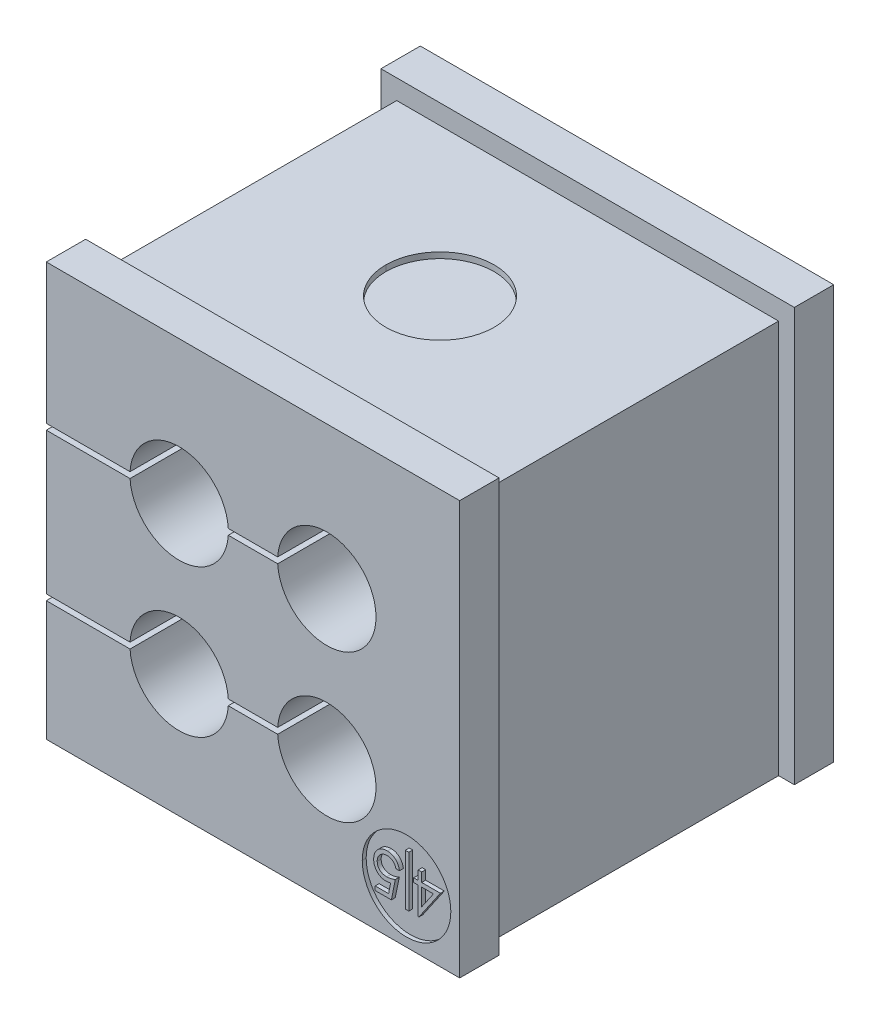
ISO-10303-21;
HEADER;
FILE_DESCRIPTION(('STEP AP214'),'2;1');
FILE_NAME('part.step','',(''),(''),'','','');
FILE_SCHEMA(('AUTOMOTIVE_DESIGN { 1 0 10303 214 1 1 1 1 }'));
ENDSEC;
DATA;
#1=APPLICATION_CONTEXT('core data for automotive mechanical design processes');
#2=APPLICATION_PROTOCOL_DEFINITION('international standard','automotive_design',2000,#1);
#3=PRODUCT_CONTEXT('',#1,'mechanical');
#4=PRODUCT('Part','Part','',(#3));
#5=PRODUCT_RELATED_PRODUCT_CATEGORY('part','',(#4));
#6=PRODUCT_DEFINITION_FORMATION('','',#4);
#7=PRODUCT_DEFINITION_CONTEXT('part definition',#1,'design');
#8=PRODUCT_DEFINITION('design','',#6,#7);
#9=PRODUCT_DEFINITION_SHAPE('','',#8);
#10=(LENGTH_UNIT() NAMED_UNIT(*) SI_UNIT(.MILLI.,.METRE.));
#11=(NAMED_UNIT(*) PLANE_ANGLE_UNIT() SI_UNIT($,.RADIAN.));
#12=(NAMED_UNIT(*) SI_UNIT($,.STERADIAN.) SOLID_ANGLE_UNIT());
#13=UNCERTAINTY_MEASURE_WITH_UNIT(LENGTH_MEASURE(1.E-05),#10,'distance_accuracy_value','');
#14=(GEOMETRIC_REPRESENTATION_CONTEXT(3) GLOBAL_UNCERTAINTY_ASSIGNED_CONTEXT((#13)) GLOBAL_UNIT_ASSIGNED_CONTEXT((#10,
#11,#12)) REPRESENTATION_CONTEXT('',''));
#15=CARTESIAN_POINT('',(0.,0.,0.));
#16=DIRECTION('',(0.,0.,1.));
#17=DIRECTION('',(1.,0.,0.));
#18=AXIS2_PLACEMENT_3D('',#15,#16,#17);
#19=CARTESIAN_POINT('',(0.,-4.1,-9.5));
#20=DIRECTION('',(0.,1.,0.));
#21=DIRECTION('',(1.,0.,0.));
#22=AXIS2_PLACEMENT_3D('',#19,#20,#21);
#23=PLANE('',#22);
#24=DIRECTION('',(0.,0.,1.));
#25=VECTOR('',#24,1.);
#26=CARTESIAN_POINT('',(0.,-4.1,-9.5));
#27=LINE('',#26,#25);
#28=CARTESIAN_POINT('',(0.,-4.1,-9.5));
#29=VERTEX_POINT('',#28);
#30=CARTESIAN_POINT('',(0.,-4.1,-7.5));
#31=VERTEX_POINT('',#30);
#32=EDGE_CURVE('E845',#29,#31,#27,.T.);
#33=ORIENTED_EDGE('',*,*,#32,.F.);
#34=DIRECTION('',(-1.,0.,0.));
#35=VECTOR('',#34,1.);
#36=CARTESIAN_POINT('',(0.,-4.1,-9.5));
#37=LINE('',#36,#35);
#38=CARTESIAN_POINT('',(4.25450405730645,-4.1,-9.5));
#39=VERTEX_POINT('',#38);
#40=EDGE_CURVE('E1200',#39,#29,#37,.T.);
#41=ORIENTED_EDGE('',*,*,#40,.F.);
#42=DIRECTION('',(0.,0.,-1.));
#43=VECTOR('',#42,1.);
#44=CARTESIAN_POINT('',(4.25450405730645,-4.1,-16.5710678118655));
#45=LINE('',#44,#43);
#46=CARTESIAN_POINT('',(4.25450405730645,-4.1,9.5));
#47=VERTEX_POINT('',#46);
#48=EDGE_CURVE('E718',#47,#39,#45,.T.);
#49=ORIENTED_EDGE('',*,*,#48,.F.);
#50=DIRECTION('',(-1.,0.,0.));
#51=VECTOR('',#50,1.);
#52=CARTESIAN_POINT('',(0.,-4.1,9.5));
#53=LINE('',#52,#51);
#54=CARTESIAN_POINT('',(0.,-4.1,9.5));
#55=VERTEX_POINT('',#54);
#56=EDGE_CURVE('E748',#47,#55,#53,.T.);
#57=ORIENTED_EDGE('',*,*,#56,.T.);
#58=DIRECTION('',(0.,0.,1.));
#59=VECTOR('',#58,1.);
#60=CARTESIAN_POINT('',(0.,-4.1,-9.5));
#61=LINE('',#60,#59);
#62=CARTESIAN_POINT('',(0.,-4.1,7.5));
#63=VERTEX_POINT('',#62);
#64=EDGE_CURVE('E808',#63,#55,#61,.T.);
#65=ORIENTED_EDGE('',*,*,#64,.F.);
#66=DIRECTION('',(-1.,0.,0.));
#67=VECTOR('',#66,1.);
#68=CARTESIAN_POINT('',(1.3,-4.1,7.5));
#69=LINE('',#68,#67);
#70=CARTESIAN_POINT('',(0.8,-4.1,7.5));
#71=VERTEX_POINT('',#70);
#72=EDGE_CURVE('E686',#71,#63,#69,.T.);
#73=ORIENTED_EDGE('',*,*,#72,.F.);
#74=DIRECTION('',(0.,0.,1.));
#75=VECTOR('',#74,1.);
#76=CARTESIAN_POINT('',(0.8,-4.1,1.75));
#77=LINE('',#76,#75);
#78=CARTESIAN_POINT('',(0.8,-4.1,-7.5));
#79=VERTEX_POINT('',#78);
#80=EDGE_CURVE('E873',#79,#71,#77,.T.);
#81=ORIENTED_EDGE('',*,*,#80,.F.);
#82=DIRECTION('',(1.,0.,0.));
#83=VECTOR('',#82,1.);
#84=CARTESIAN_POINT('',(0.,-4.1,-7.5));
#85=LINE('',#84,#83);
#86=EDGE_CURVE('E885',#31,#79,#85,.T.);
#87=ORIENTED_EDGE('',*,*,#86,.F.);
#88=EDGE_LOOP('',(#33,#41,#49,#57,#65,#73,#81,#87));
#89=FACE_BOUND('',#88,.T.);
#90=ADVANCED_FACE('F15',(#89),#23,.F.);
#91=CARTESIAN_POINT('',(0.,-4.4,-9.5));
#92=DIRECTION('',(0.,-1.,0.));
#93=DIRECTION('',(0.,0.,-1.));
#94=AXIS2_PLACEMENT_3D('',#91,#92,#93);
#95=PLANE('',#94);
#96=DIRECTION('',(0.,0.,-1.));
#97=VECTOR('',#96,1.);
#98=CARTESIAN_POINT('',(0.8,-4.4,1.75));
#99=LINE('',#98,#97);
#100=CARTESIAN_POINT('',(0.8,-4.4,7.5));
#101=VERTEX_POINT('',#100);
#102=CARTESIAN_POINT('',(0.8,-4.4,-7.5));
#103=VERTEX_POINT('',#102);
#104=EDGE_CURVE('E719',#101,#103,#99,.T.);
#105=ORIENTED_EDGE('',*,*,#104,.F.);
#106=DIRECTION('',(1.,0.,0.));
#107=VECTOR('',#106,1.);
#108=CARTESIAN_POINT('',(1.3,-4.4,7.5));
#109=LINE('',#108,#107);
#110=CARTESIAN_POINT('',(0.,-4.4,7.5));
#111=VERTEX_POINT('',#110);
#112=EDGE_CURVE('E1235',#111,#101,#109,.T.);
#113=ORIENTED_EDGE('',*,*,#112,.F.);
#114=DIRECTION('',(0.,0.,1.));
#115=VECTOR('',#114,1.);
#116=CARTESIAN_POINT('',(0.,-4.4,-9.5));
#117=LINE('',#116,#115);
#118=CARTESIAN_POINT('',(0.,-4.4,9.5));
#119=VERTEX_POINT('',#118);
#120=EDGE_CURVE('E814',#111,#119,#117,.T.);
#121=ORIENTED_EDGE('',*,*,#120,.T.);
#122=DIRECTION('',(1.,0.,0.));
#123=VECTOR('',#122,1.);
#124=CARTESIAN_POINT('',(0.,-4.4,9.5));
#125=LINE('',#124,#123);
#126=CARTESIAN_POINT('',(4.25450405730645,-4.4,9.5));
#127=VERTEX_POINT('',#126);
#128=EDGE_CURVE('E676',#119,#127,#125,.T.);
#129=ORIENTED_EDGE('',*,*,#128,.T.);
#130=DIRECTION('',(0.,0.,1.));
#131=VECTOR('',#130,1.);
#132=CARTESIAN_POINT('',(4.25450405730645,-4.4,-16.5710678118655));
#133=LINE('',#132,#131);
#134=CARTESIAN_POINT('',(4.25450405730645,-4.4,-9.5));
#135=VERTEX_POINT('',#134);
#136=EDGE_CURVE('E765',#135,#127,#133,.T.);
#137=ORIENTED_EDGE('',*,*,#136,.F.);
#138=DIRECTION('',(1.,0.,0.));
#139=VECTOR('',#138,1.);
#140=CARTESIAN_POINT('',(0.,-4.4,-9.5));
#141=LINE('',#140,#139);
#142=CARTESIAN_POINT('',(0.,-4.4,-9.5));
#143=VERTEX_POINT('',#142);
#144=EDGE_CURVE('E1224',#143,#135,#141,.T.);
#145=ORIENTED_EDGE('',*,*,#144,.F.);
#146=DIRECTION('',(0.,0.,1.));
#147=VECTOR('',#146,1.);
#148=CARTESIAN_POINT('',(0.,-4.4,-9.5));
#149=LINE('',#148,#147);
#150=CARTESIAN_POINT('',(0.,-4.4,-7.5));
#151=VERTEX_POINT('',#150);
#152=EDGE_CURVE('E910',#143,#151,#149,.T.);
#153=ORIENTED_EDGE('',*,*,#152,.T.);
#154=DIRECTION('',(-1.,0.,0.));
#155=VECTOR('',#154,1.);
#156=CARTESIAN_POINT('',(0.,-4.4,-7.5));
#157=LINE('',#156,#155);
#158=EDGE_CURVE('E1025',#103,#151,#157,.T.);
#159=ORIENTED_EDGE('',*,*,#158,.F.);
#160=EDGE_LOOP('',(#105,#113,#121,#129,#137,#145,#153,#159));
#161=FACE_BOUND('',#160,.T.);
#162=ADVANCED_FACE('F1503',(#161),#95,.F.);
#163=CARTESIAN_POINT('',(0.,-4.1,-9.5));
#164=DIRECTION('',(0.,1.,0.));
#165=DIRECTION('',(1.,0.,0.));
#166=AXIS2_PLACEMENT_3D('',#163,#164,#165);
#167=PLANE('',#166);
#168=DIRECTION('',(-1.,0.,0.));
#169=VECTOR('',#168,1.);
#170=CARTESIAN_POINT('',(0.,-4.1,-9.5));
#171=LINE('',#170,#169);
#172=CARTESIAN_POINT('',(11.7545040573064,-4.1,-9.5));
#173=VERTEX_POINT('',#172);
#174=CARTESIAN_POINT('',(9.24549594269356,-4.1,-9.5));
#175=VERTEX_POINT('',#174);
#176=EDGE_CURVE('E630',#173,#175,#171,.T.);
#177=ORIENTED_EDGE('',*,*,#176,.F.);
#178=DIRECTION('',(0.,0.,-1.));
#179=VECTOR('',#178,1.);
#180=CARTESIAN_POINT('',(11.7545040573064,-4.1,-16.5710678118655));
#181=LINE('',#180,#179);
#182=CARTESIAN_POINT('',(11.7545040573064,-4.1,9.5));
#183=VERTEX_POINT('',#182);
#184=EDGE_CURVE('E646',#183,#173,#181,.T.);
#185=ORIENTED_EDGE('',*,*,#184,.F.);
#186=DIRECTION('',(-1.,0.,0.));
#187=VECTOR('',#186,1.);
#188=CARTESIAN_POINT('',(0.,-4.1,9.5));
#189=LINE('',#188,#187);
#190=CARTESIAN_POINT('',(9.24549594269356,-4.1,9.5));
#191=VERTEX_POINT('',#190);
#192=EDGE_CURVE('E745',#183,#191,#189,.T.);
#193=ORIENTED_EDGE('',*,*,#192,.T.);
#194=DIRECTION('',(0.,0.,1.));
#195=VECTOR('',#194,1.);
#196=CARTESIAN_POINT('',(9.24549594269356,-4.1,-16.5710678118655));
#197=LINE('',#196,#195);
#198=EDGE_CURVE('E717',#175,#191,#197,.T.);
#199=ORIENTED_EDGE('',*,*,#198,.F.);
#200=EDGE_LOOP('',(#177,#185,#193,#199));
#201=FACE_BOUND('',#200,.T.);
#202=ADVANCED_FACE('F1676',(#201),#167,.F.);
#203=CARTESIAN_POINT('',(0.,-4.4,-9.5));
#204=DIRECTION('',(0.,-1.,0.));
#205=DIRECTION('',(0.,0.,-1.));
#206=AXIS2_PLACEMENT_3D('',#203,#204,#205);
#207=PLANE('',#206);
#208=DIRECTION('',(1.,0.,0.));
#209=VECTOR('',#208,1.);
#210=CARTESIAN_POINT('',(0.,-4.4,9.5));
#211=LINE('',#210,#209);
#212=CARTESIAN_POINT('',(9.24549594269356,-4.4,9.5));
#213=VERTEX_POINT('',#212);
#214=CARTESIAN_POINT('',(11.7545040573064,-4.4,9.5));
#215=VERTEX_POINT('',#214);
#216=EDGE_CURVE('E791',#213,#215,#211,.T.);
#217=ORIENTED_EDGE('',*,*,#216,.T.);
#218=DIRECTION('',(0.,0.,1.));
#219=VECTOR('',#218,1.);
#220=CARTESIAN_POINT('',(11.7545040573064,-4.4,-16.5710678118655));
#221=LINE('',#220,#219);
#222=CARTESIAN_POINT('',(11.7545040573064,-4.4,-9.5));
#223=VERTEX_POINT('',#222);
#224=EDGE_CURVE('E768',#223,#215,#221,.T.);
#225=ORIENTED_EDGE('',*,*,#224,.F.);
#226=DIRECTION('',(1.,0.,0.));
#227=VECTOR('',#226,1.);
#228=CARTESIAN_POINT('',(0.,-4.4,-9.5));
#229=LINE('',#228,#227);
#230=CARTESIAN_POINT('',(9.24549594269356,-4.4,-9.5));
#231=VERTEX_POINT('',#230);
#232=EDGE_CURVE('E627',#231,#223,#229,.T.);
#233=ORIENTED_EDGE('',*,*,#232,.F.);
#234=DIRECTION('',(0.,0.,-1.));
#235=VECTOR('',#234,1.);
#236=CARTESIAN_POINT('',(9.24549594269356,-4.4,-16.5710678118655));
#237=LINE('',#236,#235);
#238=EDGE_CURVE('E769',#213,#231,#237,.T.);
#239=ORIENTED_EDGE('',*,*,#238,.F.);
#240=EDGE_LOOP('',(#217,#225,#233,#239));
#241=FACE_BOUND('',#240,.T.);
#242=ADVANCED_FACE('F1701',(#241),#207,.F.);
#243=CARTESIAN_POINT('',(0.,3.4,-9.5));
#244=DIRECTION('',(0.,1.,0.));
#245=DIRECTION('',(1.,0.,0.));
#246=AXIS2_PLACEMENT_3D('',#243,#244,#245);
#247=PLANE('',#246);
#248=DIRECTION('',(0.,0.,1.));
#249=VECTOR('',#248,1.);
#250=CARTESIAN_POINT('',(0.,3.4,-9.5));
#251=LINE('',#250,#249);
#252=CARTESIAN_POINT('',(0.,3.4,-9.5));
#253=VERTEX_POINT('',#252);
#254=CARTESIAN_POINT('',(0.,3.4,-7.5));
#255=VERTEX_POINT('',#254);
#256=EDGE_CURVE('E738',#253,#255,#251,.T.);
#257=ORIENTED_EDGE('',*,*,#256,.F.);
#258=DIRECTION('',(-1.,0.,0.));
#259=VECTOR('',#258,1.);
#260=CARTESIAN_POINT('',(0.,3.4,-9.5));
#261=LINE('',#260,#259);
#262=CARTESIAN_POINT('',(4.25450405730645,3.4,-9.5));
#263=VERTEX_POINT('',#262);
#264=EDGE_CURVE('E1221',#263,#253,#261,.T.);
#265=ORIENTED_EDGE('',*,*,#264,.F.);
#266=DIRECTION('',(0.,0.,-1.));
#267=VECTOR('',#266,1.);
#268=CARTESIAN_POINT('',(4.25450405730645,3.4,-16.5710678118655));
#269=LINE('',#268,#267);
#270=CARTESIAN_POINT('',(4.25450405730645,3.4,9.5));
#271=VERTEX_POINT('',#270);
#272=EDGE_CURVE('E1029',#271,#263,#269,.T.);
#273=ORIENTED_EDGE('',*,*,#272,.F.);
#274=DIRECTION('',(-1.,0.,0.));
#275=VECTOR('',#274,1.);
#276=CARTESIAN_POINT('',(0.,3.4,9.5));
#277=LINE('',#276,#275);
#278=CARTESIAN_POINT('',(0.,3.4,9.5));
#279=VERTEX_POINT('',#278);
#280=EDGE_CURVE('E672',#271,#279,#277,.T.);
#281=ORIENTED_EDGE('',*,*,#280,.T.);
#282=DIRECTION('',(0.,0.,1.));
#283=VECTOR('',#282,1.);
#284=CARTESIAN_POINT('',(0.,3.4,-9.5));
#285=LINE('',#284,#283);
#286=CARTESIAN_POINT('',(0.,3.4,7.5));
#287=VERTEX_POINT('',#286);
#288=EDGE_CURVE('E665',#287,#279,#285,.T.);
#289=ORIENTED_EDGE('',*,*,#288,.F.);
#290=DIRECTION('',(-1.,0.,0.));
#291=VECTOR('',#290,1.);
#292=CARTESIAN_POINT('',(1.3,3.4,7.5));
#293=LINE('',#292,#291);
#294=CARTESIAN_POINT('',(0.8,3.4,7.5));
#295=VERTEX_POINT('',#294);
#296=EDGE_CURVE('E770',#295,#287,#293,.T.);
#297=ORIENTED_EDGE('',*,*,#296,.F.);
#298=DIRECTION('',(0.,0.,1.));
#299=VECTOR('',#298,1.);
#300=CARTESIAN_POINT('',(0.8,3.4,1.75));
#301=LINE('',#300,#299);
#302=CARTESIAN_POINT('',(0.8,3.4,-7.5));
#303=VERTEX_POINT('',#302);
#304=EDGE_CURVE('E948',#303,#295,#301,.T.);
#305=ORIENTED_EDGE('',*,*,#304,.F.);
#306=DIRECTION('',(1.,0.,0.));
#307=VECTOR('',#306,1.);
#308=CARTESIAN_POINT('',(0.,3.4,-7.5));
#309=LINE('',#308,#307);
#310=EDGE_CURVE('E987',#255,#303,#309,.T.);
#311=ORIENTED_EDGE('',*,*,#310,.F.);
#312=EDGE_LOOP('',(#257,#265,#273,#281,#289,#297,#305,#311));
#313=FACE_BOUND('',#312,.T.);
#314=ADVANCED_FACE('F17',(#313),#247,.F.);
#315=CARTESIAN_POINT('',(0.,3.1,-9.5));
#316=DIRECTION('',(0.,-1.,0.));
#317=DIRECTION('',(0.,0.,-1.));
#318=AXIS2_PLACEMENT_3D('',#315,#316,#317);
#319=PLANE('',#318);
#320=DIRECTION('',(0.,0.,-1.));
#321=VECTOR('',#320,1.);
#322=CARTESIAN_POINT('',(0.8,3.1,1.75));
#323=LINE('',#322,#321);
#324=CARTESIAN_POINT('',(0.8,3.1,7.5));
#325=VERTEX_POINT('',#324);
#326=CARTESIAN_POINT('',(0.8,3.1,-7.5));
#327=VERTEX_POINT('',#326);
#328=EDGE_CURVE('E881',#325,#327,#323,.T.);
#329=ORIENTED_EDGE('',*,*,#328,.F.);
#330=DIRECTION('',(1.,0.,0.));
#331=VECTOR('',#330,1.);
#332=CARTESIAN_POINT('',(1.3,3.1,7.5));
#333=LINE('',#332,#331);
#334=CARTESIAN_POINT('',(0.,3.1,7.5));
#335=VERTEX_POINT('',#334);
#336=EDGE_CURVE('E682',#335,#325,#333,.T.);
#337=ORIENTED_EDGE('',*,*,#336,.F.);
#338=DIRECTION('',(0.,0.,1.));
#339=VECTOR('',#338,1.);
#340=CARTESIAN_POINT('',(0.,3.1,-9.5));
#341=LINE('',#340,#339);
#342=CARTESIAN_POINT('',(0.,3.1,9.5));
#343=VERTEX_POINT('',#342);
#344=EDGE_CURVE('E831',#335,#343,#341,.T.);
#345=ORIENTED_EDGE('',*,*,#344,.T.);
#346=DIRECTION('',(1.,0.,0.));
#347=VECTOR('',#346,1.);
#348=CARTESIAN_POINT('',(0.,3.1,9.5));
#349=LINE('',#348,#347);
#350=CARTESIAN_POINT('',(4.25450405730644,3.1,9.5));
#351=VERTEX_POINT('',#350);
#352=EDGE_CURVE('E1193',#343,#351,#349,.T.);
#353=ORIENTED_EDGE('',*,*,#352,.T.);
#354=DIRECTION('',(0.,0.,1.));
#355=VECTOR('',#354,1.);
#356=CARTESIAN_POINT('',(4.25450405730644,3.1,-16.5710678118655));
#357=LINE('',#356,#355);
#358=CARTESIAN_POINT('',(4.25450405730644,3.1,-9.5));
#359=VERTEX_POINT('',#358);
#360=EDGE_CURVE('E1244',#359,#351,#357,.T.);
#361=ORIENTED_EDGE('',*,*,#360,.F.);
#362=DIRECTION('',(1.,0.,0.));
#363=VECTOR('',#362,1.);
#364=CARTESIAN_POINT('',(0.,3.1,-9.5));
#365=LINE('',#364,#363);
#366=CARTESIAN_POINT('',(0.,3.1,-9.5));
#367=VERTEX_POINT('',#366);
#368=EDGE_CURVE('E1203',#367,#359,#365,.T.);
#369=ORIENTED_EDGE('',*,*,#368,.F.);
#370=DIRECTION('',(0.,0.,1.));
#371=VECTOR('',#370,1.);
#372=CARTESIAN_POINT('',(0.,3.1,-9.5));
#373=LINE('',#372,#371);
#374=CARTESIAN_POINT('',(0.,3.1,-7.5));
#375=VERTEX_POINT('',#374);
#376=EDGE_CURVE('E859',#367,#375,#373,.T.);
#377=ORIENTED_EDGE('',*,*,#376,.T.);
#378=DIRECTION('',(-1.,0.,0.));
#379=VECTOR('',#378,1.);
#380=CARTESIAN_POINT('',(0.,3.1,-7.5));
#381=LINE('',#380,#379);
#382=EDGE_CURVE('E894',#327,#375,#381,.T.);
#383=ORIENTED_EDGE('',*,*,#382,.F.);
#384=EDGE_LOOP('',(#329,#337,#345,#353,#361,#369,#377,#383));
#385=FACE_BOUND('',#384,.T.);
#386=ADVANCED_FACE('F2277',(#385),#319,.F.);
#387=CARTESIAN_POINT('',(0.,3.4,-9.5));
#388=DIRECTION('',(0.,1.,0.));
#389=DIRECTION('',(1.,0.,0.));
#390=AXIS2_PLACEMENT_3D('',#387,#388,#389);
#391=PLANE('',#390);
#392=DIRECTION('',(-1.,0.,0.));
#393=VECTOR('',#392,1.);
#394=CARTESIAN_POINT('',(0.,3.4,-9.5));
#395=LINE('',#394,#393);
#396=CARTESIAN_POINT('',(11.7545040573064,3.4,-9.5));
#397=VERTEX_POINT('',#396);
#398=CARTESIAN_POINT('',(9.24549594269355,3.4,-9.5));
#399=VERTEX_POINT('',#398);
#400=EDGE_CURVE('E1218',#397,#399,#395,.T.);
#401=ORIENTED_EDGE('',*,*,#400,.F.);
#402=DIRECTION('',(0.,0.,-1.));
#403=VECTOR('',#402,1.);
#404=CARTESIAN_POINT('',(11.7545040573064,3.4,-16.5710678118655));
#405=LINE('',#404,#403);
#406=CARTESIAN_POINT('',(11.7545040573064,3.4,9.5));
#407=VERTEX_POINT('',#406);
#408=EDGE_CURVE('E756',#407,#397,#405,.T.);
#409=ORIENTED_EDGE('',*,*,#408,.F.);
#410=DIRECTION('',(-1.,0.,0.));
#411=VECTOR('',#410,1.);
#412=CARTESIAN_POINT('',(0.,3.4,9.5));
#413=LINE('',#412,#411);
#414=CARTESIAN_POINT('',(9.24549594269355,3.4,9.5));
#415=VERTEX_POINT('',#414);
#416=EDGE_CURVE('E675',#407,#415,#413,.T.);
#417=ORIENTED_EDGE('',*,*,#416,.T.);
#418=DIRECTION('',(0.,0.,1.));
#419=VECTOR('',#418,1.);
#420=CARTESIAN_POINT('',(9.24549594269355,3.4,-16.5710678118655));
#421=LINE('',#420,#419);
#422=EDGE_CURVE('E703',#399,#415,#421,.T.);
#423=ORIENTED_EDGE('',*,*,#422,.F.);
#424=EDGE_LOOP('',(#401,#409,#417,#423));
#425=FACE_BOUND('',#424,.T.);
#426=ADVANCED_FACE('F2227',(#425),#391,.F.);
#427=CARTESIAN_POINT('',(0.,3.1,-9.5));
#428=DIRECTION('',(0.,-1.,0.));
#429=DIRECTION('',(0.,0.,-1.));
#430=AXIS2_PLACEMENT_3D('',#427,#428,#429);
#431=PLANE('',#430);
#432=DIRECTION('',(1.,0.,0.));
#433=VECTOR('',#432,1.);
#434=CARTESIAN_POINT('',(0.,3.1,9.5));
#435=LINE('',#434,#433);
#436=CARTESIAN_POINT('',(9.24549594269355,3.1,9.5));
#437=VERTEX_POINT('',#436);
#438=CARTESIAN_POINT('',(11.7545040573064,3.1,9.5));
#439=VERTEX_POINT('',#438);
#440=EDGE_CURVE('E1185',#437,#439,#435,.T.);
#441=ORIENTED_EDGE('',*,*,#440,.T.);
#442=DIRECTION('',(0.,0.,1.));
#443=VECTOR('',#442,1.);
#444=CARTESIAN_POINT('',(11.7545040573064,3.1,-16.5710678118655));
#445=LINE('',#444,#443);
#446=CARTESIAN_POINT('',(11.7545040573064,3.1,-9.5));
#447=VERTEX_POINT('',#446);
#448=EDGE_CURVE('E1247',#447,#439,#445,.T.);
#449=ORIENTED_EDGE('',*,*,#448,.F.);
#450=DIRECTION('',(1.,0.,0.));
#451=VECTOR('',#450,1.);
#452=CARTESIAN_POINT('',(0.,3.1,-9.5));
#453=LINE('',#452,#451);
#454=CARTESIAN_POINT('',(9.24549594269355,3.1,-9.5));
#455=VERTEX_POINT('',#454);
#456=EDGE_CURVE('E1211',#455,#447,#453,.T.);
#457=ORIENTED_EDGE('',*,*,#456,.F.);
#458=DIRECTION('',(0.,0.,-1.));
#459=VECTOR('',#458,1.);
#460=CARTESIAN_POINT('',(9.24549594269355,3.1,-16.5710678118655));
#461=LINE('',#460,#459);
#462=EDGE_CURVE('E1241',#437,#455,#461,.T.);
#463=ORIENTED_EDGE('',*,*,#462,.F.);
#464=EDGE_LOOP('',(#441,#449,#457,#463));
#465=FACE_BOUND('',#464,.T.);
#466=ADVANCED_FACE('F2209',(#465),#431,.F.);
#467=CARTESIAN_POINT('',(17.3793233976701,-8.09673126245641,9.5));
#468=DIRECTION('',(-1.15643719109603E-13,4.18882235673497E-13,1.));
#469=DIRECTION('',(0.,-1.,4.18882235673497E-13));
#470=AXIS2_PLACEMENT_3D('',#467,#468,#469);
#471=PLANE('',#470);
#472=DIRECTION('',(-1.,0.,0.));
#473=VECTOR('',#472,1.);
#474=CARTESIAN_POINT('',(17.5282051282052,-8.8,9.5));
#475=LINE('',#474,#473);
#476=CARTESIAN_POINT('',(17.5282051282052,-8.8,9.5));
#477=VERTEX_POINT('',#476);
#478=CARTESIAN_POINT('',(16.7076923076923,-8.8,9.5));
#479=VERTEX_POINT('',#478);
#480=EDGE_CURVE('E1377',#477,#479,#475,.T.);
#481=ORIENTED_EDGE('',*,*,#480,.F.);
#482=DIRECTION('',(-0.200944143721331,-0.97960270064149,0.));
#483=VECTOR('',#482,1.);
#484=CARTESIAN_POINT('',(17.7333333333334,-7.8,9.5));
#485=LINE('',#484,#483);
#486=CARTESIAN_POINT('',(17.7333333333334,-7.8,9.5));
#487=VERTEX_POINT('',#486);
#488=EDGE_CURVE('E1387',#487,#477,#485,.T.);
#489=ORIENTED_EDGE('',*,*,#488,.F.);
#490=CARTESIAN_POINT('',(17.2926282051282,-7.9025641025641,9.5));
#491=CARTESIAN_POINT('',(17.3082650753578,-7.90224360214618,9.5));
#492=CARTESIAN_POINT('',(17.3402761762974,-7.90158748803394,9.5));
#493=CARTESIAN_POINT('',(17.3894931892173,-7.89642400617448,9.5));
#494=CARTESIAN_POINT('',(17.4409878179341,-7.88848048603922,9.5));
#495=CARTESIAN_POINT('',(17.4949599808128,-7.87703133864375,9.5));
#496=CARTESIAN_POINT('',(17.5512615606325,-7.86269621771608,9.5));
#497=CARTESIAN_POINT('',(17.6099861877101,-7.84479344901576,9.5));
#498=CARTESIAN_POINT('',(17.6711352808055,-7.82417171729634,9.5));
#499=CARTESIAN_POINT('',(17.7122929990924,-7.80817679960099,9.5));
#500=CARTESIAN_POINT('',(17.7333333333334,-7.8,9.5));
#501=(BOUNDED_CURVE() B_SPLINE_CURVE(3,(#490,#491,#492,#493,#494,#495,#496,#497,#498,#499,#500),
.UNSPECIFIED.,.F.,.F.) B_SPLINE_CURVE_WITH_KNOTS((4,1,1,1,1,1,1,1,4),(0.,0.103079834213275,
0.211020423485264,0.325963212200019,0.446499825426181,0.574634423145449,0.708899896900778,
0.851186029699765,1.),
.UNSPECIFIED.) CURVE() GEOMETRIC_REPRESENTATION_ITEM() RATIONAL_B_SPLINE_CURVE((1.,1.,1.,1.,1.,
1.,1.,1.,1.,1.,1.)) REPRESENTATION_ITEM(''));
#502=CARTESIAN_POINT('',(17.2926282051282,-7.9025641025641,9.5));
#503=VERTEX_POINT('',#502);
#504=EDGE_CURVE('E1393',#503,#487,#501,.T.);
#505=ORIENTED_EDGE('',*,*,#504,.F.);
#506=CARTESIAN_POINT('',(16.8102564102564,-7.46105769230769,9.5));
#507=CARTESIAN_POINT('',(16.8105603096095,-7.47711260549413,9.5));
#508=CARTESIAN_POINT('',(16.8111529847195,-7.50842345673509,9.5));
#509=CARTESIAN_POINT('',(16.8181621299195,-7.55418974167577,9.5));
#510=CARTESIAN_POINT('',(16.8276028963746,-7.59787618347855,9.5));
#511=CARTESIAN_POINT('',(16.8424926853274,-7.63907460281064,9.5));
#512=CARTESIAN_POINT('',(16.8605784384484,-7.67821511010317,9.5));
#513=CARTESIAN_POINT('',(16.8841434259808,-7.71433058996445,9.5));
#514=CARTESIAN_POINT('',(16.9101960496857,-7.74918694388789,9.5));
#515=CARTESIAN_POINT('',(16.941395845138,-7.78047975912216,9.5));
#516=CARTESIAN_POINT('',(16.9751780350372,-7.8096029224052,9.5));
#517=CARTESIAN_POINT('',(17.0126148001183,-7.83430346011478,9.5));
#518=CARTESIAN_POINT('',(17.0526362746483,-7.85531901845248,9.5));
#519=CARTESIAN_POINT('',(17.0953357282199,-7.87253498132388,9.5));
#520=CARTESIAN_POINT('',(17.1407605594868,-7.88624951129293,9.5));
#521=CARTESIAN_POINT('',(17.1889366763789,-7.89572763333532,9.5));
#522=CARTESIAN_POINT('',(17.2398746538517,-7.90139924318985,9.5));
#523=CARTESIAN_POINT('',(17.2747178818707,-7.90216862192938,9.5));
#524=CARTESIAN_POINT('',(17.2926282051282,-7.9025641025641,9.5));
#525=(BOUNDED_CURVE() B_SPLINE_CURVE(3,(#506,#507,#508,#509,#510,#511,#512,#513,#514,#515,#516,
#517,#518,#519,#520,#521,#522,#523,#524),.UNSPECIFIED.,.F.,.F.) B_SPLINE_CURVE_WITH_KNOTS((4,1,
1,1,1,1,1,1,1,1,1,1,1,1,1,1,4),(0.,0.0653638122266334,0.127474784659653,0.188335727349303,
0.247202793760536,0.305627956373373,0.363605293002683,0.422603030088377,0.48264082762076,
0.543265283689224,0.604094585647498,0.664953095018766,0.727206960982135,0.791427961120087,
0.85802844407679,0.927022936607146,1.),
.UNSPECIFIED.) CURVE() GEOMETRIC_REPRESENTATION_ITEM() RATIONAL_B_SPLINE_CURVE((1.,1.,1.,1.,1.,
1.,1.,1.,1.,1.,1.,1.,1.,1.,1.,1.,1.,1.,1.)) REPRESENTATION_ITEM(''));
#526=CARTESIAN_POINT('',(16.8102564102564,-7.46105769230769,9.5));
#527=VERTEX_POINT('',#526);
#528=EDGE_CURVE('E1404',#527,#503,#525,.T.);
#529=ORIENTED_EDGE('',*,*,#528,.F.);
#530=CARTESIAN_POINT('',(17.3178685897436,-6.95384615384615,9.5));
#531=CARTESIAN_POINT('',(17.3007509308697,-6.95431909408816,9.5));
#532=CARTESIAN_POINT('',(17.2670461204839,-6.95525031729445,9.5));
#533=CARTESIAN_POINT('',(17.2174187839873,-6.96230203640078,9.5));
#534=CARTESIAN_POINT('',(17.1696454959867,-6.9734477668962,9.5));
#535=CARTESIAN_POINT('',(17.1236414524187,-6.98906229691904,9.5));
#536=CARTESIAN_POINT('',(17.0796327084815,-7.00971940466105,9.5));
#537=CARTESIAN_POINT('',(17.0376814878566,-7.03509547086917,9.5));
#538=CARTESIAN_POINT('',(16.9971901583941,-7.06455738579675,9.5));
#539=CARTESIAN_POINT('',(16.9592243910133,-7.09823127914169,9.5));
#540=CARTESIAN_POINT('',(16.9244608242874,-7.13536100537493,9.5));
#541=CARTESIAN_POINT('',(16.8937425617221,-7.17506127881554,9.5));
#542=CARTESIAN_POINT('',(16.8681558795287,-7.21741404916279,9.5));
#543=CARTESIAN_POINT('',(16.8465934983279,-7.26168434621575,9.5));
#544=CARTESIAN_POINT('',(16.8302201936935,-7.30835782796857,9.5));
#545=CARTESIAN_POINT('',(16.8185396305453,-7.3572156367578,9.5));
#546=CARTESIAN_POINT('',(16.8116807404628,-7.40837848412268,9.5));
#547=CARTESIAN_POINT('',(16.8107372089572,-7.4432752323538,9.5));
#548=CARTESIAN_POINT('',(16.8102564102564,-7.46105769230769,9.5));
#549=(BOUNDED_CURVE() B_SPLINE_CURVE(3,(#530,#531,#532,#533,#534,#535,#536,#537,#538,#539,#540,
#541,#542,#543,#544,#545,#546,#547,#548),.UNSPECIFIED.,.F.,.F.) B_SPLINE_CURVE_WITH_KNOTS((4,1,
1,1,1,1,1,1,1,1,1,1,1,1,1,1,4),(0.,0.0642043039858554,0.12641879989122,0.187671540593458,
0.248040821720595,0.308337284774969,0.369690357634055,0.431725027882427,0.495970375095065,
0.559778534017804,0.622313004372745,0.683925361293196,0.745104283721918,0.806749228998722,
0.86909271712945,0.933293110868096,1.),
.UNSPECIFIED.) CURVE() GEOMETRIC_REPRESENTATION_ITEM() RATIONAL_B_SPLINE_CURVE((1.,1.,1.,1.,1.,
1.,1.,1.,1.,1.,1.,1.,1.,1.,1.,1.,1.,1.,1.)) REPRESENTATION_ITEM(''));
#550=CARTESIAN_POINT('',(17.3178685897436,-6.95384615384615,9.5));
#551=VERTEX_POINT('',#550);
#552=EDGE_CURVE('E1415',#551,#527,#549,.T.);
#553=ORIENTED_EDGE('',*,*,#552,.F.);
#554=CARTESIAN_POINT('',(17.7589743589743,-7.31282051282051,9.5));
#555=CARTESIAN_POINT('',(17.7545635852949,-7.29374442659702,9.5));
#556=CARTESIAN_POINT('',(17.7460858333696,-7.25707912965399,9.5));
#557=CARTESIAN_POINT('',(17.7273801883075,-7.20562644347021,9.5));
#558=CARTESIAN_POINT('',(17.7048711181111,-7.15958520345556,9.5));
#559=CARTESIAN_POINT('',(17.6768644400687,-7.11924495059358,9.5));
#560=CARTESIAN_POINT('',(17.6450518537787,-7.08324782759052,9.5));
#561=CARTESIAN_POINT('',(17.6083349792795,-7.05123655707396,9.5));
#562=CARTESIAN_POINT('',(17.5670258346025,-7.02270508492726,9.5));
#563=CARTESIAN_POINT('',(17.5211151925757,-6.99872836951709,9.5));
#564=CARTESIAN_POINT('',(17.4725559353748,-6.97856105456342,9.5));
#565=CARTESIAN_POINT('',(17.4220300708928,-6.96416180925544,9.5));
#566=CARTESIAN_POINT('',(17.3702550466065,-6.9554473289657,9.5));
#567=CARTESIAN_POINT('',(17.3353964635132,-6.95438188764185,9.5));
#568=CARTESIAN_POINT('',(17.3178685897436,-6.95384615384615,9.5));
#569=(BOUNDED_CURVE() B_SPLINE_CURVE(3,(#554,#555,#556,#557,#558,#559,#560,#561,#562,#563,#564,
#565,#566,#567,#568),.UNSPECIFIED.,.F.,.F.) B_SPLINE_CURVE_WITH_KNOTS((4,1,1,1,1,1,1,1,1,1,1,1,
4),(0.,0.0946975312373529,0.182013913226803,0.264405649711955,0.342044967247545,
0.418973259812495,0.496386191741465,0.577254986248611,0.661405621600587,0.746636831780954,
0.831346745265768,0.915196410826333,1.),
.UNSPECIFIED.) CURVE() GEOMETRIC_REPRESENTATION_ITEM() RATIONAL_B_SPLINE_CURVE((1.,1.,1.,1.,1.,
1.,1.,1.,1.,1.,1.,1.,1.,1.,1.)) REPRESENTATION_ITEM(''));
#570=CARTESIAN_POINT('',(17.7589743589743,-7.31282051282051,9.5));
#571=VERTEX_POINT('',#570);
#572=EDGE_CURVE('E1426',#571,#551,#569,.T.);
#573=ORIENTED_EDGE('',*,*,#572,.F.);
#574=DIRECTION('',(-1.,0.,0.));
#575=VECTOR('',#574,1.);
#576=CARTESIAN_POINT('',(17.9384615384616,-7.31282051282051,9.5));
#577=LINE('',#576,#575);
#578=CARTESIAN_POINT('',(17.9384615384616,-7.31282051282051,9.5));
#579=VERTEX_POINT('',#578);
#580=EDGE_CURVE('E1437',#579,#571,#577,.T.);
#581=ORIENTED_EDGE('',*,*,#580,.F.);
#582=CARTESIAN_POINT('',(17.3282852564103,-6.74871794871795,9.5));
#583=CARTESIAN_POINT('',(17.3482128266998,-6.74911380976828,9.5));
#584=CARTESIAN_POINT('',(17.3874179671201,-6.74989261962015,9.5));
#585=CARTESIAN_POINT('',(17.4448658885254,-6.75800183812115,9.5));
#586=CARTESIAN_POINT('',(17.5001036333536,-6.76969544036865,9.5));
#587=CARTESIAN_POINT('',(17.5529021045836,-6.78701084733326,9.5));
#588=CARTESIAN_POINT('',(17.60301300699,-6.80971721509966,9.5));
#589=CARTESIAN_POINT('',(17.6511632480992,-6.83652227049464,9.5));
#590=CARTESIAN_POINT('',(17.6964714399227,-6.86887491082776,9.5));
#591=CARTESIAN_POINT('',(17.7392590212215,-6.90561530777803,9.5));
#592=CARTESIAN_POINT('',(17.7785094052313,-6.94636501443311,9.5));
#593=CARTESIAN_POINT('',(17.8146438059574,-6.98968808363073,9.5));
#594=CARTESIAN_POINT('',(17.8459316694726,-7.03654540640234,9.5));
#595=CARTESIAN_POINT('',(17.873117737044,-7.08615525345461,9.5));
#596=CARTESIAN_POINT('',(17.8962442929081,-7.13864695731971,9.5));
#597=CARTESIAN_POINT('',(17.9144284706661,-7.1941423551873,9.5));
#598=CARTESIAN_POINT('',(17.9291006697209,-7.25237187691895,9.5));
#599=CARTESIAN_POINT('',(17.9353084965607,-7.29245946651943,9.5));
#600=CARTESIAN_POINT('',(17.9384615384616,-7.31282051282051,9.5));
#601=(BOUNDED_CURVE() B_SPLINE_CURVE(3,(#582,#583,#584,#585,#586,#587,#588,#589,#590,#591,#592,
#593,#594,#595,#596,#597,#598,#599,#600),.UNSPECIFIED.,.F.,.F.) B_SPLINE_CURVE_WITH_KNOTS((4,1,
1,1,1,1,1,1,1,1,1,1,1,1,1,1,4),(0.,0.0654348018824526,0.128735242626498,0.190275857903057,
0.250776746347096,0.310880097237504,0.370805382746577,0.431558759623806,0.493479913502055,
0.555853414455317,0.61726247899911,0.678600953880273,0.740657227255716,0.802944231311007,
0.866774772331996,0.932333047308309,1.),
.UNSPECIFIED.) CURVE() GEOMETRIC_REPRESENTATION_ITEM() RATIONAL_B_SPLINE_CURVE((1.,1.,1.,1.,1.,
1.,1.,1.,1.,1.,1.,1.,1.,1.,1.,1.,1.,1.,1.)) REPRESENTATION_ITEM(''));
#602=CARTESIAN_POINT('',(17.3282852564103,-6.74871794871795,9.5));
#603=VERTEX_POINT('',#602);
#604=EDGE_CURVE('E1443',#603,#579,#601,.T.);
#605=ORIENTED_EDGE('',*,*,#604,.F.);
#606=CARTESIAN_POINT('',(16.6307692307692,-7.45344551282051,9.5));
#607=CARTESIAN_POINT('',(16.6311495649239,-7.43714718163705,9.5));
#608=CARTESIAN_POINT('',(16.6319050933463,-7.4047707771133,9.5));
#609=CARTESIAN_POINT('',(16.635740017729,-7.35668719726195,9.5));
#610=CARTESIAN_POINT('',(16.6431477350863,-7.30962710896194,9.5));
#611=CARTESIAN_POINT('',(16.6529866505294,-7.26368372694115,9.5));
#612=CARTESIAN_POINT('',(16.6660696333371,-7.21878848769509,9.5));
#613=CARTESIAN_POINT('',(16.6815409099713,-7.17483546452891,9.5));
#614=CARTESIAN_POINT('',(16.7000589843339,-7.13189737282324,9.5));
#615=CARTESIAN_POINT('',(16.7211906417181,-7.09018786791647,9.5));
#616=CARTESIAN_POINT('',(16.745232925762,-7.05052789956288,9.5));
#617=CARTESIAN_POINT('',(16.7708914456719,-7.01245534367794,9.5));
#618=CARTESIAN_POINT('',(16.7988503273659,-6.97707472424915,9.5));
#619=CARTESIAN_POINT('',(16.8286201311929,-6.9437946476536,9.5));
#620=CARTESIAN_POINT('',(16.8607724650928,-6.91357230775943,9.5));
#621=CARTESIAN_POINT('',(16.8945183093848,-6.88514696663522,9.5));
#622=CARTESIAN_POINT('',(16.9306122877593,-6.8597243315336,9.5));
#623=CARTESIAN_POINT('',(16.9684180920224,-6.8363428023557,9.5));
#624=CARTESIAN_POINT('',(17.007909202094,-6.8154074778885,9.5));
#625=CARTESIAN_POINT('',(17.0494867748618,-6.79794378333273,9.5));
#626=CARTESIAN_POINT('',(17.092237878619,-6.78263667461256,9.5));
#627=CARTESIAN_POINT('',(17.1365436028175,-6.77018886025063,9.5));
#628=CARTESIAN_POINT('',(17.1823180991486,-6.76053115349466,9.5));
#629=CARTESIAN_POINT('',(17.2297189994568,-6.75395438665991,9.5));
#630=CARTESIAN_POINT('',(17.2785084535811,-6.74916921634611,9.5));
#631=CARTESIAN_POINT('',(17.3115798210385,-6.74886939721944,9.5));
#632=CARTESIAN_POINT('',(17.3282852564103,-6.74871794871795,9.5));
#633=(BOUNDED_CURVE() B_SPLINE_CURVE(3,(#606,#607,#608,#609,#610,#611,#612,#613,#614,#615,#616,
#617,#618,#619,#620,#621,#622,#623,#624,#625,#626,#627,#628,#629,#630,#631,#632),.UNSPECIFIED.,
.F.,.F.) B_SPLINE_CURVE_WITH_KNOTS((4,1,1,1,1,1,1,1,1,1,1,1,1,1,1,1,1,1,1,1,1,1,1,1,4),(0.,
0.0440117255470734,0.0874286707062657,0.130110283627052,0.172542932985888,0.214194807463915,
0.256275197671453,0.298268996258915,0.340355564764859,0.382403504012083,0.42340579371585,
0.464231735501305,0.504056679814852,0.543842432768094,0.583267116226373,0.623085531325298,
0.662910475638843,0.70323015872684,0.743614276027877,0.784554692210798,0.825760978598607,
0.867765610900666,0.910750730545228,0.954917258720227,1.),
.UNSPECIFIED.) CURVE() GEOMETRIC_REPRESENTATION_ITEM() RATIONAL_B_SPLINE_CURVE((1.,1.,1.,1.,1.,
1.,1.,1.,1.,1.,1.,1.,1.,1.,1.,1.,1.,1.,1.,1.,1.,1.,1.,1.,1.,1.,1.)) REPRESENTATION_ITEM(''));
#634=CARTESIAN_POINT('',(16.6307692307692,-7.45344551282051,9.5));
#635=VERTEX_POINT('',#634);
#636=EDGE_CURVE('E1454',#635,#603,#633,.T.);
#637=ORIENTED_EDGE('',*,*,#636,.F.);
#638=CARTESIAN_POINT('',(17.2601762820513,-8.10769230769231,9.5));
#639=CARTESIAN_POINT('',(17.2378386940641,-8.10722475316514,9.5));
#640=CARTESIAN_POINT('',(17.193917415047,-8.10630542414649,9.5));
#641=CARTESIAN_POINT('',(17.1297538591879,-8.09695798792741,9.5));
#642=CARTESIAN_POINT('',(17.0681993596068,-8.08340984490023,9.5));
#643=CARTESIAN_POINT('',(17.0101392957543,-8.06257021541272,9.5));
#644=CARTESIAN_POINT('',(16.9546376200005,-8.03695729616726,9.5));
#645=CARTESIAN_POINT('',(16.9024467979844,-8.0051159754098,9.5));
#646=CARTESIAN_POINT('',(16.8533216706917,-7.96749997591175,9.5));
#647=CARTESIAN_POINT('',(16.8073696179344,-7.92488094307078,9.5));
#648=CARTESIAN_POINT('',(16.7659422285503,-7.87742931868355,9.5));
#649=CARTESIAN_POINT('',(16.7297990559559,-7.82636713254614,9.5));
#650=CARTESIAN_POINT('',(16.6989053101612,-7.77226416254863,9.5));
#651=CARTESIAN_POINT('',(16.6742612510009,-7.71462275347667,9.5));
#652=CARTESIAN_POINT('',(16.6542803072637,-7.65398611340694,9.5));
#653=CARTESIAN_POINT('',(16.6410688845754,-7.58984543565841,9.5));
#654=CARTESIAN_POINT('',(16.6322542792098,-7.5227343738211,9.5));
#655=CARTESIAN_POINT('',(16.6312707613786,-7.47684574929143,9.5));
#656=CARTESIAN_POINT('',(16.6307692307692,-7.45344551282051,9.5));
#657=(BOUNDED_CURVE() B_SPLINE_CURVE(3,(#638,#639,#640,#641,#642,#643,#644,#645,#646,#647,#648,
#649,#650,#651,#652,#653,#654,#655,#656),.UNSPECIFIED.,.F.,.F.) B_SPLINE_CURVE_WITH_KNOTS((4,1,
1,1,1,1,1,1,1,1,1,1,1,1,1,1,4),(0.,0.0657910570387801,0.129361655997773,0.190756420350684,
0.251257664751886,0.310776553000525,0.370653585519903,0.431035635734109,0.49286417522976,
0.555071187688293,0.616339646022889,0.676976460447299,0.738325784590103,0.800812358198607,
0.864811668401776,0.931062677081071,1.),
.UNSPECIFIED.) CURVE() GEOMETRIC_REPRESENTATION_ITEM() RATIONAL_B_SPLINE_CURVE((1.,1.,1.,1.,1.,
1.,1.,1.,1.,1.,1.,1.,1.,1.,1.,1.,1.,1.,1.)) REPRESENTATION_ITEM(''));
#658=CARTESIAN_POINT('',(17.2601762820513,-8.10769230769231,9.5));
#659=VERTEX_POINT('',#658);
#660=EDGE_CURVE('E1465',#659,#635,#657,.T.);
#661=ORIENTED_EDGE('',*,*,#660,.F.);
#662=CARTESIAN_POINT('',(17.4957532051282,-8.06883012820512,9.5));
#663=CARTESIAN_POINT('',(17.4745784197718,-8.07467599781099,9.5));
#664=CARTESIAN_POINT('',(17.4335556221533,-8.08600144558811,9.5));
#665=CARTESIAN_POINT('',(17.373007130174,-8.09857617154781,9.5));
#666=CARTESIAN_POINT('',(17.3155258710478,-8.10615642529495,9.5));
#667=CARTESIAN_POINT('',(17.2782256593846,-8.10719145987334,9.5));
#668=CARTESIAN_POINT('',(17.2601762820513,-8.10769230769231,9.5));
#669=(BOUNDED_CURVE() B_SPLINE_CURVE(3,(#662,#663,#664,#665,#666,#667,#668),.UNSPECIFIED.,.F.,
.F.) B_SPLINE_CURVE_WITH_KNOTS((4,1,1,1,4),(0.,0.275068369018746,0.532901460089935,
0.773973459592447,1.),
.UNSPECIFIED.) CURVE() GEOMETRIC_REPRESENTATION_ITEM() RATIONAL_B_SPLINE_CURVE((1.,1.,1.,1.,1.,
1.,1.)) REPRESENTATION_ITEM(''));
#670=CARTESIAN_POINT('',(17.4957532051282,-8.06883012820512,9.5));
#671=VERTEX_POINT('',#670);
#672=EDGE_CURVE('E1476',#671,#659,#669,.T.);
#673=ORIENTED_EDGE('',*,*,#672,.F.);
#674=DIRECTION('',(0.200705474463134,0.979651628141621,0.));
#675=VECTOR('',#674,1.);
#676=CARTESIAN_POINT('',(17.3879807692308,-8.59487179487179,9.5));
#677=LINE('',#676,#675);
#678=CARTESIAN_POINT('',(17.3879807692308,-8.59487179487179,9.5));
#679=VERTEX_POINT('',#678);
#680=EDGE_CURVE('E1487',#679,#671,#677,.T.);
#681=ORIENTED_EDGE('',*,*,#680,.F.);
#682=DIRECTION('',(1.,0.,0.));
#683=VECTOR('',#682,1.);
#684=CARTESIAN_POINT('',(16.7076923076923,-8.59487179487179,9.5));
#685=LINE('',#684,#683);
#686=CARTESIAN_POINT('',(16.7076923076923,-8.59487179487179,9.5));
#687=VERTEX_POINT('',#686);
#688=EDGE_CURVE('E24',#687,#679,#685,.T.);
#689=ORIENTED_EDGE('',*,*,#688,.F.);
#690=DIRECTION('',(0.,1.,0.));
#691=VECTOR('',#690,1.);
#692=CARTESIAN_POINT('',(16.7076923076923,-8.8,9.5));
#693=LINE('',#692,#691);
#694=EDGE_CURVE('E9',#479,#687,#693,.T.);
#695=ORIENTED_EDGE('',*,*,#694,.F.);
#696=EDGE_LOOP('',(#481,#489,#505,#529,#553,#573,#581,#605,#637,#661,#673,#681,#689,#695));
#697=FACE_BOUND('',#696,.T.);
#698=ADVANCED_FACE('F2190',(#697),#471,.T.);
#699=CARTESIAN_POINT('',(16.7076923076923,-8.8,9.5));
#700=DIRECTION('',(-1.,0.,0.));
#701=DIRECTION('',(0.,0.,1.));
#702=AXIS2_PLACEMENT_3D('',#699,#700,#701);
#703=PLANE('',#702);
#704=DIRECTION('',(0.,1.,0.));
#705=VECTOR('',#704,1.);
#706=CARTESIAN_POINT('',(16.7076923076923,-8.8,9.3));
#707=LINE('',#706,#705);
#708=CARTESIAN_POINT('',(16.7076923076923,-8.8,9.3));
#709=VERTEX_POINT('',#708);
#710=CARTESIAN_POINT('',(16.7076923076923,-8.59487179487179,9.3));
#711=VERTEX_POINT('',#710);
#712=EDGE_CURVE('E869',#709,#711,#707,.T.);
#713=ORIENTED_EDGE('',*,*,#712,.F.);
#714=DIRECTION('',(0.,0.,-1.));
#715=VECTOR('',#714,1.);
#716=CARTESIAN_POINT('',(16.7076923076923,-8.8,9.5));
#717=LINE('',#716,#715);
#718=EDGE_CURVE('E1381',#479,#709,#717,.T.);
#719=ORIENTED_EDGE('',*,*,#718,.F.);
#720=ORIENTED_EDGE('',*,*,#694,.T.);
#721=DIRECTION('',(0.,0.,-1.));
#722=VECTOR('',#721,1.);
#723=CARTESIAN_POINT('',(16.7076923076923,-8.59487179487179,9.5));
#724=LINE('',#723,#722);
#725=EDGE_CURVE('E1490',#687,#711,#724,.T.);
#726=ORIENTED_EDGE('',*,*,#725,.T.);
#727=EDGE_LOOP('',(#713,#719,#720,#726));
#728=FACE_BOUND('',#727,.T.);
#729=ADVANCED_FACE('F1621',(#728),#703,.T.);
#730=CARTESIAN_POINT('',(16.7076923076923,-8.59487179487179,9.5));
#731=DIRECTION('',(0.,1.,0.));
#732=DIRECTION('',(1.,0.,0.));
#733=AXIS2_PLACEMENT_3D('',#730,#731,#732);
#734=PLANE('',#733);
#735=DIRECTION('',(1.,0.,0.));
#736=VECTOR('',#735,1.);
#737=CARTESIAN_POINT('',(16.7076923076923,-8.59487179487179,9.3));
#738=LINE('',#737,#736);
#739=CARTESIAN_POINT('',(17.3879807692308,-8.59487179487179,9.3));
#740=VERTEX_POINT('',#739);
#741=EDGE_CURVE('E864',#711,#740,#738,.T.);
#742=ORIENTED_EDGE('',*,*,#741,.F.);
#743=ORIENTED_EDGE('',*,*,#725,.F.);
#744=ORIENTED_EDGE('',*,*,#688,.T.);
#745=DIRECTION('',(0.,0.,-1.));
#746=VECTOR('',#745,1.);
#747=CARTESIAN_POINT('',(17.3879807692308,-8.59487179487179,9.5));
#748=LINE('',#747,#746);
#749=EDGE_CURVE('E1481',#679,#740,#748,.T.);
#750=ORIENTED_EDGE('',*,*,#749,.T.);
#751=EDGE_LOOP('',(#742,#743,#744,#750));
#752=FACE_BOUND('',#751,.T.);
#753=ADVANCED_FACE('F1615',(#752),#734,.T.);
#754=CARTESIAN_POINT('',(17.3879807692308,-8.59487179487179,9.5));
#755=DIRECTION('',(-0.979651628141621,0.200705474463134,0.));
#756=DIRECTION('',(0.,0.,1.));
#757=AXIS2_PLACEMENT_3D('',#754,#755,#756);
#758=PLANE('',#757);
#759=DIRECTION('',(0.200705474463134,0.979651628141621,0.));
#760=VECTOR('',#759,1.);
#761=CARTESIAN_POINT('',(17.3879807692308,-8.59487179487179,9.3));
#762=LINE('',#761,#760);
#763=CARTESIAN_POINT('',(17.4957532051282,-8.06883012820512,9.3));
#764=VERTEX_POINT('',#763);
#765=EDGE_CURVE('E868',#740,#764,#762,.T.);
#766=ORIENTED_EDGE('',*,*,#765,.F.);
#767=ORIENTED_EDGE('',*,*,#749,.F.);
#768=ORIENTED_EDGE('',*,*,#680,.T.);
#769=DIRECTION('',(0.,0.,-1.));
#770=VECTOR('',#769,1.);
#771=CARTESIAN_POINT('',(17.4957532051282,-8.06883012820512,9.5));
#772=LINE('',#771,#770);
#773=EDGE_CURVE('E1470',#671,#764,#772,.T.);
#774=ORIENTED_EDGE('',*,*,#773,.T.);
#775=EDGE_LOOP('',(#766,#767,#768,#774));
#776=FACE_BOUND('',#775,.T.);
#777=ADVANCED_FACE('F1620',(#776),#758,.T.);
#778=CARTESIAN_POINT('',(17.4957532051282,-8.06883012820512,9.5));
#779=CARTESIAN_POINT('',(17.4957532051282,-8.06883012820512,9.3));
#780=CARTESIAN_POINT('',(17.4745784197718,-8.07467599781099,9.5));
#781=CARTESIAN_POINT('',(17.4745784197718,-8.07467599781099,9.3));
#782=CARTESIAN_POINT('',(17.4335556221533,-8.08600144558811,9.5));
#783=CARTESIAN_POINT('',(17.4335556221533,-8.08600144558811,9.3));
#784=CARTESIAN_POINT('',(17.373007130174,-8.09857617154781,9.5));
#785=CARTESIAN_POINT('',(17.373007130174,-8.09857617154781,9.3));
#786=CARTESIAN_POINT('',(17.3155258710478,-8.10615642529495,9.5));
#787=CARTESIAN_POINT('',(17.3155258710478,-8.10615642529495,9.3));
#788=CARTESIAN_POINT('',(17.2782256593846,-8.10719145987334,9.5));
#789=CARTESIAN_POINT('',(17.2782256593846,-8.10719145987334,9.3));
#790=CARTESIAN_POINT('',(17.2601762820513,-8.10769230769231,9.5));
#791=CARTESIAN_POINT('',(17.2601762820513,-8.10769230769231,9.3));
#792=(BOUNDED_SURFACE() B_SPLINE_SURFACE(3,1,((#778,#779),(#780,#781),(#782,#783),(#784,#785),
(#786,#787),(#788,#789),(#790,#791)),.UNSPECIFIED.,.F.,.F.,.F.) B_SPLINE_SURFACE_WITH_KNOTS((4,
1,1,1,4),(2,2),(0.,0.275068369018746,0.532901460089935,0.773973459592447,1.),(0.,1.),
.UNSPECIFIED.) GEOMETRIC_REPRESENTATION_ITEM() RATIONAL_B_SPLINE_SURFACE(((1.,1.),(1.,1.),(1.,
1.),(1.,1.),(1.,1.),(1.,1.),(1.,1.))) REPRESENTATION_ITEM('') SURFACE());
#793=CARTESIAN_POINT('',(17.4957532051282,-8.06883012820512,9.3));
#794=CARTESIAN_POINT('',(17.4745784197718,-8.07467599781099,9.3));
#795=CARTESIAN_POINT('',(17.4335556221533,-8.08600144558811,9.3));
#796=CARTESIAN_POINT('',(17.373007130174,-8.09857617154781,9.3));
#797=CARTESIAN_POINT('',(17.3155258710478,-8.10615642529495,9.3));
#798=CARTESIAN_POINT('',(17.2782256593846,-8.10719145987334,9.3));
#799=CARTESIAN_POINT('',(17.2601762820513,-8.10769230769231,9.3));
#800=(BOUNDED_CURVE() B_SPLINE_CURVE(3,(#793,#794,#795,#796,#797,#798,#799),.UNSPECIFIED.,.F.,
.F.) B_SPLINE_CURVE_WITH_KNOTS((4,1,1,1,4),(0.,0.275068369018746,0.532901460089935,
0.773973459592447,1.),
.UNSPECIFIED.) CURVE() GEOMETRIC_REPRESENTATION_ITEM() RATIONAL_B_SPLINE_CURVE((1.,1.,1.,1.,1.,
1.,1.)) REPRESENTATION_ITEM(''));
#801=CARTESIAN_POINT('',(17.2601762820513,-8.10769230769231,9.3));
#802=VERTEX_POINT('',#801);
#803=EDGE_CURVE('E1052',#764,#802,#800,.T.);
#804=DIRECTION('',(0.,0.,-1.));
#805=VECTOR('',#804,1.);
#806=CARTESIAN_POINT('',(17.2601762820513,-8.10769230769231,9.5));
#807=LINE('',#806,#805);
#808=EDGE_CURVE('E1459',#659,#802,#807,.T.);
#809=ORIENTED_EDGE('',*,*,#803,.F.);
#810=ORIENTED_EDGE('',*,*,#773,.F.);
#811=ORIENTED_EDGE('',*,*,#672,.T.);
#812=ORIENTED_EDGE('',*,*,#808,.T.);
#813=EDGE_LOOP('',(#809,#810,#811,#812));
#814=FACE_BOUND('',#813,.T.);
#815=ADVANCED_FACE('F1934',(#814),#792,.T.);
#816=CARTESIAN_POINT('',(17.2601762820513,-8.1076923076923,9.5));
#817=CARTESIAN_POINT('',(17.2601762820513,-8.1076923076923,9.3));
#818=CARTESIAN_POINT('',(17.2378386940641,-8.10722475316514,9.5));
#819=CARTESIAN_POINT('',(17.2378386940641,-8.10722475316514,9.3));
#820=CARTESIAN_POINT('',(17.193917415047,-8.10630542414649,9.5));
#821=CARTESIAN_POINT('',(17.193917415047,-8.10630542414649,9.3));
#822=CARTESIAN_POINT('',(17.1297538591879,-8.09695798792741,9.5));
#823=CARTESIAN_POINT('',(17.1297538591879,-8.09695798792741,9.3));
#824=CARTESIAN_POINT('',(17.0681993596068,-8.08340984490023,9.5));
#825=CARTESIAN_POINT('',(17.0681993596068,-8.08340984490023,9.3));
#826=CARTESIAN_POINT('',(17.0101392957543,-8.06257021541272,9.5));
#827=CARTESIAN_POINT('',(17.0101392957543,-8.06257021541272,9.3));
#828=CARTESIAN_POINT('',(16.9546376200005,-8.03695729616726,9.5));
#829=CARTESIAN_POINT('',(16.9546376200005,-8.03695729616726,9.3));
#830=CARTESIAN_POINT('',(16.9024467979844,-8.0051159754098,9.5));
#831=CARTESIAN_POINT('',(16.9024467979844,-8.0051159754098,9.3));
#832=CARTESIAN_POINT('',(16.8533216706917,-7.96749997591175,9.5));
#833=CARTESIAN_POINT('',(16.8533216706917,-7.96749997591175,9.3));
#834=CARTESIAN_POINT('',(16.8073696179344,-7.92488094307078,9.5));
#835=CARTESIAN_POINT('',(16.8073696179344,-7.92488094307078,9.3));
#836=CARTESIAN_POINT('',(16.7659422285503,-7.87742931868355,9.5));
#837=CARTESIAN_POINT('',(16.7659422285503,-7.87742931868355,9.3));
#838=CARTESIAN_POINT('',(16.7297990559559,-7.82636713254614,9.5));
#839=CARTESIAN_POINT('',(16.7297990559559,-7.82636713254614,9.3));
#840=CARTESIAN_POINT('',(16.6989053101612,-7.77226416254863,9.5));
#841=CARTESIAN_POINT('',(16.6989053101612,-7.77226416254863,9.3));
#842=CARTESIAN_POINT('',(16.6742612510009,-7.71462275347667,9.5));
#843=CARTESIAN_POINT('',(16.6742612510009,-7.71462275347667,9.3));
#844=CARTESIAN_POINT('',(16.6542803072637,-7.65398611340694,9.5));
#845=CARTESIAN_POINT('',(16.6542803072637,-7.65398611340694,9.3));
#846=CARTESIAN_POINT('',(16.6410688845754,-7.58984543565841,9.5));
#847=CARTESIAN_POINT('',(16.6410688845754,-7.58984543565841,9.3));
#848=CARTESIAN_POINT('',(16.6322542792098,-7.5227343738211,9.5));
#849=CARTESIAN_POINT('',(16.6322542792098,-7.5227343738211,9.3));
#850=CARTESIAN_POINT('',(16.6312707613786,-7.47684574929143,9.5));
#851=CARTESIAN_POINT('',(16.6312707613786,-7.47684574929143,9.3));
#852=CARTESIAN_POINT('',(16.6307692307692,-7.45344551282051,9.5));
#853=CARTESIAN_POINT('',(16.6307692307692,-7.45344551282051,9.3));
#854=(BOUNDED_SURFACE() B_SPLINE_SURFACE(3,1,((#816,#817),(#818,#819),(#820,#821),(#822,#823),
(#824,#825),(#826,#827),(#828,#829),(#830,#831),(#832,#833),(#834,#835),(#836,#837),(#838,#839),
(#840,#841),(#842,#843),(#844,#845),(#846,#847),(#848,#849),(#850,#851),(#852,#853)),
.UNSPECIFIED.,.F.,.F.,.F.) B_SPLINE_SURFACE_WITH_KNOTS((4,1,1,1,1,1,1,1,1,1,1,1,1,1,1,1,4),(2,
2),(0.,0.0657910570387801,0.129361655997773,0.190756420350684,0.251257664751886,
0.310776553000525,0.370653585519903,0.431035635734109,0.49286417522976,0.555071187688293,
0.616339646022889,0.676976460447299,0.738325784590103,0.800812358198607,0.864811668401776,
0.931062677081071,1.),(0.,1.),
.UNSPECIFIED.) GEOMETRIC_REPRESENTATION_ITEM() RATIONAL_B_SPLINE_SURFACE(((1.,1.),(1.,1.),(1.,
1.),(1.,1.),(1.,1.),(1.,1.),(1.,1.),(1.,1.),(1.,1.),(1.,1.),(1.,1.),(1.,1.),(1.,1.),(1.,1.),(1.,
1.),(1.,1.),(1.,1.),(1.,1.),(1.,1.))) REPRESENTATION_ITEM('') SURFACE());
#855=CARTESIAN_POINT('',(17.2601762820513,-8.10769230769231,9.3));
#856=CARTESIAN_POINT('',(17.2378386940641,-8.10722475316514,9.3));
#857=CARTESIAN_POINT('',(17.193917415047,-8.10630542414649,9.3));
#858=CARTESIAN_POINT('',(17.1297538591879,-8.09695798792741,9.3));
#859=CARTESIAN_POINT('',(17.0681993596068,-8.08340984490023,9.3));
#860=CARTESIAN_POINT('',(17.0101392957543,-8.06257021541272,9.3));
#861=CARTESIAN_POINT('',(16.9546376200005,-8.03695729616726,9.3));
#862=CARTESIAN_POINT('',(16.9024467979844,-8.0051159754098,9.3));
#863=CARTESIAN_POINT('',(16.8533216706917,-7.96749997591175,9.3));
#864=CARTESIAN_POINT('',(16.8073696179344,-7.92488094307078,9.3));
#865=CARTESIAN_POINT('',(16.7659422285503,-7.87742931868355,9.3));
#866=CARTESIAN_POINT('',(16.7297990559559,-7.82636713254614,9.3));
#867=CARTESIAN_POINT('',(16.6989053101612,-7.77226416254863,9.3));
#868=CARTESIAN_POINT('',(16.6742612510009,-7.71462275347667,9.3));
#869=CARTESIAN_POINT('',(16.6542803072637,-7.65398611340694,9.3));
#870=CARTESIAN_POINT('',(16.6410688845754,-7.58984543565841,9.3));
#871=CARTESIAN_POINT('',(16.6322542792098,-7.5227343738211,9.3));
#872=CARTESIAN_POINT('',(16.6312707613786,-7.47684574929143,9.3));
#873=CARTESIAN_POINT('',(16.6307692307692,-7.45344551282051,9.3));
#874=(BOUNDED_CURVE() B_SPLINE_CURVE(3,(#855,#856,#857,#858,#859,#860,#861,#862,#863,#864,#865,
#866,#867,#868,#869,#870,#871,#872,#873),.UNSPECIFIED.,.F.,.F.) B_SPLINE_CURVE_WITH_KNOTS((4,1,
1,1,1,1,1,1,1,1,1,1,1,1,1,1,4),(0.,0.0657910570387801,0.129361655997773,0.190756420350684,
0.251257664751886,0.310776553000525,0.370653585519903,0.431035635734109,0.49286417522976,
0.555071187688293,0.616339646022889,0.676976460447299,0.738325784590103,0.800812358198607,
0.864811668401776,0.931062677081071,1.),
.UNSPECIFIED.) CURVE() GEOMETRIC_REPRESENTATION_ITEM() RATIONAL_B_SPLINE_CURVE((1.,1.,1.,1.,1.,
1.,1.,1.,1.,1.,1.,1.,1.,1.,1.,1.,1.,1.,1.)) REPRESENTATION_ITEM(''));
#875=CARTESIAN_POINT('',(16.6307692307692,-7.45344551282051,9.3));
#876=VERTEX_POINT('',#875);
#877=EDGE_CURVE('E1058',#802,#876,#874,.T.);
#878=DIRECTION('',(0.,0.,-1.));
#879=VECTOR('',#878,1.);
#880=CARTESIAN_POINT('',(16.6307692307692,-7.45344551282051,9.5));
#881=LINE('',#880,#879);
#882=EDGE_CURVE('E1448',#635,#876,#881,.T.);
#883=ORIENTED_EDGE('',*,*,#877,.F.);
#884=ORIENTED_EDGE('',*,*,#808,.F.);
#885=ORIENTED_EDGE('',*,*,#660,.T.);
#886=ORIENTED_EDGE('',*,*,#882,.T.);
#887=EDGE_LOOP('',(#883,#884,#885,#886));
#888=FACE_BOUND('',#887,.T.);
#889=ADVANCED_FACE('F2059',(#888),#854,.T.);
#890=CARTESIAN_POINT('',(16.6307692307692,-7.45344551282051,9.5));
#891=CARTESIAN_POINT('',(16.6307692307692,-7.45344551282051,9.3));
#892=CARTESIAN_POINT('',(16.6311495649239,-7.43714718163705,9.5));
#893=CARTESIAN_POINT('',(16.6311495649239,-7.43714718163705,9.3));
#894=CARTESIAN_POINT('',(16.6319050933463,-7.4047707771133,9.5));
#895=CARTESIAN_POINT('',(16.6319050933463,-7.4047707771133,9.3));
#896=CARTESIAN_POINT('',(16.635740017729,-7.35668719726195,9.5));
#897=CARTESIAN_POINT('',(16.635740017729,-7.35668719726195,9.3));
#898=CARTESIAN_POINT('',(16.6431477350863,-7.30962710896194,9.5));
#899=CARTESIAN_POINT('',(16.6431477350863,-7.30962710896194,9.3));
#900=CARTESIAN_POINT('',(16.6529866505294,-7.26368372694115,9.5));
#901=CARTESIAN_POINT('',(16.6529866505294,-7.26368372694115,9.3));
#902=CARTESIAN_POINT('',(16.6660696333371,-7.21878848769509,9.5));
#903=CARTESIAN_POINT('',(16.6660696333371,-7.21878848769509,9.3));
#904=CARTESIAN_POINT('',(16.6815409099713,-7.17483546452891,9.5));
#905=CARTESIAN_POINT('',(16.6815409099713,-7.17483546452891,9.3));
#906=CARTESIAN_POINT('',(16.7000589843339,-7.13189737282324,9.5));
#907=CARTESIAN_POINT('',(16.7000589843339,-7.13189737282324,9.3));
#908=CARTESIAN_POINT('',(16.7211906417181,-7.09018786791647,9.5));
#909=CARTESIAN_POINT('',(16.7211906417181,-7.09018786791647,9.3));
#910=CARTESIAN_POINT('',(16.745232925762,-7.05052789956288,9.5));
#911=CARTESIAN_POINT('',(16.745232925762,-7.05052789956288,9.3));
#912=CARTESIAN_POINT('',(16.7708914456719,-7.01245534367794,9.5));
#913=CARTESIAN_POINT('',(16.7708914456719,-7.01245534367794,9.3));
#914=CARTESIAN_POINT('',(16.7988503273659,-6.97707472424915,9.5));
#915=CARTESIAN_POINT('',(16.7988503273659,-6.97707472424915,9.3));
#916=CARTESIAN_POINT('',(16.8286201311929,-6.9437946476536,9.5));
#917=CARTESIAN_POINT('',(16.8286201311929,-6.9437946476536,9.3));
#918=CARTESIAN_POINT('',(16.8607724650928,-6.91357230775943,9.5));
#919=CARTESIAN_POINT('',(16.8607724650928,-6.91357230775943,9.3));
#920=CARTESIAN_POINT('',(16.8945183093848,-6.88514696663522,9.5));
#921=CARTESIAN_POINT('',(16.8945183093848,-6.88514696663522,9.3));
#922=CARTESIAN_POINT('',(16.9306122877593,-6.8597243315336,9.5));
#923=CARTESIAN_POINT('',(16.9306122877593,-6.8597243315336,9.3));
#924=CARTESIAN_POINT('',(16.9684180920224,-6.8363428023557,9.5));
#925=CARTESIAN_POINT('',(16.9684180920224,-6.8363428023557,9.3));
#926=CARTESIAN_POINT('',(17.007909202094,-6.8154074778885,9.5));
#927=CARTESIAN_POINT('',(17.007909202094,-6.8154074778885,9.3));
#928=CARTESIAN_POINT('',(17.0494867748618,-6.79794378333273,9.5));
#929=CARTESIAN_POINT('',(17.0494867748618,-6.79794378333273,9.3));
#930=CARTESIAN_POINT('',(17.092237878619,-6.78263667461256,9.5));
#931=CARTESIAN_POINT('',(17.092237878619,-6.78263667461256,9.3));
#932=CARTESIAN_POINT('',(17.1365436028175,-6.77018886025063,9.5));
#933=CARTESIAN_POINT('',(17.1365436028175,-6.77018886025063,9.3));
#934=CARTESIAN_POINT('',(17.1823180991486,-6.76053115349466,9.5));
#935=CARTESIAN_POINT('',(17.1823180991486,-6.76053115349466,9.3));
#936=CARTESIAN_POINT('',(17.2297189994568,-6.75395438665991,9.5));
#937=CARTESIAN_POINT('',(17.2297189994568,-6.75395438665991,9.3));
#938=CARTESIAN_POINT('',(17.2785084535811,-6.74916921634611,9.5));
#939=CARTESIAN_POINT('',(17.2785084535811,-6.74916921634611,9.3));
#940=CARTESIAN_POINT('',(17.3115798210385,-6.74886939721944,9.5));
#941=CARTESIAN_POINT('',(17.3115798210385,-6.74886939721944,9.3));
#942=CARTESIAN_POINT('',(17.3282852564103,-6.74871794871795,9.5));
#943=CARTESIAN_POINT('',(17.3282852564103,-6.74871794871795,9.3));
#944=(BOUNDED_SURFACE() B_SPLINE_SURFACE(3,1,((#890,#891),(#892,#893),(#894,#895),(#896,#897),
(#898,#899),(#900,#901),(#902,#903),(#904,#905),(#906,#907),(#908,#909),(#910,#911),(#912,#913),
(#914,#915),(#916,#917),(#918,#919),(#920,#921),(#922,#923),(#924,#925),(#926,#927),(#928,#929),
(#930,#931),(#932,#933),(#934,#935),(#936,#937),(#938,#939),(#940,#941),(#942,#943)),
.UNSPECIFIED.,.F.,.F.,.F.) B_SPLINE_SURFACE_WITH_KNOTS((4,1,1,1,1,1,1,1,1,1,1,1,1,1,1,1,1,1,1,1,
1,1,1,1,4),(2,2),(0.,0.0440117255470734,0.0874286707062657,0.130110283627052,0.172542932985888,
0.214194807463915,0.256275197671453,0.298268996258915,0.340355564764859,0.382403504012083,
0.42340579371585,0.464231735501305,0.504056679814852,0.543842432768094,0.583267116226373,
0.623085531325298,0.662910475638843,0.70323015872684,0.743614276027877,0.784554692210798,
0.825760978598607,0.867765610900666,0.910750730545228,0.954917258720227,1.),(0.,1.),
.UNSPECIFIED.) GEOMETRIC_REPRESENTATION_ITEM() RATIONAL_B_SPLINE_SURFACE(((1.,1.),(1.,1.),(1.,
1.),(1.,1.),(1.,1.),(1.,1.),(1.,1.),(1.,1.),(1.,1.),(1.,1.),(1.,1.),(1.,1.),(1.,1.),(1.,1.),(1.,
1.),(1.,1.),(1.,1.),(1.,1.),(1.,1.),(1.,1.),(1.,1.),(1.,1.),(1.,1.),(1.,1.),(1.,1.),(1.,1.),(1.,1.))) REPRESENTATION_ITEM('') SURFACE());
#945=CARTESIAN_POINT('',(16.6307692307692,-7.45344551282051,9.3));
#946=CARTESIAN_POINT('',(16.6311495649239,-7.43714718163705,9.3));
#947=CARTESIAN_POINT('',(16.6319050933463,-7.4047707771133,9.3));
#948=CARTESIAN_POINT('',(16.635740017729,-7.35668719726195,9.3));
#949=CARTESIAN_POINT('',(16.6431477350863,-7.30962710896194,9.3));
#950=CARTESIAN_POINT('',(16.6529866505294,-7.26368372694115,9.3));
#951=CARTESIAN_POINT('',(16.6660696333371,-7.21878848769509,9.3));
#952=CARTESIAN_POINT('',(16.6815409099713,-7.17483546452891,9.3));
#953=CARTESIAN_POINT('',(16.7000589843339,-7.13189737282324,9.3));
#954=CARTESIAN_POINT('',(16.7211906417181,-7.09018786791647,9.3));
#955=CARTESIAN_POINT('',(16.745232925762,-7.05052789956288,9.3));
#956=CARTESIAN_POINT('',(16.7708914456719,-7.01245534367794,9.3));
#957=CARTESIAN_POINT('',(16.7988503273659,-6.97707472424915,9.3));
#958=CARTESIAN_POINT('',(16.8286201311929,-6.9437946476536,9.3));
#959=CARTESIAN_POINT('',(16.8607724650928,-6.91357230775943,9.3));
#960=CARTESIAN_POINT('',(16.8945183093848,-6.88514696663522,9.3));
#961=CARTESIAN_POINT('',(16.9306122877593,-6.8597243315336,9.3));
#962=CARTESIAN_POINT('',(16.9684180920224,-6.8363428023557,9.3));
#963=CARTESIAN_POINT('',(17.007909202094,-6.8154074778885,9.3));
#964=CARTESIAN_POINT('',(17.0494867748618,-6.79794378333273,9.3));
#965=CARTESIAN_POINT('',(17.092237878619,-6.78263667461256,9.3));
#966=CARTESIAN_POINT('',(17.1365436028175,-6.77018886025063,9.3));
#967=CARTESIAN_POINT('',(17.1823180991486,-6.76053115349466,9.3));
#968=CARTESIAN_POINT('',(17.2297189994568,-6.75395438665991,9.3));
#969=CARTESIAN_POINT('',(17.2785084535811,-6.74916921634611,9.3));
#970=CARTESIAN_POINT('',(17.3115798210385,-6.74886939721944,9.3));
#971=CARTESIAN_POINT('',(17.3282852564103,-6.74871794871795,9.3));
#972=(BOUNDED_CURVE() B_SPLINE_CURVE(3,(#945,#946,#947,#948,#949,#950,#951,#952,#953,#954,#955,
#956,#957,#958,#959,#960,#961,#962,#963,#964,#965,#966,#967,#968,#969,#970,#971),.UNSPECIFIED.,
.F.,.F.) B_SPLINE_CURVE_WITH_KNOTS((4,1,1,1,1,1,1,1,1,1,1,1,1,1,1,1,1,1,1,1,1,1,1,1,4),(0.,
0.0440117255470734,0.0874286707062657,0.130110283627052,0.172542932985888,0.214194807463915,
0.256275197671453,0.298268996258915,0.340355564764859,0.382403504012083,0.42340579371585,
0.464231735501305,0.504056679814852,0.543842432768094,0.583267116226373,0.623085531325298,
0.662910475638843,0.70323015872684,0.743614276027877,0.784554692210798,0.825760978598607,
0.867765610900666,0.910750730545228,0.954917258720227,1.),
.UNSPECIFIED.) CURVE() GEOMETRIC_REPRESENTATION_ITEM() RATIONAL_B_SPLINE_CURVE((1.,1.,1.,1.,1.,
1.,1.,1.,1.,1.,1.,1.,1.,1.,1.,1.,1.,1.,1.,1.,1.,1.,1.,1.,1.,1.,1.)) REPRESENTATION_ITEM(''));
#973=CARTESIAN_POINT('',(17.3282852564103,-6.74871794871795,9.3));
#974=VERTEX_POINT('',#973);
#975=EDGE_CURVE('E1067',#876,#974,#972,.T.);
#976=DIRECTION('',(0.,0.,-1.));
#977=VECTOR('',#976,1.);
#978=CARTESIAN_POINT('',(17.3282852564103,-6.74871794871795,9.5));
#979=LINE('',#978,#977);
#980=EDGE_CURVE('E1440',#603,#974,#979,.T.);
#981=ORIENTED_EDGE('',*,*,#975,.F.);
#982=ORIENTED_EDGE('',*,*,#882,.F.);
#983=ORIENTED_EDGE('',*,*,#636,.T.);
#984=ORIENTED_EDGE('',*,*,#980,.T.);
#985=EDGE_LOOP('',(#981,#982,#983,#984));
#986=FACE_BOUND('',#985,.T.);
#987=ADVANCED_FACE('F2016',(#986),#944,.T.);
#988=CARTESIAN_POINT('',(17.3282852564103,-6.74871794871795,9.5));
#989=CARTESIAN_POINT('',(17.3282852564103,-6.74871794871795,9.3));
#990=CARTESIAN_POINT('',(17.3482128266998,-6.74911380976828,9.5));
#991=CARTESIAN_POINT('',(17.3482128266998,-6.74911380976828,9.3));
#992=CARTESIAN_POINT('',(17.3874179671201,-6.74989261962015,9.5));
#993=CARTESIAN_POINT('',(17.3874179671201,-6.74989261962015,9.3));
#994=CARTESIAN_POINT('',(17.4448658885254,-6.75800183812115,9.5));
#995=CARTESIAN_POINT('',(17.4448658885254,-6.75800183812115,9.3));
#996=CARTESIAN_POINT('',(17.5001036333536,-6.76969544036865,9.5));
#997=CARTESIAN_POINT('',(17.5001036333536,-6.76969544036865,9.3));
#998=CARTESIAN_POINT('',(17.5529021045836,-6.78701084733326,9.5));
#999=CARTESIAN_POINT('',(17.5529021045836,-6.78701084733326,9.3));
#1000=CARTESIAN_POINT('',(17.60301300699,-6.80971721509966,9.5));
#1001=CARTESIAN_POINT('',(17.60301300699,-6.80971721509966,9.3));
#1002=CARTESIAN_POINT('',(17.6511632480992,-6.83652227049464,9.5));
#1003=CARTESIAN_POINT('',(17.6511632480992,-6.83652227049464,9.3));
#1004=CARTESIAN_POINT('',(17.6964714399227,-6.86887491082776,9.5));
#1005=CARTESIAN_POINT('',(17.6964714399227,-6.86887491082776,9.3));
#1006=CARTESIAN_POINT('',(17.7392590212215,-6.90561530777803,9.5));
#1007=CARTESIAN_POINT('',(17.7392590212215,-6.90561530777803,9.3));
#1008=CARTESIAN_POINT('',(17.7785094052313,-6.94636501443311,9.5));
#1009=CARTESIAN_POINT('',(17.7785094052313,-6.94636501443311,9.3));
#1010=CARTESIAN_POINT('',(17.8146438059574,-6.98968808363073,9.5));
#1011=CARTESIAN_POINT('',(17.8146438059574,-6.98968808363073,9.3));
#1012=CARTESIAN_POINT('',(17.8459316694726,-7.03654540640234,9.5));
#1013=CARTESIAN_POINT('',(17.8459316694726,-7.03654540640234,9.3));
#1014=CARTESIAN_POINT('',(17.873117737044,-7.08615525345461,9.5));
#1015=CARTESIAN_POINT('',(17.873117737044,-7.08615525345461,9.3));
#1016=CARTESIAN_POINT('',(17.8962442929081,-7.13864695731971,9.5));
#1017=CARTESIAN_POINT('',(17.8962442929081,-7.13864695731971,9.3));
#1018=CARTESIAN_POINT('',(17.9144284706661,-7.1941423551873,9.5));
#1019=CARTESIAN_POINT('',(17.9144284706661,-7.1941423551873,9.3));
#1020=CARTESIAN_POINT('',(17.9291006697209,-7.25237187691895,9.5));
#1021=CARTESIAN_POINT('',(17.9291006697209,-7.25237187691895,9.3));
#1022=CARTESIAN_POINT('',(17.9353084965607,-7.29245946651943,9.5));
#1023=CARTESIAN_POINT('',(17.9353084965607,-7.29245946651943,9.3));
#1024=CARTESIAN_POINT('',(17.9384615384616,-7.31282051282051,9.5));
#1025=CARTESIAN_POINT('',(17.9384615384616,-7.31282051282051,9.3));
#1026=(BOUNDED_SURFACE() B_SPLINE_SURFACE(3,1,((#988,#989),(#990,#991),(#992,#993),(#994,#995),
(#996,#997),(#998,#999),(#1000,#1001),(#1002,#1003),(#1004,#1005),(#1006,#1007),(#1008,#1009),
(#1010,#1011),(#1012,#1013),(#1014,#1015),(#1016,#1017),(#1018,#1019),(#1020,#1021),(#1022,
#1023),(#1024,#1025)),.UNSPECIFIED.,.F.,.F.,.F.) B_SPLINE_SURFACE_WITH_KNOTS((4,1,1,1,1,1,1,1,1,
1,1,1,1,1,1,1,4),(2,2),(0.,0.0654348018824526,0.128735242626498,0.190275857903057,
0.250776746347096,0.310880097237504,0.370805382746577,0.431558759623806,0.493479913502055,
0.555853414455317,0.61726247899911,0.678600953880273,0.740657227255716,0.802944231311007,
0.866774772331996,0.932333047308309,1.),(0.,1.),
.UNSPECIFIED.) GEOMETRIC_REPRESENTATION_ITEM() RATIONAL_B_SPLINE_SURFACE(((1.,1.),(1.,1.),(1.,
1.),(1.,1.),(1.,1.),(1.,1.),(1.,1.),(1.,1.),(1.,1.),(1.,1.),(1.,1.),(1.,1.),(1.,1.),(1.,1.),(1.,
1.),(1.,1.),(1.,1.),(1.,1.),(1.,1.))) REPRESENTATION_ITEM('') SURFACE());
#1027=CARTESIAN_POINT('',(17.3282852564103,-6.74871794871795,9.3));
#1028=CARTESIAN_POINT('',(17.3482128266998,-6.74911380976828,9.3));
#1029=CARTESIAN_POINT('',(17.3874179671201,-6.74989261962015,9.3));
#1030=CARTESIAN_POINT('',(17.4448658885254,-6.75800183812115,9.3));
#1031=CARTESIAN_POINT('',(17.5001036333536,-6.76969544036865,9.3));
#1032=CARTESIAN_POINT('',(17.5529021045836,-6.78701084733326,9.3));
#1033=CARTESIAN_POINT('',(17.60301300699,-6.80971721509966,9.3));
#1034=CARTESIAN_POINT('',(17.6511632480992,-6.83652227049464,9.3));
#1035=CARTESIAN_POINT('',(17.6964714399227,-6.86887491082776,9.3));
#1036=CARTESIAN_POINT('',(17.7392590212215,-6.90561530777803,9.3));
#1037=CARTESIAN_POINT('',(17.7785094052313,-6.94636501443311,9.3));
#1038=CARTESIAN_POINT('',(17.8146438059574,-6.98968808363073,9.3));
#1039=CARTESIAN_POINT('',(17.8459316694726,-7.03654540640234,9.3));
#1040=CARTESIAN_POINT('',(17.873117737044,-7.08615525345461,9.3));
#1041=CARTESIAN_POINT('',(17.8962442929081,-7.13864695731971,9.3));
#1042=CARTESIAN_POINT('',(17.9144284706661,-7.1941423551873,9.3));
#1043=CARTESIAN_POINT('',(17.9291006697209,-7.25237187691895,9.3));
#1044=CARTESIAN_POINT('',(17.9353084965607,-7.29245946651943,9.3));
#1045=CARTESIAN_POINT('',(17.9384615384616,-7.31282051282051,9.3));
#1046=(BOUNDED_CURVE() B_SPLINE_CURVE(3,(#1027,#1028,#1029,#1030,#1031,#1032,#1033,#1034,#1035,
#1036,#1037,#1038,#1039,#1040,#1041,#1042,#1043,#1044,#1045),.UNSPECIFIED.,.F.,
.F.) B_SPLINE_CURVE_WITH_KNOTS((4,1,1,1,1,1,1,1,1,1,1,1,1,1,1,1,4),(0.,0.0654348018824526,
0.128735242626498,0.190275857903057,0.250776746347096,0.310880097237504,0.370805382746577,
0.431558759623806,0.493479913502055,0.555853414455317,0.61726247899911,0.678600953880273,
0.740657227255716,0.802944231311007,0.866774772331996,0.932333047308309,1.),
.UNSPECIFIED.) CURVE() GEOMETRIC_REPRESENTATION_ITEM() RATIONAL_B_SPLINE_CURVE((1.,1.,1.,1.,1.,
1.,1.,1.,1.,1.,1.,1.,1.,1.,1.,1.,1.,1.,1.)) REPRESENTATION_ITEM(''));
#1047=CARTESIAN_POINT('',(17.9384615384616,-7.31282051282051,9.3));
#1048=VERTEX_POINT('',#1047);
#1049=EDGE_CURVE('E944',#974,#1048,#1046,.T.);
#1050=DIRECTION('',(0.,0.,-1.));
#1051=VECTOR('',#1050,1.);
#1052=CARTESIAN_POINT('',(17.9384615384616,-7.31282051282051,9.5));
#1053=LINE('',#1052,#1051);
#1054=EDGE_CURVE('E1431',#579,#1048,#1053,.T.);
#1055=ORIENTED_EDGE('',*,*,#1049,.F.);
#1056=ORIENTED_EDGE('',*,*,#980,.F.);
#1057=ORIENTED_EDGE('',*,*,#604,.T.);
#1058=ORIENTED_EDGE('',*,*,#1054,.T.);
#1059=EDGE_LOOP('',(#1055,#1056,#1057,#1058));
#1060=FACE_BOUND('',#1059,.T.);
#1061=ADVANCED_FACE('F1585',(#1060),#1026,.T.);
#1062=CARTESIAN_POINT('',(17.9384615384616,-7.31282051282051,9.5));
#1063=DIRECTION('',(0.,-1.,0.));
#1064=DIRECTION('',(0.,0.,-1.));
#1065=AXIS2_PLACEMENT_3D('',#1062,#1063,#1064);
#1066=PLANE('',#1065);
#1067=DIRECTION('',(-1.,0.,0.));
#1068=VECTOR('',#1067,1.);
#1069=CARTESIAN_POINT('',(17.9384615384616,-7.31282051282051,9.3));
#1070=LINE('',#1069,#1068);
#1071=CARTESIAN_POINT('',(17.7589743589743,-7.31282051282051,9.3));
#1072=VERTEX_POINT('',#1071);
#1073=EDGE_CURVE('E939',#1048,#1072,#1070,.T.);
#1074=ORIENTED_EDGE('',*,*,#1073,.F.);
#1075=ORIENTED_EDGE('',*,*,#1054,.F.);
#1076=ORIENTED_EDGE('',*,*,#580,.T.);
#1077=DIRECTION('',(0.,0.,-1.));
#1078=VECTOR('',#1077,1.);
#1079=CARTESIAN_POINT('',(17.7589743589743,-7.31282051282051,9.5));
#1080=LINE('',#1079,#1078);
#1081=EDGE_CURVE('E1420',#571,#1072,#1080,.T.);
#1082=ORIENTED_EDGE('',*,*,#1081,.T.);
#1083=EDGE_LOOP('',(#1074,#1075,#1076,#1082));
#1084=FACE_BOUND('',#1083,.T.);
#1085=ADVANCED_FACE('F1579',(#1084),#1066,.T.);
#1086=CARTESIAN_POINT('',(17.7589743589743,-7.31282051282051,9.5));
#1087=CARTESIAN_POINT('',(17.7589743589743,-7.31282051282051,9.3));
#1088=CARTESIAN_POINT('',(17.7545635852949,-7.29374442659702,9.5));
#1089=CARTESIAN_POINT('',(17.7545635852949,-7.29374442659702,9.3));
#1090=CARTESIAN_POINT('',(17.7460858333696,-7.25707912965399,9.5));
#1091=CARTESIAN_POINT('',(17.7460858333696,-7.25707912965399,9.3));
#1092=CARTESIAN_POINT('',(17.7273801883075,-7.20562644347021,9.5));
#1093=CARTESIAN_POINT('',(17.7273801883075,-7.20562644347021,9.3));
#1094=CARTESIAN_POINT('',(17.7048711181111,-7.15958520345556,9.5));
#1095=CARTESIAN_POINT('',(17.7048711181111,-7.15958520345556,9.3));
#1096=CARTESIAN_POINT('',(17.6768644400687,-7.11924495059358,9.5));
#1097=CARTESIAN_POINT('',(17.6768644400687,-7.11924495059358,9.3));
#1098=CARTESIAN_POINT('',(17.6450518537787,-7.08324782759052,9.5));
#1099=CARTESIAN_POINT('',(17.6450518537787,-7.08324782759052,9.3));
#1100=CARTESIAN_POINT('',(17.6083349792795,-7.05123655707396,9.5));
#1101=CARTESIAN_POINT('',(17.6083349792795,-7.05123655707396,9.3));
#1102=CARTESIAN_POINT('',(17.5670258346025,-7.02270508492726,9.5));
#1103=CARTESIAN_POINT('',(17.5670258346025,-7.02270508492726,9.3));
#1104=CARTESIAN_POINT('',(17.5211151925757,-6.99872836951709,9.5));
#1105=CARTESIAN_POINT('',(17.5211151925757,-6.99872836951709,9.3));
#1106=CARTESIAN_POINT('',(17.4725559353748,-6.97856105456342,9.5));
#1107=CARTESIAN_POINT('',(17.4725559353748,-6.97856105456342,9.3));
#1108=CARTESIAN_POINT('',(17.4220300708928,-6.96416180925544,9.5));
#1109=CARTESIAN_POINT('',(17.4220300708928,-6.96416180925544,9.3));
#1110=CARTESIAN_POINT('',(17.3702550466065,-6.9554473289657,9.5));
#1111=CARTESIAN_POINT('',(17.3702550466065,-6.9554473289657,9.3));
#1112=CARTESIAN_POINT('',(17.3353964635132,-6.95438188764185,9.5));
#1113=CARTESIAN_POINT('',(17.3353964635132,-6.95438188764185,9.3));
#1114=CARTESIAN_POINT('',(17.3178685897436,-6.95384615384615,9.5));
#1115=CARTESIAN_POINT('',(17.3178685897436,-6.95384615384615,9.3));
#1116=(BOUNDED_SURFACE() B_SPLINE_SURFACE(3,1,((#1086,#1087),(#1088,#1089),(#1090,#1091),(#1092,
#1093),(#1094,#1095),(#1096,#1097),(#1098,#1099),(#1100,#1101),(#1102,#1103),(#1104,#1105),
(#1106,#1107),(#1108,#1109),(#1110,#1111),(#1112,#1113),(#1114,#1115)),.UNSPECIFIED.,.F.,.F.,
.F.) B_SPLINE_SURFACE_WITH_KNOTS((4,1,1,1,1,1,1,1,1,1,1,1,4),(2,2),(0.,0.0946975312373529,
0.182013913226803,0.264405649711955,0.342044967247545,0.418973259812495,0.496386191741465,
0.577254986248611,0.661405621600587,0.746636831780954,0.831346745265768,0.915196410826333,1.),
(0.,1.),.UNSPECIFIED.) GEOMETRIC_REPRESENTATION_ITEM() RATIONAL_B_SPLINE_SURFACE(((1.,1.),(1.,
1.),(1.,1.),(1.,1.),(1.,1.),(1.,1.),(1.,1.),(1.,1.),(1.,1.),(1.,1.),(1.,1.),(1.,1.),(1.,1.),(1.,
1.),(1.,1.))) REPRESENTATION_ITEM('') SURFACE());
#1117=CARTESIAN_POINT('',(17.7589743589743,-7.31282051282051,9.3));
#1118=CARTESIAN_POINT('',(17.7545635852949,-7.29374442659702,9.3));
#1119=CARTESIAN_POINT('',(17.7460858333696,-7.25707912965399,9.3));
#1120=CARTESIAN_POINT('',(17.7273801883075,-7.20562644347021,9.3));
#1121=CARTESIAN_POINT('',(17.7048711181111,-7.15958520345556,9.3));
#1122=CARTESIAN_POINT('',(17.6768644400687,-7.11924495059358,9.3));
#1123=CARTESIAN_POINT('',(17.6450518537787,-7.08324782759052,9.3));
#1124=CARTESIAN_POINT('',(17.6083349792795,-7.05123655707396,9.3));
#1125=CARTESIAN_POINT('',(17.5670258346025,-7.02270508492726,9.3));
#1126=CARTESIAN_POINT('',(17.5211151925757,-6.99872836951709,9.3));
#1127=CARTESIAN_POINT('',(17.4725559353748,-6.97856105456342,9.3));
#1128=CARTESIAN_POINT('',(17.4220300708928,-6.96416180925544,9.3));
#1129=CARTESIAN_POINT('',(17.3702550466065,-6.9554473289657,9.3));
#1130=CARTESIAN_POINT('',(17.3353964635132,-6.95438188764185,9.3));
#1131=CARTESIAN_POINT('',(17.3178685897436,-6.95384615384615,9.3));
#1132=(BOUNDED_CURVE() B_SPLINE_CURVE(3,(#1117,#1118,#1119,#1120,#1121,#1122,#1123,#1124,#1125,
#1126,#1127,#1128,#1129,#1130,#1131),.UNSPECIFIED.,.F.,.F.) B_SPLINE_CURVE_WITH_KNOTS((4,1,1,1,
1,1,1,1,1,1,1,1,4),(0.,0.0946975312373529,0.182013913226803,0.264405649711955,0.342044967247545,
0.418973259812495,0.496386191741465,0.577254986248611,0.661405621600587,0.746636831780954,
0.831346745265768,0.915196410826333,1.),
.UNSPECIFIED.) CURVE() GEOMETRIC_REPRESENTATION_ITEM() RATIONAL_B_SPLINE_CURVE((1.,1.,1.,1.,1.,
1.,1.,1.,1.,1.,1.,1.,1.,1.,1.)) REPRESENTATION_ITEM(''));
#1133=CARTESIAN_POINT('',(17.3178685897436,-6.95384615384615,9.3));
#1134=VERTEX_POINT('',#1133);
#1135=EDGE_CURVE('E943',#1072,#1134,#1132,.T.);
#1136=DIRECTION('',(0.,0.,-1.));
#1137=VECTOR('',#1136,1.);
#1138=CARTESIAN_POINT('',(17.3178685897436,-6.95384615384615,9.5));
#1139=LINE('',#1138,#1137);
#1140=EDGE_CURVE('E1409',#551,#1134,#1139,.T.);
#1141=ORIENTED_EDGE('',*,*,#1135,.F.);
#1142=ORIENTED_EDGE('',*,*,#1081,.F.);
#1143=ORIENTED_EDGE('',*,*,#572,.T.);
#1144=ORIENTED_EDGE('',*,*,#1140,.T.);
#1145=EDGE_LOOP('',(#1141,#1142,#1143,#1144));
#1146=FACE_BOUND('',#1145,.T.);
#1147=ADVANCED_FACE('F1584',(#1146),#1116,.T.);
#1148=CARTESIAN_POINT('',(17.3178685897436,-6.95384615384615,9.5));
#1149=CARTESIAN_POINT('',(17.3178685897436,-6.95384615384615,9.3));
#1150=CARTESIAN_POINT('',(17.3007509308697,-6.95431909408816,9.5));
#1151=CARTESIAN_POINT('',(17.3007509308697,-6.95431909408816,9.3));
#1152=CARTESIAN_POINT('',(17.2670461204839,-6.95525031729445,9.5));
#1153=CARTESIAN_POINT('',(17.2670461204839,-6.95525031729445,9.3));
#1154=CARTESIAN_POINT('',(17.2174187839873,-6.96230203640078,9.5));
#1155=CARTESIAN_POINT('',(17.2174187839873,-6.96230203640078,9.3));
#1156=CARTESIAN_POINT('',(17.1696454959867,-6.9734477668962,9.5));
#1157=CARTESIAN_POINT('',(17.1696454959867,-6.9734477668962,9.3));
#1158=CARTESIAN_POINT('',(17.1236414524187,-6.98906229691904,9.5));
#1159=CARTESIAN_POINT('',(17.1236414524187,-6.98906229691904,9.3));
#1160=CARTESIAN_POINT('',(17.0796327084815,-7.00971940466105,9.5));
#1161=CARTESIAN_POINT('',(17.0796327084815,-7.00971940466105,9.3));
#1162=CARTESIAN_POINT('',(17.0376814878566,-7.03509547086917,9.5));
#1163=CARTESIAN_POINT('',(17.0376814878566,-7.03509547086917,9.3));
#1164=CARTESIAN_POINT('',(16.9971901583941,-7.06455738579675,9.5));
#1165=CARTESIAN_POINT('',(16.9971901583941,-7.06455738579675,9.3));
#1166=CARTESIAN_POINT('',(16.9592243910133,-7.09823127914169,9.5));
#1167=CARTESIAN_POINT('',(16.9592243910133,-7.09823127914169,9.3));
#1168=CARTESIAN_POINT('',(16.9244608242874,-7.13536100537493,9.5));
#1169=CARTESIAN_POINT('',(16.9244608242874,-7.13536100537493,9.3));
#1170=CARTESIAN_POINT('',(16.8937425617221,-7.17506127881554,9.5));
#1171=CARTESIAN_POINT('',(16.8937425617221,-7.17506127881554,9.3));
#1172=CARTESIAN_POINT('',(16.8681558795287,-7.21741404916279,9.5));
#1173=CARTESIAN_POINT('',(16.8681558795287,-7.21741404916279,9.3));
#1174=CARTESIAN_POINT('',(16.8465934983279,-7.26168434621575,9.5));
#1175=CARTESIAN_POINT('',(16.8465934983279,-7.26168434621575,9.3));
#1176=CARTESIAN_POINT('',(16.8302201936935,-7.30835782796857,9.5));
#1177=CARTESIAN_POINT('',(16.8302201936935,-7.30835782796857,9.3));
#1178=CARTESIAN_POINT('',(16.8185396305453,-7.3572156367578,9.5));
#1179=CARTESIAN_POINT('',(16.8185396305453,-7.3572156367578,9.3));
#1180=CARTESIAN_POINT('',(16.8116807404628,-7.40837848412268,9.5));
#1181=CARTESIAN_POINT('',(16.8116807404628,-7.40837848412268,9.3));
#1182=CARTESIAN_POINT('',(16.8107372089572,-7.4432752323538,9.5));
#1183=CARTESIAN_POINT('',(16.8107372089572,-7.4432752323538,9.3));
#1184=CARTESIAN_POINT('',(16.8102564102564,-7.46105769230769,9.5));
#1185=CARTESIAN_POINT('',(16.8102564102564,-7.46105769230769,9.3));
#1186=(BOUNDED_SURFACE() B_SPLINE_SURFACE(3,1,((#1148,#1149),(#1150,#1151),(#1152,#1153),(#1154,
#1155),(#1156,#1157),(#1158,#1159),(#1160,#1161),(#1162,#1163),(#1164,#1165),(#1166,#1167),
(#1168,#1169),(#1170,#1171),(#1172,#1173),(#1174,#1175),(#1176,#1177),(#1178,#1179),(#1180,
#1181),(#1182,#1183),(#1184,#1185)),.UNSPECIFIED.,.F.,.F.,.F.) B_SPLINE_SURFACE_WITH_KNOTS((4,1,
1,1,1,1,1,1,1,1,1,1,1,1,1,1,4),(2,2),(0.,0.0642043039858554,0.12641879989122,0.187671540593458,
0.248040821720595,0.308337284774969,0.369690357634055,0.431725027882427,0.495970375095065,
0.559778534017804,0.622313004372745,0.683925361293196,0.745104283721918,0.806749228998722,
0.86909271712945,0.933293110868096,1.),(0.,1.),
.UNSPECIFIED.) GEOMETRIC_REPRESENTATION_ITEM() RATIONAL_B_SPLINE_SURFACE(((1.,1.),(1.,1.),(1.,
1.),(1.,1.),(1.,1.),(1.,1.),(1.,1.),(1.,1.),(1.,1.),(1.,1.),(1.,1.),(1.,1.),(1.,1.),(1.,1.),(1.,
1.),(1.,1.),(1.,1.),(1.,1.),(1.,1.))) REPRESENTATION_ITEM('') SURFACE());
#1187=CARTESIAN_POINT('',(17.3178685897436,-6.95384615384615,9.3));
#1188=CARTESIAN_POINT('',(17.3007509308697,-6.95431909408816,9.3));
#1189=CARTESIAN_POINT('',(17.2670461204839,-6.95525031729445,9.3));
#1190=CARTESIAN_POINT('',(17.2174187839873,-6.96230203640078,9.3));
#1191=CARTESIAN_POINT('',(17.1696454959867,-6.9734477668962,9.3));
#1192=CARTESIAN_POINT('',(17.1236414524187,-6.98906229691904,9.3));
#1193=CARTESIAN_POINT('',(17.0796327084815,-7.00971940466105,9.3));
#1194=CARTESIAN_POINT('',(17.0376814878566,-7.03509547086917,9.3));
#1195=CARTESIAN_POINT('',(16.9971901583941,-7.06455738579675,9.3));
#1196=CARTESIAN_POINT('',(16.9592243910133,-7.09823127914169,9.3));
#1197=CARTESIAN_POINT('',(16.9244608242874,-7.13536100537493,9.3));
#1198=CARTESIAN_POINT('',(16.8937425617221,-7.17506127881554,9.3));
#1199=CARTESIAN_POINT('',(16.8681558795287,-7.21741404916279,9.3));
#1200=CARTESIAN_POINT('',(16.8465934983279,-7.26168434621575,9.3));
#1201=CARTESIAN_POINT('',(16.8302201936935,-7.30835782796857,9.3));
#1202=CARTESIAN_POINT('',(16.8185396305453,-7.3572156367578,9.3));
#1203=CARTESIAN_POINT('',(16.8116807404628,-7.40837848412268,9.3));
#1204=CARTESIAN_POINT('',(16.8107372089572,-7.4432752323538,9.3));
#1205=CARTESIAN_POINT('',(16.8102564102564,-7.46105769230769,9.3));
#1206=(BOUNDED_CURVE() B_SPLINE_CURVE(3,(#1187,#1188,#1189,#1190,#1191,#1192,#1193,#1194,#1195,
#1196,#1197,#1198,#1199,#1200,#1201,#1202,#1203,#1204,#1205),.UNSPECIFIED.,.F.,
.F.) B_SPLINE_CURVE_WITH_KNOTS((4,1,1,1,1,1,1,1,1,1,1,1,1,1,1,1,4),(0.,0.0642043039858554,
0.12641879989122,0.187671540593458,0.248040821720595,0.308337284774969,0.369690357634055,
0.431725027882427,0.495970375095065,0.559778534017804,0.622313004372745,0.683925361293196,
0.745104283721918,0.806749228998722,0.86909271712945,0.933293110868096,1.),
.UNSPECIFIED.) CURVE() GEOMETRIC_REPRESENTATION_ITEM() RATIONAL_B_SPLINE_CURVE((1.,1.,1.,1.,1.,
1.,1.,1.,1.,1.,1.,1.,1.,1.,1.,1.,1.,1.,1.)) REPRESENTATION_ITEM(''));
#1207=CARTESIAN_POINT('',(16.8102564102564,-7.46105769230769,9.3));
#1208=VERTEX_POINT('',#1207);
#1209=EDGE_CURVE('E956',#1134,#1208,#1206,.T.);
#1210=DIRECTION('',(0.,0.,-1.));
#1211=VECTOR('',#1210,1.);
#1212=CARTESIAN_POINT('',(16.8102564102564,-7.46105769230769,9.5));
#1213=LINE('',#1212,#1211);
#1214=EDGE_CURVE('E1398',#527,#1208,#1213,.T.);
#1215=ORIENTED_EDGE('',*,*,#1209,.F.);
#1216=ORIENTED_EDGE('',*,*,#1140,.F.);
#1217=ORIENTED_EDGE('',*,*,#552,.T.);
#1218=ORIENTED_EDGE('',*,*,#1214,.T.);
#1219=EDGE_LOOP('',(#1215,#1216,#1217,#1218));
#1220=FACE_BOUND('',#1219,.T.);
#1221=ADVANCED_FACE('F1962',(#1220),#1186,.T.);
#1222=CARTESIAN_POINT('',(16.8102564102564,-7.46105769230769,9.5));
#1223=CARTESIAN_POINT('',(16.8102564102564,-7.46105769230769,9.3));
#1224=CARTESIAN_POINT('',(16.8105603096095,-7.47711260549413,9.5));
#1225=CARTESIAN_POINT('',(16.8105603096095,-7.47711260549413,9.3));
#1226=CARTESIAN_POINT('',(16.8111529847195,-7.50842345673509,9.5));
#1227=CARTESIAN_POINT('',(16.8111529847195,-7.50842345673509,9.3));
#1228=CARTESIAN_POINT('',(16.8181621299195,-7.55418974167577,9.5));
#1229=CARTESIAN_POINT('',(16.8181621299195,-7.55418974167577,9.3));
#1230=CARTESIAN_POINT('',(16.8276028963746,-7.59787618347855,9.5));
#1231=CARTESIAN_POINT('',(16.8276028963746,-7.59787618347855,9.3));
#1232=CARTESIAN_POINT('',(16.8424926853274,-7.63907460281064,9.5));
#1233=CARTESIAN_POINT('',(16.8424926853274,-7.63907460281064,9.3));
#1234=CARTESIAN_POINT('',(16.8605784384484,-7.67821511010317,9.5));
#1235=CARTESIAN_POINT('',(16.8605784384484,-7.67821511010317,9.3));
#1236=CARTESIAN_POINT('',(16.8841434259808,-7.71433058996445,9.5));
#1237=CARTESIAN_POINT('',(16.8841434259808,-7.71433058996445,9.3));
#1238=CARTESIAN_POINT('',(16.9101960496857,-7.74918694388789,9.5));
#1239=CARTESIAN_POINT('',(16.9101960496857,-7.74918694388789,9.3));
#1240=CARTESIAN_POINT('',(16.941395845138,-7.78047975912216,9.5));
#1241=CARTESIAN_POINT('',(16.941395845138,-7.78047975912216,9.3));
#1242=CARTESIAN_POINT('',(16.9751780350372,-7.8096029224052,9.5));
#1243=CARTESIAN_POINT('',(16.9751780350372,-7.8096029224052,9.3));
#1244=CARTESIAN_POINT('',(17.0126148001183,-7.83430346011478,9.5));
#1245=CARTESIAN_POINT('',(17.0126148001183,-7.83430346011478,9.3));
#1246=CARTESIAN_POINT('',(17.0526362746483,-7.85531901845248,9.5));
#1247=CARTESIAN_POINT('',(17.0526362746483,-7.85531901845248,9.3));
#1248=CARTESIAN_POINT('',(17.0953357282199,-7.87253498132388,9.5));
#1249=CARTESIAN_POINT('',(17.0953357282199,-7.87253498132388,9.3));
#1250=CARTESIAN_POINT('',(17.1407605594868,-7.88624951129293,9.5));
#1251=CARTESIAN_POINT('',(17.1407605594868,-7.88624951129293,9.3));
#1252=CARTESIAN_POINT('',(17.1889366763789,-7.89572763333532,9.5));
#1253=CARTESIAN_POINT('',(17.1889366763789,-7.89572763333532,9.3));
#1254=CARTESIAN_POINT('',(17.2398746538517,-7.90139924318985,9.5));
#1255=CARTESIAN_POINT('',(17.2398746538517,-7.90139924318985,9.3));
#1256=CARTESIAN_POINT('',(17.2747178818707,-7.90216862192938,9.5));
#1257=CARTESIAN_POINT('',(17.2747178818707,-7.90216862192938,9.3));
#1258=CARTESIAN_POINT('',(17.2926282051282,-7.9025641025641,9.5));
#1259=CARTESIAN_POINT('',(17.2926282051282,-7.9025641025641,9.3));
#1260=(BOUNDED_SURFACE() B_SPLINE_SURFACE(3,1,((#1222,#1223),(#1224,#1225),(#1226,#1227),(#1228,
#1229),(#1230,#1231),(#1232,#1233),(#1234,#1235),(#1236,#1237),(#1238,#1239),(#1240,#1241),
(#1242,#1243),(#1244,#1245),(#1246,#1247),(#1248,#1249),(#1250,#1251),(#1252,#1253),(#1254,
#1255),(#1256,#1257),(#1258,#1259)),.UNSPECIFIED.,.F.,.F.,.F.) B_SPLINE_SURFACE_WITH_KNOTS((4,1,
1,1,1,1,1,1,1,1,1,1,1,1,1,1,4),(2,2),(0.,0.0653638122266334,0.127474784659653,0.188335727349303,
0.247202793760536,0.305627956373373,0.363605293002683,0.422603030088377,0.48264082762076,
0.543265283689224,0.604094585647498,0.664953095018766,0.727206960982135,0.791427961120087,
0.85802844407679,0.927022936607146,1.),(0.,1.),
.UNSPECIFIED.) GEOMETRIC_REPRESENTATION_ITEM() RATIONAL_B_SPLINE_SURFACE(((1.,1.),(1.,1.),(1.,
1.),(1.,1.),(1.,1.),(1.,1.),(1.,1.),(1.,1.),(1.,1.),(1.,1.),(1.,1.),(1.,1.),(1.,1.),(1.,1.),(1.,
1.),(1.,1.),(1.,1.),(1.,1.),(1.,1.))) REPRESENTATION_ITEM('') SURFACE());
#1261=CARTESIAN_POINT('',(16.8102564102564,-7.46105769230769,9.3));
#1262=CARTESIAN_POINT('',(16.8105603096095,-7.47711260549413,9.3));
#1263=CARTESIAN_POINT('',(16.8111529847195,-7.50842345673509,9.3));
#1264=CARTESIAN_POINT('',(16.8181621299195,-7.55418974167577,9.3));
#1265=CARTESIAN_POINT('',(16.8276028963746,-7.59787618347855,9.3));
#1266=CARTESIAN_POINT('',(16.8424926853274,-7.63907460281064,9.3));
#1267=CARTESIAN_POINT('',(16.8605784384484,-7.67821511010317,9.3));
#1268=CARTESIAN_POINT('',(16.8841434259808,-7.71433058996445,9.3));
#1269=CARTESIAN_POINT('',(16.9101960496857,-7.74918694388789,9.3));
#1270=CARTESIAN_POINT('',(16.941395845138,-7.78047975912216,9.3));
#1271=CARTESIAN_POINT('',(16.9751780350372,-7.8096029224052,9.3));
#1272=CARTESIAN_POINT('',(17.0126148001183,-7.83430346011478,9.3));
#1273=CARTESIAN_POINT('',(17.0526362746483,-7.85531901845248,9.3));
#1274=CARTESIAN_POINT('',(17.0953357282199,-7.87253498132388,9.3));
#1275=CARTESIAN_POINT('',(17.1407605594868,-7.88624951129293,9.3));
#1276=CARTESIAN_POINT('',(17.1889366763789,-7.89572763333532,9.3));
#1277=CARTESIAN_POINT('',(17.2398746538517,-7.90139924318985,9.3));
#1278=CARTESIAN_POINT('',(17.2747178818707,-7.90216862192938,9.3));
#1279=CARTESIAN_POINT('',(17.2926282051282,-7.9025641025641,9.3));
#1280=(BOUNDED_CURVE() B_SPLINE_CURVE(3,(#1261,#1262,#1263,#1264,#1265,#1266,#1267,#1268,#1269,
#1270,#1271,#1272,#1273,#1274,#1275,#1276,#1277,#1278,#1279),.UNSPECIFIED.,.F.,
.F.) B_SPLINE_CURVE_WITH_KNOTS((4,1,1,1,1,1,1,1,1,1,1,1,1,1,1,1,4),(0.,0.0653638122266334,
0.127474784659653,0.188335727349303,0.247202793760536,0.305627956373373,0.363605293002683,
0.422603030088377,0.48264082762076,0.543265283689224,0.604094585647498,0.664953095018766,
0.727206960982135,0.791427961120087,0.85802844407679,0.927022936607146,1.),
.UNSPECIFIED.) CURVE() GEOMETRIC_REPRESENTATION_ITEM() RATIONAL_B_SPLINE_CURVE((1.,1.,1.,1.,1.,
1.,1.,1.,1.,1.,1.,1.,1.,1.,1.,1.,1.,1.,1.)) REPRESENTATION_ITEM(''));
#1281=CARTESIAN_POINT('',(17.2926282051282,-7.9025641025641,9.3));
#1282=VERTEX_POINT('',#1281);
#1283=EDGE_CURVE('E949',#1208,#1282,#1280,.T.);
#1284=DIRECTION('',(0.,0.,-1.));
#1285=VECTOR('',#1284,1.);
#1286=CARTESIAN_POINT('',(17.2926282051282,-7.9025641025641,9.5));
#1287=LINE('',#1286,#1285);
#1288=EDGE_CURVE('E1390',#503,#1282,#1287,.T.);
#1289=ORIENTED_EDGE('',*,*,#1283,.F.);
#1290=ORIENTED_EDGE('',*,*,#1214,.F.);
#1291=ORIENTED_EDGE('',*,*,#528,.T.);
#1292=ORIENTED_EDGE('',*,*,#1288,.T.);
#1293=EDGE_LOOP('',(#1289,#1290,#1291,#1292));
#1294=FACE_BOUND('',#1293,.T.);
#1295=ADVANCED_FACE('F2039',(#1294),#1260,.T.);
#1296=CARTESIAN_POINT('',(17.2926282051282,-7.9025641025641,9.5));
#1297=CARTESIAN_POINT('',(17.2926282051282,-7.9025641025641,9.3));
#1298=CARTESIAN_POINT('',(17.3082650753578,-7.90224360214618,9.5));
#1299=CARTESIAN_POINT('',(17.3082650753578,-7.90224360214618,9.3));
#1300=CARTESIAN_POINT('',(17.3402761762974,-7.90158748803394,9.5));
#1301=CARTESIAN_POINT('',(17.3402761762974,-7.90158748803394,9.3));
#1302=CARTESIAN_POINT('',(17.3894931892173,-7.89642400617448,9.5));
#1303=CARTESIAN_POINT('',(17.3894931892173,-7.89642400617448,9.3));
#1304=CARTESIAN_POINT('',(17.4409878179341,-7.88848048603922,9.5));
#1305=CARTESIAN_POINT('',(17.4409878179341,-7.88848048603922,9.3));
#1306=CARTESIAN_POINT('',(17.4949599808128,-7.87703133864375,9.5));
#1307=CARTESIAN_POINT('',(17.4949599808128,-7.87703133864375,9.3));
#1308=CARTESIAN_POINT('',(17.5512615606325,-7.86269621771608,9.5));
#1309=CARTESIAN_POINT('',(17.5512615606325,-7.86269621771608,9.3));
#1310=CARTESIAN_POINT('',(17.6099861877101,-7.84479344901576,9.5));
#1311=CARTESIAN_POINT('',(17.6099861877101,-7.84479344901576,9.3));
#1312=CARTESIAN_POINT('',(17.6711352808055,-7.82417171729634,9.5));
#1313=CARTESIAN_POINT('',(17.6711352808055,-7.82417171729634,9.3));
#1314=CARTESIAN_POINT('',(17.7122929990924,-7.80817679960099,9.5));
#1315=CARTESIAN_POINT('',(17.7122929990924,-7.80817679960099,9.3));
#1316=CARTESIAN_POINT('',(17.7333333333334,-7.8,9.5));
#1317=CARTESIAN_POINT('',(17.7333333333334,-7.8,9.3));
#1318=(BOUNDED_SURFACE() B_SPLINE_SURFACE(3,1,((#1296,#1297),(#1298,#1299),(#1300,#1301),(#1302,
#1303),(#1304,#1305),(#1306,#1307),(#1308,#1309),(#1310,#1311),(#1312,#1313),(#1314,#1315),
(#1316,#1317)),.UNSPECIFIED.,.F.,.F.,.F.) B_SPLINE_SURFACE_WITH_KNOTS((4,1,1,1,1,1,1,1,4),(2,2),
(0.,0.103079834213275,0.211020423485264,0.325963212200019,0.446499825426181,0.574634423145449,
0.708899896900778,0.851186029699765,1.),(0.,1.),
.UNSPECIFIED.) GEOMETRIC_REPRESENTATION_ITEM() RATIONAL_B_SPLINE_SURFACE(((1.,1.),(1.,1.),(1.,
1.),(1.,1.),(1.,1.),(1.,1.),(1.,1.),(1.,1.),(1.,1.),(1.,1.),(1.,1.))) REPRESENTATION_ITEM('') SURFACE());
#1319=CARTESIAN_POINT('',(17.2926282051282,-7.9025641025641,9.3));
#1320=CARTESIAN_POINT('',(17.3082650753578,-7.90224360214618,9.3));
#1321=CARTESIAN_POINT('',(17.3402761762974,-7.90158748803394,9.3));
#1322=CARTESIAN_POINT('',(17.3894931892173,-7.89642400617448,9.3));
#1323=CARTESIAN_POINT('',(17.4409878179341,-7.88848048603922,9.3));
#1324=CARTESIAN_POINT('',(17.4949599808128,-7.87703133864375,9.3));
#1325=CARTESIAN_POINT('',(17.5512615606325,-7.86269621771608,9.3));
#1326=CARTESIAN_POINT('',(17.6099861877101,-7.84479344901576,9.3));
#1327=CARTESIAN_POINT('',(17.6711352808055,-7.82417171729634,9.3));
#1328=CARTESIAN_POINT('',(17.7122929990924,-7.80817679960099,9.3));
#1329=CARTESIAN_POINT('',(17.7333333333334,-7.8,9.3));
#1330=(BOUNDED_CURVE() B_SPLINE_CURVE(3,(#1319,#1320,#1321,#1322,#1323,#1324,#1325,#1326,#1327,
#1328,#1329),.UNSPECIFIED.,.F.,.F.) B_SPLINE_CURVE_WITH_KNOTS((4,1,1,1,1,1,1,1,4),(0.,
0.103079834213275,0.211020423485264,0.325963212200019,0.446499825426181,0.574634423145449,
0.708899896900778,0.851186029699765,1.),
.UNSPECIFIED.) CURVE() GEOMETRIC_REPRESENTATION_ITEM() RATIONAL_B_SPLINE_CURVE((1.,1.,1.,1.,1.,
1.,1.,1.,1.,1.,1.)) REPRESENTATION_ITEM(''));
#1331=CARTESIAN_POINT('',(17.7333333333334,-7.8,9.3));
#1332=VERTEX_POINT('',#1331);
#1333=EDGE_CURVE('E955',#1282,#1332,#1330,.T.);
#1334=DIRECTION('',(0.,0.,-1.));
#1335=VECTOR('',#1334,1.);
#1336=CARTESIAN_POINT('',(17.7333333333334,-7.8,9.5));
#1337=LINE('',#1336,#1335);
#1338=EDGE_CURVE('E1384',#487,#1332,#1337,.T.);
#1339=ORIENTED_EDGE('',*,*,#1333,.F.);
#1340=ORIENTED_EDGE('',*,*,#1288,.F.);
#1341=ORIENTED_EDGE('',*,*,#504,.T.);
#1342=ORIENTED_EDGE('',*,*,#1338,.T.);
#1343=EDGE_LOOP('',(#1339,#1340,#1341,#1342));
#1344=FACE_BOUND('',#1343,.T.);
#1345=ADVANCED_FACE('F2033',(#1344),#1318,.T.);
#1346=CARTESIAN_POINT('',(17.7333333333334,-7.8,9.5));
#1347=DIRECTION('',(0.97960270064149,-0.200944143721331,0.));
#1348=DIRECTION('',(0.,0.,-1.));
#1349=AXIS2_PLACEMENT_3D('',#1346,#1347,#1348);
#1350=PLANE('',#1349);
#1351=DIRECTION('',(-0.200944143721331,-0.97960270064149,0.));
#1352=VECTOR('',#1351,1.);
#1353=CARTESIAN_POINT('',(17.7333333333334,-7.8,9.3));
#1354=LINE('',#1353,#1352);
#1355=CARTESIAN_POINT('',(17.5282051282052,-8.8,9.3));
#1356=VERTEX_POINT('',#1355);
#1357=EDGE_CURVE('E972',#1332,#1356,#1354,.T.);
#1358=ORIENTED_EDGE('',*,*,#1357,.F.);
#1359=ORIENTED_EDGE('',*,*,#1338,.F.);
#1360=ORIENTED_EDGE('',*,*,#488,.T.);
#1361=DIRECTION('',(0.,0.,-1.));
#1362=VECTOR('',#1361,1.);
#1363=CARTESIAN_POINT('',(17.5282051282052,-8.8,9.5));
#1364=LINE('',#1363,#1362);
#1365=EDGE_CURVE('E1374',#477,#1356,#1364,.T.);
#1366=ORIENTED_EDGE('',*,*,#1365,.T.);
#1367=EDGE_LOOP('',(#1358,#1359,#1360,#1366));
#1368=FACE_BOUND('',#1367,.T.);
#1369=ADVANCED_FACE('F2038',(#1368),#1350,.T.);
#1370=CARTESIAN_POINT('',(17.5282051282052,-8.8,9.5));
#1371=DIRECTION('',(0.,-1.,0.));
#1372=DIRECTION('',(0.,0.,-1.));
#1373=AXIS2_PLACEMENT_3D('',#1370,#1371,#1372);
#1374=PLANE('',#1373);
#1375=DIRECTION('',(-1.,0.,0.));
#1376=VECTOR('',#1375,1.);
#1377=CARTESIAN_POINT('',(17.5282051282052,-8.8,9.3));
#1378=LINE('',#1377,#1376);
#1379=EDGE_CURVE('E1042',#1356,#709,#1378,.T.);
#1380=ORIENTED_EDGE('',*,*,#1379,.F.);
#1381=ORIENTED_EDGE('',*,*,#1365,.F.);
#1382=ORIENTED_EDGE('',*,*,#480,.T.);
#1383=ORIENTED_EDGE('',*,*,#718,.T.);
#1384=EDGE_LOOP('',(#1380,#1381,#1382,#1383));
#1385=FACE_BOUND('',#1384,.T.);
#1386=ADVANCED_FACE('F2078',(#1385),#1374,.T.);
#1387=CARTESIAN_POINT('',(0.,0.,9.5));
#1388=DIRECTION('',(0.,0.,-1.));
#1389=DIRECTION('',(0.,-1.,0.));
#1390=AXIS2_PLACEMENT_3D('',#1387,#1388,#1389);
#1391=PLANE('',#1390);
#1392=DIRECTION('',(0.,-1.,0.));
#1393=VECTOR('',#1392,1.);
#1394=CARTESIAN_POINT('',(18.4153846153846,-6.26153846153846,9.5));
#1395=LINE('',#1394,#1393);
#1396=CARTESIAN_POINT('',(18.4153846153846,-6.26153846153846,9.5));
#1397=VERTEX_POINT('',#1396);
#1398=CARTESIAN_POINT('',(18.4153846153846,-8.85128205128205,9.5));
#1399=VERTEX_POINT('',#1398);
#1400=EDGE_CURVE('E1352',#1397,#1399,#1395,.T.);
#1401=ORIENTED_EDGE('',*,*,#1400,.F.);
#1402=DIRECTION('',(1.,0.,0.));
#1403=VECTOR('',#1402,1.);
#1404=CARTESIAN_POINT('',(18.2358974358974,-6.26153846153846,9.5));
#1405=LINE('',#1404,#1403);
#1406=CARTESIAN_POINT('',(18.2358974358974,-6.26153846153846,9.5));
#1407=VERTEX_POINT('',#1406);
#1408=EDGE_CURVE('E1362',#1407,#1397,#1405,.T.);
#1409=ORIENTED_EDGE('',*,*,#1408,.F.);
#1410=DIRECTION('',(0.,1.,0.));
#1411=VECTOR('',#1410,1.);
#1412=CARTESIAN_POINT('',(18.2358974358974,-8.85128205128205,9.5));
#1413=LINE('',#1412,#1411);
#1414=CARTESIAN_POINT('',(18.2358974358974,-8.85128205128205,9.5));
#1415=VERTEX_POINT('',#1414);
#1416=EDGE_CURVE('E1368',#1415,#1407,#1413,.T.);
#1417=ORIENTED_EDGE('',*,*,#1416,.F.);
#1418=DIRECTION('',(-1.,0.,0.));
#1419=VECTOR('',#1418,1.);
#1420=CARTESIAN_POINT('',(18.4153846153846,-8.85128205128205,9.5));
#1421=LINE('',#1420,#1419);
#1422=EDGE_CURVE('E1371',#1399,#1415,#1421,.T.);
#1423=ORIENTED_EDGE('',*,*,#1422,.F.);
#1424=EDGE_LOOP('',(#1401,#1409,#1417,#1423));
#1425=FACE_BOUND('',#1424,.T.);
#1426=ADVANCED_FACE('F2199',(#1425),#1391,.F.);
#1427=CARTESIAN_POINT('',(18.4153846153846,-8.85128205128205,9.5));
#1428=DIRECTION('',(0.,-1.,0.));
#1429=DIRECTION('',(0.,0.,-1.));
#1430=AXIS2_PLACEMENT_3D('',#1427,#1428,#1429);
#1431=PLANE('',#1430);
#1432=DIRECTION('',(-1.,0.,0.));
#1433=VECTOR('',#1432,1.);
#1434=CARTESIAN_POINT('',(18.4153846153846,-8.85128205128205,9.3));
#1435=LINE('',#1434,#1433);
#1436=CARTESIAN_POINT('',(18.4153846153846,-8.85128205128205,9.3));
#1437=VERTEX_POINT('',#1436);
#1438=CARTESIAN_POINT('',(18.2358974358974,-8.85128205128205,9.3));
#1439=VERTEX_POINT('',#1438);
#1440=EDGE_CURVE('E1116',#1437,#1439,#1435,.T.);
#1441=ORIENTED_EDGE('',*,*,#1440,.F.);
#1442=DIRECTION('',(0.,0.,-1.));
#1443=VECTOR('',#1442,1.);
#1444=CARTESIAN_POINT('',(18.4153846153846,-8.85128205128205,9.5));
#1445=LINE('',#1444,#1443);
#1446=EDGE_CURVE('E1356',#1399,#1437,#1445,.T.);
#1447=ORIENTED_EDGE('',*,*,#1446,.F.);
#1448=ORIENTED_EDGE('',*,*,#1422,.T.);
#1449=DIRECTION('',(0.,0.,-1.));
#1450=VECTOR('',#1449,1.);
#1451=CARTESIAN_POINT('',(18.2358974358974,-8.85128205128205,9.5));
#1452=LINE('',#1451,#1450);
#1453=EDGE_CURVE('E1365',#1415,#1439,#1452,.T.);
#1454=ORIENTED_EDGE('',*,*,#1453,.T.);
#1455=EDGE_LOOP('',(#1441,#1447,#1448,#1454));
#1456=FACE_BOUND('',#1455,.T.);
#1457=ADVANCED_FACE('F1633',(#1456),#1431,.T.);
#1458=CARTESIAN_POINT('',(18.2358974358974,-8.85128205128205,9.5));
#1459=DIRECTION('',(-1.,0.,0.));
#1460=DIRECTION('',(0.,0.,1.));
#1461=AXIS2_PLACEMENT_3D('',#1458,#1459,#1460);
#1462=PLANE('',#1461);
#1463=DIRECTION('',(0.,1.,0.));
#1464=VECTOR('',#1463,1.);
#1465=CARTESIAN_POINT('',(18.2358974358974,-8.85128205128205,9.3));
#1466=LINE('',#1465,#1464);
#1467=CARTESIAN_POINT('',(18.2358974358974,-6.26153846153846,9.3));
#1468=VERTEX_POINT('',#1467);
#1469=EDGE_CURVE('E855',#1439,#1468,#1466,.T.);
#1470=ORIENTED_EDGE('',*,*,#1469,.F.);
#1471=ORIENTED_EDGE('',*,*,#1453,.F.);
#1472=ORIENTED_EDGE('',*,*,#1416,.T.);
#1473=DIRECTION('',(0.,0.,-1.));
#1474=VECTOR('',#1473,1.);
#1475=CARTESIAN_POINT('',(18.2358974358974,-6.26153846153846,9.5));
#1476=LINE('',#1475,#1474);
#1477=EDGE_CURVE('E1359',#1407,#1468,#1476,.T.);
#1478=ORIENTED_EDGE('',*,*,#1477,.T.);
#1479=EDGE_LOOP('',(#1470,#1471,#1472,#1478));
#1480=FACE_BOUND('',#1479,.T.);
#1481=ADVANCED_FACE('F1628',(#1480),#1462,.T.);
#1482=CARTESIAN_POINT('',(18.2358974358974,-6.26153846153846,9.5));
#1483=DIRECTION('',(0.,1.,0.));
#1484=DIRECTION('',(1.,0.,0.));
#1485=AXIS2_PLACEMENT_3D('',#1482,#1483,#1484);
#1486=PLANE('',#1485);
#1487=DIRECTION('',(1.,0.,0.));
#1488=VECTOR('',#1487,1.);
#1489=CARTESIAN_POINT('',(18.2358974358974,-6.26153846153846,9.3));
#1490=LINE('',#1489,#1488);
#1491=CARTESIAN_POINT('',(18.4153846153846,-6.26153846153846,9.3));
#1492=VERTEX_POINT('',#1491);
#1493=EDGE_CURVE('E850',#1468,#1492,#1490,.T.);
#1494=ORIENTED_EDGE('',*,*,#1493,.F.);
#1495=ORIENTED_EDGE('',*,*,#1477,.F.);
#1496=ORIENTED_EDGE('',*,*,#1408,.T.);
#1497=DIRECTION('',(0.,0.,-1.));
#1498=VECTOR('',#1497,1.);
#1499=CARTESIAN_POINT('',(18.4153846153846,-6.26153846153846,9.5));
#1500=LINE('',#1499,#1498);
#1501=EDGE_CURVE('E922',#1397,#1492,#1500,.T.);
#1502=ORIENTED_EDGE('',*,*,#1501,.T.);
#1503=EDGE_LOOP('',(#1494,#1495,#1496,#1502));
#1504=FACE_BOUND('',#1503,.T.);
#1505=ADVANCED_FACE('F1561',(#1504),#1486,.T.);
#1506=CARTESIAN_POINT('',(18.4153846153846,-6.26153846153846,9.5));
#1507=DIRECTION('',(1.,0.,0.));
#1508=DIRECTION('',(0.,1.,0.));
#1509=AXIS2_PLACEMENT_3D('',#1506,#1507,#1508);
#1510=PLANE('',#1509);
#1511=DIRECTION('',(0.,-1.,0.));
#1512=VECTOR('',#1511,1.);
#1513=CARTESIAN_POINT('',(18.4153846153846,-6.26153846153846,9.3));
#1514=LINE('',#1513,#1512);
#1515=EDGE_CURVE('E983',#1492,#1437,#1514,.T.);
#1516=ORIENTED_EDGE('',*,*,#1515,.F.);
#1517=ORIENTED_EDGE('',*,*,#1501,.F.);
#1518=ORIENTED_EDGE('',*,*,#1400,.T.);
#1519=ORIENTED_EDGE('',*,*,#1446,.T.);
#1520=EDGE_LOOP('',(#1516,#1517,#1518,#1519));
#1521=FACE_BOUND('',#1520,.T.);
#1522=ADVANCED_FACE('F1555',(#1521),#1510,.T.);
#1523=CARTESIAN_POINT('',(18.3,-7.8,9.3));
#1524=DIRECTION('',(0.,0.,1.));
#1525=DIRECTION('',(1.,0.,0.));
#1526=AXIS2_PLACEMENT_3D('',#1523,#1524,#1525);
#1527=PLANE('',#1526);
#1528=DIRECTION('',(-1.,0.,0.));
#1529=VECTOR('',#1528,1.);
#1530=CARTESIAN_POINT('',(19.6679487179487,-7.46666666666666,9.3));
#1531=LINE('',#1530,#1529);
#1532=CARTESIAN_POINT('',(19.6679487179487,-7.46666666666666,9.3));
#1533=VERTEX_POINT('',#1532);
#1534=CARTESIAN_POINT('',(19.0717948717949,-7.46666666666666,9.3));
#1535=VERTEX_POINT('',#1534);
#1536=EDGE_CURVE('E1331',#1533,#1535,#1531,.T.);
#1537=ORIENTED_EDGE('',*,*,#1536,.T.);
#1538=DIRECTION('',(0.,-1.,0.));
#1539=VECTOR('',#1538,1.);
#1540=CARTESIAN_POINT('',(19.0717948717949,-7.46666666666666,9.3));
#1541=LINE('',#1540,#1539);
#1542=CARTESIAN_POINT('',(19.0717948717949,-8.33525641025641,9.3));
#1543=VERTEX_POINT('',#1542);
#1544=EDGE_CURVE('E1343',#1535,#1543,#1541,.T.);
#1545=ORIENTED_EDGE('',*,*,#1544,.T.);
#1546=DIRECTION('',(0.565883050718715,0.82448552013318,0.));
#1547=VECTOR('',#1546,1.);
#1548=CARTESIAN_POINT('',(19.0717948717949,-8.33525641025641,9.3));
#1549=LINE('',#1548,#1547);
#1550=EDGE_CURVE('E919',#1543,#1533,#1549,.T.);
#1551=ORIENTED_EDGE('',*,*,#1550,.T.);
#1552=EDGE_LOOP('',(#1537,#1545,#1551));
#1553=FACE_BOUND('',#1552,.T.);
#1554=ADVANCED_FACE('F1560',(#1553),#1527,.T.);
#1555=CARTESIAN_POINT('',(19.0717948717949,-8.33525641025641,9.5));
#1556=DIRECTION('',(-0.82448552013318,0.565883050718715,0.));
#1557=DIRECTION('',(0.,0.,1.));
#1558=AXIS2_PLACEMENT_3D('',#1555,#1556,#1557);
#1559=PLANE('',#1558);
#1560=ORIENTED_EDGE('',*,*,#1550,.F.);
#1561=DIRECTION('',(0.,0.,-1.));
#1562=VECTOR('',#1561,1.);
#1563=CARTESIAN_POINT('',(19.0717948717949,-8.33525641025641,9.5));
#1564=LINE('',#1563,#1562);
#1565=CARTESIAN_POINT('',(19.0717948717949,-8.3352564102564,9.5));
#1566=VERTEX_POINT('',#1565);
#1567=EDGE_CURVE('E923',#1566,#1543,#1564,.T.);
#1568=ORIENTED_EDGE('',*,*,#1567,.F.);
#1569=DIRECTION('',(0.565883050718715,0.82448552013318,0.));
#1570=VECTOR('',#1569,1.);
#1571=CARTESIAN_POINT('',(19.0717948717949,-8.33525641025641,9.5));
#1572=LINE('',#1571,#1570);
#1573=CARTESIAN_POINT('',(19.6679487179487,-7.46666666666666,9.5));
#1574=VERTEX_POINT('',#1573);
#1575=EDGE_CURVE('E1298',#1566,#1574,#1572,.T.);
#1576=ORIENTED_EDGE('',*,*,#1575,.T.);
#1577=DIRECTION('',(0.,0.,-1.));
#1578=VECTOR('',#1577,1.);
#1579=CARTESIAN_POINT('',(19.6679487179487,-7.46666666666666,9.5));
#1580=LINE('',#1579,#1578);
#1581=EDGE_CURVE('E1335',#1574,#1533,#1580,.T.);
#1582=ORIENTED_EDGE('',*,*,#1581,.T.);
#1583=EDGE_LOOP('',(#1560,#1568,#1576,#1582));
#1584=FACE_BOUND('',#1583,.T.);
#1585=ADVANCED_FACE('F1907',(#1584),#1559,.T.);
#1586=CARTESIAN_POINT('',(19.0717948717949,-7.46666666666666,9.5));
#1587=DIRECTION('',(1.,0.,0.));
#1588=DIRECTION('',(0.,1.,0.));
#1589=AXIS2_PLACEMENT_3D('',#1586,#1587,#1588);
#1590=PLANE('',#1589);
#1591=ORIENTED_EDGE('',*,*,#1544,.F.);
#1592=DIRECTION('',(0.,0.,-1.));
#1593=VECTOR('',#1592,1.);
#1594=CARTESIAN_POINT('',(19.0717948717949,-7.46666666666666,9.5));
#1595=LINE('',#1594,#1593);
#1596=CARTESIAN_POINT('',(19.0717948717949,-7.46666666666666,9.5));
#1597=VERTEX_POINT('',#1596);
#1598=EDGE_CURVE('E1339',#1597,#1535,#1595,.T.);
#1599=ORIENTED_EDGE('',*,*,#1598,.F.);
#1600=DIRECTION('',(0.,-1.,0.));
#1601=VECTOR('',#1600,1.);
#1602=CARTESIAN_POINT('',(19.0717948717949,-7.46666666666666,9.5));
#1603=LINE('',#1602,#1601);
#1604=EDGE_CURVE('E1302',#1597,#1566,#1603,.T.);
#1605=ORIENTED_EDGE('',*,*,#1604,.T.);
#1606=ORIENTED_EDGE('',*,*,#1567,.T.);
#1607=EDGE_LOOP('',(#1591,#1599,#1605,#1606));
#1608=FACE_BOUND('',#1607,.T.);
#1609=ADVANCED_FACE('F1901',(#1608),#1590,.T.);
#1610=CARTESIAN_POINT('',(19.6679487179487,-7.46666666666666,9.5));
#1611=DIRECTION('',(0.,-1.,0.));
#1612=DIRECTION('',(0.,0.,-1.));
#1613=AXIS2_PLACEMENT_3D('',#1610,#1611,#1612);
#1614=PLANE('',#1613);
#1615=ORIENTED_EDGE('',*,*,#1536,.F.);
#1616=ORIENTED_EDGE('',*,*,#1581,.F.);
#1617=DIRECTION('',(-1.,0.,0.));
#1618=VECTOR('',#1617,1.);
#1619=CARTESIAN_POINT('',(19.6679487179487,-7.46666666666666,9.5));
#1620=LINE('',#1619,#1618);
#1621=EDGE_CURVE('E1294',#1574,#1597,#1620,.T.);
#1622=ORIENTED_EDGE('',*,*,#1621,.T.);
#1623=ORIENTED_EDGE('',*,*,#1598,.T.);
#1624=EDGE_LOOP('',(#1615,#1616,#1622,#1623));
#1625=FACE_BOUND('',#1624,.T.);
#1626=ADVANCED_FACE('F1906',(#1625),#1614,.T.);
#1627=CARTESIAN_POINT('',(18.928766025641,-8.85128205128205,9.5));
#1628=DIRECTION('',(0.,-1.,0.));
#1629=DIRECTION('',(0.,0.,-1.));
#1630=AXIS2_PLACEMENT_3D('',#1627,#1628,#1629);
#1631=PLANE('',#1630);
#1632=DIRECTION('',(-1.,0.,0.));
#1633=VECTOR('',#1632,1.);
#1634=CARTESIAN_POINT('',(18.928766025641,-8.85128205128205,9.3));
#1635=LINE('',#1634,#1633);
#1636=CARTESIAN_POINT('',(18.928766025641,-8.85128205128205,9.3));
#1637=VERTEX_POINT('',#1636);
#1638=CARTESIAN_POINT('',(18.8923076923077,-8.85128205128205,9.3));
#1639=VERTEX_POINT('',#1638);
#1640=EDGE_CURVE('E891',#1637,#1639,#1635,.T.);
#1641=ORIENTED_EDGE('',*,*,#1640,.F.);
#1642=DIRECTION('',(0.,0.,-1.));
#1643=VECTOR('',#1642,1.);
#1644=CARTESIAN_POINT('',(18.928766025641,-8.85128205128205,9.5));
#1645=LINE('',#1644,#1643);
#1646=CARTESIAN_POINT('',(18.928766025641,-8.85128205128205,9.5));
#1647=VERTEX_POINT('',#1646);
#1648=EDGE_CURVE('E1309',#1647,#1637,#1645,.T.);
#1649=ORIENTED_EDGE('',*,*,#1648,.F.);
#1650=DIRECTION('',(-1.,0.,0.));
#1651=VECTOR('',#1650,1.);
#1652=CARTESIAN_POINT('',(18.928766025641,-8.85128205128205,9.5));
#1653=LINE('',#1652,#1651);
#1654=CARTESIAN_POINT('',(18.8923076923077,-8.85128205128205,9.5));
#1655=VERTEX_POINT('',#1654);
#1656=EDGE_CURVE('E1290',#1647,#1655,#1653,.T.);
#1657=ORIENTED_EDGE('',*,*,#1656,.T.);
#1658=DIRECTION('',(0.,0.,-1.));
#1659=VECTOR('',#1658,1.);
#1660=CARTESIAN_POINT('',(18.8923076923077,-8.85128205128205,9.5));
#1661=LINE('',#1660,#1659);
#1662=EDGE_CURVE('E1328',#1655,#1639,#1661,.T.);
#1663=ORIENTED_EDGE('',*,*,#1662,.T.);
#1664=EDGE_LOOP('',(#1641,#1649,#1657,#1663));
#1665=FACE_BOUND('',#1664,.T.);
#1666=ADVANCED_FACE('F1993',(#1665),#1631,.T.);
#1667=CARTESIAN_POINT('',(18.8923076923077,-8.85128205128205,9.5));
#1668=DIRECTION('',(-1.,0.,0.));
#1669=DIRECTION('',(0.,0.,1.));
#1670=AXIS2_PLACEMENT_3D('',#1667,#1668,#1669);
#1671=PLANE('',#1670);
#1672=DIRECTION('',(0.,1.,0.));
#1673=VECTOR('',#1672,1.);
#1674=CARTESIAN_POINT('',(18.8923076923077,-8.85128205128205,9.3));
#1675=LINE('',#1674,#1673);
#1676=CARTESIAN_POINT('',(18.8923076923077,-7.46666666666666,9.3));
#1677=VERTEX_POINT('',#1676);
#1678=EDGE_CURVE('E886',#1639,#1677,#1675,.T.);
#1679=ORIENTED_EDGE('',*,*,#1678,.F.);
#1680=ORIENTED_EDGE('',*,*,#1662,.F.);
#1681=DIRECTION('',(0.,1.,0.));
#1682=VECTOR('',#1681,1.);
#1683=CARTESIAN_POINT('',(18.8923076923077,-8.85128205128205,9.5));
#1684=LINE('',#1683,#1682);
#1685=CARTESIAN_POINT('',(18.8923076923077,-7.46666666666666,9.5));
#1686=VERTEX_POINT('',#1685);
#1687=EDGE_CURVE('E1286',#1655,#1686,#1684,.T.);
#1688=ORIENTED_EDGE('',*,*,#1687,.T.);
#1689=DIRECTION('',(0.,0.,-1.));
#1690=VECTOR('',#1689,1.);
#1691=CARTESIAN_POINT('',(18.8923076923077,-7.46666666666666,9.5));
#1692=LINE('',#1691,#1690);
#1693=EDGE_CURVE('E1325',#1686,#1677,#1692,.T.);
#1694=ORIENTED_EDGE('',*,*,#1693,.T.);
#1695=EDGE_LOOP('',(#1679,#1680,#1688,#1694));
#1696=FACE_BOUND('',#1695,.T.);
#1697=ADVANCED_FACE('F1975',(#1696),#1671,.T.);
#1698=CARTESIAN_POINT('',(18.8923076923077,-7.46666666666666,9.5));
#1699=DIRECTION('',(0.,-1.,0.));
#1700=DIRECTION('',(0.,0.,-1.));
#1701=AXIS2_PLACEMENT_3D('',#1698,#1699,#1700);
#1702=PLANE('',#1701);
#1703=DIRECTION('',(-1.,0.,0.));
#1704=VECTOR('',#1703,1.);
#1705=CARTESIAN_POINT('',(18.8923076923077,-7.46666666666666,9.3));
#1706=LINE('',#1705,#1704);
#1707=CARTESIAN_POINT('',(18.6615384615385,-7.46666666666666,9.3));
#1708=VERTEX_POINT('',#1707);
#1709=EDGE_CURVE('E890',#1677,#1708,#1706,.T.);
#1710=ORIENTED_EDGE('',*,*,#1709,.F.);
#1711=ORIENTED_EDGE('',*,*,#1693,.F.);
#1712=DIRECTION('',(-1.,0.,0.));
#1713=VECTOR('',#1712,1.);
#1714=CARTESIAN_POINT('',(18.8923076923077,-7.46666666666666,9.5));
#1715=LINE('',#1714,#1713);
#1716=CARTESIAN_POINT('',(18.6615384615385,-7.46666666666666,9.5));
#1717=VERTEX_POINT('',#1716);
#1718=EDGE_CURVE('E1282',#1686,#1717,#1715,.T.);
#1719=ORIENTED_EDGE('',*,*,#1718,.T.);
#1720=DIRECTION('',(0.,0.,-1.));
#1721=VECTOR('',#1720,1.);
#1722=CARTESIAN_POINT('',(18.6615384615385,-7.46666666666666,9.5));
#1723=LINE('',#1722,#1721);
#1724=EDGE_CURVE('E826',#1717,#1708,#1723,.T.);
#1725=ORIENTED_EDGE('',*,*,#1724,.T.);
#1726=EDGE_LOOP('',(#1710,#1711,#1719,#1725));
#1727=FACE_BOUND('',#1726,.T.);
#1728=ADVANCED_FACE('F1969',(#1727),#1702,.T.);
#1729=CARTESIAN_POINT('',(18.6615384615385,-7.46666666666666,9.5));
#1730=DIRECTION('',(-1.,0.,0.));
#1731=DIRECTION('',(0.,0.,1.));
#1732=AXIS2_PLACEMENT_3D('',#1729,#1730,#1731);
#1733=PLANE('',#1732);
#1734=DIRECTION('',(0.,1.,0.));
#1735=VECTOR('',#1734,1.);
#1736=CARTESIAN_POINT('',(18.6615384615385,-7.46666666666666,9.3));
#1737=LINE('',#1736,#1735);
#1738=CARTESIAN_POINT('',(18.6615384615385,-7.26153846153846,9.3));
#1739=VERTEX_POINT('',#1738);
#1740=EDGE_CURVE('E897',#1708,#1739,#1737,.T.);
#1741=ORIENTED_EDGE('',*,*,#1740,.F.);
#1742=ORIENTED_EDGE('',*,*,#1724,.F.);
#1743=DIRECTION('',(0.,1.,0.));
#1744=VECTOR('',#1743,1.);
#1745=CARTESIAN_POINT('',(18.6615384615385,-7.46666666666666,9.5));
#1746=LINE('',#1745,#1744);
#1747=CARTESIAN_POINT('',(18.6615384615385,-7.26153846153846,9.5));
#1748=VERTEX_POINT('',#1747);
#1749=EDGE_CURVE('E1278',#1717,#1748,#1746,.T.);
#1750=ORIENTED_EDGE('',*,*,#1749,.T.);
#1751=DIRECTION('',(0.,0.,-1.));
#1752=VECTOR('',#1751,1.);
#1753=CARTESIAN_POINT('',(18.6615384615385,-7.26153846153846,9.5));
#1754=LINE('',#1753,#1752);
#1755=EDGE_CURVE('E823',#1748,#1739,#1754,.T.);
#1756=ORIENTED_EDGE('',*,*,#1755,.T.);
#1757=EDGE_LOOP('',(#1741,#1742,#1750,#1756));
#1758=FACE_BOUND('',#1757,.T.);
#1759=ADVANCED_FACE('F1974',(#1758),#1733,.T.);
#1760=CARTESIAN_POINT('',(18.6615384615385,-7.26153846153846,9.5));
#1761=DIRECTION('',(0.,1.,0.));
#1762=DIRECTION('',(1.,0.,0.));
#1763=AXIS2_PLACEMENT_3D('',#1760,#1761,#1762);
#1764=PLANE('',#1763);
#1765=DIRECTION('',(1.,0.,0.));
#1766=VECTOR('',#1765,1.);
#1767=CARTESIAN_POINT('',(18.6615384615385,-7.26153846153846,9.3));
#1768=LINE('',#1767,#1766);
#1769=CARTESIAN_POINT('',(18.8923076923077,-7.26153846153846,9.3));
#1770=VERTEX_POINT('',#1769);
#1771=EDGE_CURVE('E901',#1739,#1770,#1768,.T.);
#1772=ORIENTED_EDGE('',*,*,#1771,.F.);
#1773=ORIENTED_EDGE('',*,*,#1755,.F.);
#1774=DIRECTION('',(1.,0.,0.));
#1775=VECTOR('',#1774,1.);
#1776=CARTESIAN_POINT('',(18.6615384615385,-7.26153846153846,9.5));
#1777=LINE('',#1776,#1775);
#1778=CARTESIAN_POINT('',(18.8923076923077,-7.26153846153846,9.5));
#1779=VERTEX_POINT('',#1778);
#1780=EDGE_CURVE('E1274',#1748,#1779,#1777,.T.);
#1781=ORIENTED_EDGE('',*,*,#1780,.T.);
#1782=DIRECTION('',(0.,0.,-1.));
#1783=VECTOR('',#1782,1.);
#1784=CARTESIAN_POINT('',(18.8923076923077,-7.26153846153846,9.5));
#1785=LINE('',#1784,#1783);
#1786=EDGE_CURVE('E827',#1779,#1770,#1785,.T.);
#1787=ORIENTED_EDGE('',*,*,#1786,.T.);
#1788=EDGE_LOOP('',(#1772,#1773,#1781,#1787));
#1789=FACE_BOUND('',#1788,.T.);
#1790=ADVANCED_FACE('F2132',(#1789),#1764,.T.);
#1791=CARTESIAN_POINT('',(18.8923076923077,-7.26153846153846,9.5));
#1792=DIRECTION('',(-1.,0.,0.));
#1793=DIRECTION('',(0.,0.,1.));
#1794=AXIS2_PLACEMENT_3D('',#1791,#1792,#1793);
#1795=PLANE('',#1794);
#1796=DIRECTION('',(0.,1.,0.));
#1797=VECTOR('',#1796,1.);
#1798=CARTESIAN_POINT('',(18.8923076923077,-7.26153846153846,9.3));
#1799=LINE('',#1798,#1797);
#1800=CARTESIAN_POINT('',(18.8923076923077,-6.8,9.3));
#1801=VERTEX_POINT('',#1800);
#1802=EDGE_CURVE('E1139',#1770,#1801,#1799,.T.);
#1803=ORIENTED_EDGE('',*,*,#1802,.F.);
#1804=ORIENTED_EDGE('',*,*,#1786,.F.);
#1805=DIRECTION('',(0.,1.,0.));
#1806=VECTOR('',#1805,1.);
#1807=CARTESIAN_POINT('',(18.8923076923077,-7.26153846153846,9.5));
#1808=LINE('',#1807,#1806);
#1809=CARTESIAN_POINT('',(18.8923076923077,-6.8,9.5));
#1810=VERTEX_POINT('',#1809);
#1811=EDGE_CURVE('E1270',#1779,#1810,#1808,.T.);
#1812=ORIENTED_EDGE('',*,*,#1811,.T.);
#1813=DIRECTION('',(0.,0.,-1.));
#1814=VECTOR('',#1813,1.);
#1815=CARTESIAN_POINT('',(18.8923076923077,-6.8,9.5));
#1816=LINE('',#1815,#1814);
#1817=EDGE_CURVE('E1318',#1810,#1801,#1816,.T.);
#1818=ORIENTED_EDGE('',*,*,#1817,.T.);
#1819=EDGE_LOOP('',(#1803,#1804,#1812,#1818));
#1820=FACE_BOUND('',#1819,.T.);
#1821=ADVANCED_FACE('F1877',(#1820),#1795,.T.);
#1822=CARTESIAN_POINT('',(18.8923076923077,-6.8,9.5));
#1823=DIRECTION('',(0.,1.,0.));
#1824=DIRECTION('',(1.,0.,0.));
#1825=AXIS2_PLACEMENT_3D('',#1822,#1823,#1824);
#1826=PLANE('',#1825);
#1827=DIRECTION('',(1.,0.,0.));
#1828=VECTOR('',#1827,1.);
#1829=CARTESIAN_POINT('',(18.8923076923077,-6.8,9.3));
#1830=LINE('',#1829,#1828);
#1831=CARTESIAN_POINT('',(19.0717948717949,-6.8,9.3));
#1832=VERTEX_POINT('',#1831);
#1833=EDGE_CURVE('E1143',#1801,#1832,#1830,.T.);
#1834=ORIENTED_EDGE('',*,*,#1833,.F.);
#1835=ORIENTED_EDGE('',*,*,#1817,.F.);
#1836=DIRECTION('',(1.,0.,0.));
#1837=VECTOR('',#1836,1.);
#1838=CARTESIAN_POINT('',(18.8923076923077,-6.8,9.5));
#1839=LINE('',#1838,#1837);
#1840=CARTESIAN_POINT('',(19.0717948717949,-6.8,9.5));
#1841=VERTEX_POINT('',#1840);
#1842=EDGE_CURVE('E1266',#1810,#1841,#1839,.T.);
#1843=ORIENTED_EDGE('',*,*,#1842,.T.);
#1844=DIRECTION('',(0.,0.,-1.));
#1845=VECTOR('',#1844,1.);
#1846=CARTESIAN_POINT('',(19.0717948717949,-6.8,9.5));
#1847=LINE('',#1846,#1845);
#1848=EDGE_CURVE('E1315',#1841,#1832,#1847,.T.);
#1849=ORIENTED_EDGE('',*,*,#1848,.T.);
#1850=EDGE_LOOP('',(#1834,#1835,#1843,#1849));
#1851=FACE_BOUND('',#1850,.T.);
#1852=ADVANCED_FACE('F1871',(#1851),#1826,.T.);
#1853=CARTESIAN_POINT('',(19.0717948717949,-6.8,9.5));
#1854=DIRECTION('',(1.,0.,0.));
#1855=DIRECTION('',(0.,1.,0.));
#1856=AXIS2_PLACEMENT_3D('',#1853,#1854,#1855);
#1857=PLANE('',#1856);
#1858=DIRECTION('',(0.,-1.,0.));
#1859=VECTOR('',#1858,1.);
#1860=CARTESIAN_POINT('',(19.0717948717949,-6.8,9.3));
#1861=LINE('',#1860,#1859);
#1862=CARTESIAN_POINT('',(19.0717948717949,-7.26153846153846,9.3));
#1863=VERTEX_POINT('',#1862);
#1864=EDGE_CURVE('E1033',#1832,#1863,#1861,.T.);
#1865=ORIENTED_EDGE('',*,*,#1864,.F.);
#1866=ORIENTED_EDGE('',*,*,#1848,.F.);
#1867=DIRECTION('',(0.,-1.,0.));
#1868=VECTOR('',#1867,1.);
#1869=CARTESIAN_POINT('',(19.0717948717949,-6.8,9.5));
#1870=LINE('',#1869,#1868);
#1871=CARTESIAN_POINT('',(19.0717948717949,-7.26153846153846,9.5));
#1872=VERTEX_POINT('',#1871);
#1873=EDGE_CURVE('E1262',#1841,#1872,#1870,.T.);
#1874=ORIENTED_EDGE('',*,*,#1873,.T.);
#1875=DIRECTION('',(0.,0.,-1.));
#1876=VECTOR('',#1875,1.);
#1877=CARTESIAN_POINT('',(19.0717948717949,-7.26153846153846,9.5));
#1878=LINE('',#1877,#1876);
#1879=EDGE_CURVE('E1312',#1872,#1863,#1878,.T.);
#1880=ORIENTED_EDGE('',*,*,#1879,.T.);
#1881=EDGE_LOOP('',(#1865,#1866,#1874,#1880));
#1882=FACE_BOUND('',#1881,.T.);
#1883=ADVANCED_FACE('F1876',(#1882),#1857,.T.);
#1884=CARTESIAN_POINT('',(19.0717948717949,-7.26153846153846,9.5));
#1885=DIRECTION('',(0.,1.,0.));
#1886=DIRECTION('',(1.,0.,0.));
#1887=AXIS2_PLACEMENT_3D('',#1884,#1885,#1886);
#1888=PLANE('',#1887);
#1889=DIRECTION('',(1.,0.,0.));
#1890=VECTOR('',#1889,1.);
#1891=CARTESIAN_POINT('',(19.0717948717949,-7.26153846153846,9.3));
#1892=LINE('',#1891,#1890);
#1893=CARTESIAN_POINT('',(20.0205128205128,-7.26153846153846,9.3));
#1894=VERTEX_POINT('',#1893);
#1895=EDGE_CURVE('E681',#1863,#1894,#1892,.T.);
#1896=ORIENTED_EDGE('',*,*,#1895,.F.);
#1897=ORIENTED_EDGE('',*,*,#1879,.F.);
#1898=DIRECTION('',(1.,0.,0.));
#1899=VECTOR('',#1898,1.);
#1900=CARTESIAN_POINT('',(19.0717948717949,-7.26153846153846,9.5));
#1901=LINE('',#1900,#1899);
#1902=CARTESIAN_POINT('',(20.0205128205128,-7.26153846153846,9.5));
#1903=VERTEX_POINT('',#1902);
#1904=EDGE_CURVE('E1258',#1872,#1903,#1901,.T.);
#1905=ORIENTED_EDGE('',*,*,#1904,.T.);
#1906=DIRECTION('',(0.,0.,-1.));
#1907=VECTOR('',#1906,1.);
#1908=CARTESIAN_POINT('',(20.0205128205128,-7.26153846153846,9.5));
#1909=LINE('',#1908,#1907);
#1910=EDGE_CURVE('E1306',#1903,#1894,#1909,.T.);
#1911=ORIENTED_EDGE('',*,*,#1910,.T.);
#1912=EDGE_LOOP('',(#1896,#1897,#1905,#1911));
#1913=FACE_BOUND('',#1912,.T.);
#1914=ADVANCED_FACE('F2106',(#1913),#1888,.T.);
#1915=CARTESIAN_POINT('',(20.0205128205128,-7.26153846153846,9.5));
#1916=DIRECTION('',(0.824332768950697,-0.566105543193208,0.));
#1917=DIRECTION('',(0.,0.,-1.));
#1918=AXIS2_PLACEMENT_3D('',#1915,#1916,#1917);
#1919=PLANE('',#1918);
#1920=DIRECTION('',(-0.566105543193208,-0.824332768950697,0.));
#1921=VECTOR('',#1920,1.);
#1922=CARTESIAN_POINT('',(20.0205128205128,-7.26153846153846,9.3));
#1923=LINE('',#1922,#1921);
#1924=EDGE_CURVE('E854',#1894,#1637,#1923,.T.);
#1925=ORIENTED_EDGE('',*,*,#1924,.F.);
#1926=ORIENTED_EDGE('',*,*,#1910,.F.);
#1927=DIRECTION('',(-0.566105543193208,-0.824332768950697,0.));
#1928=VECTOR('',#1927,1.);
#1929=CARTESIAN_POINT('',(20.0205128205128,-7.26153846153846,9.5));
#1930=LINE('',#1929,#1928);
#1931=EDGE_CURVE('E1254',#1903,#1647,#1930,.T.);
#1932=ORIENTED_EDGE('',*,*,#1931,.T.);
#1933=ORIENTED_EDGE('',*,*,#1648,.T.);
#1934=EDGE_LOOP('',(#1925,#1926,#1932,#1933));
#1935=FACE_BOUND('',#1934,.T.);
#1936=ADVANCED_FACE('F2088',(#1935),#1919,.T.);
#1937=CARTESIAN_POINT('',(0.,0.,9.5));
#1938=DIRECTION('',(0.,0.,-1.));
#1939=DIRECTION('',(0.,-1.,0.));
#1940=AXIS2_PLACEMENT_3D('',#1937,#1938,#1939);
#1941=PLANE('',#1940);
#1942=ORIENTED_EDGE('',*,*,#1621,.F.);
#1943=ORIENTED_EDGE('',*,*,#1575,.F.);
#1944=ORIENTED_EDGE('',*,*,#1604,.F.);
#1945=EDGE_LOOP('',(#1942,#1943,#1944));
#1946=FACE_BOUND('',#1945,.T.);
#1947=ORIENTED_EDGE('',*,*,#1931,.F.);
#1948=ORIENTED_EDGE('',*,*,#1904,.F.);
#1949=ORIENTED_EDGE('',*,*,#1873,.F.);
#1950=ORIENTED_EDGE('',*,*,#1842,.F.);
#1951=ORIENTED_EDGE('',*,*,#1811,.F.);
#1952=ORIENTED_EDGE('',*,*,#1780,.F.);
#1953=ORIENTED_EDGE('',*,*,#1749,.F.);
#1954=ORIENTED_EDGE('',*,*,#1718,.F.);
#1955=ORIENTED_EDGE('',*,*,#1687,.F.);
#1956=ORIENTED_EDGE('',*,*,#1656,.F.);
#1957=EDGE_LOOP('',(#1947,#1948,#1949,#1950,#1951,#1952,#1953,#1954,#1955,#1956));
#1958=FACE_BOUND('',#1957,.T.);
#1959=ADVANCED_FACE('F2069',(#1946,#1958),#1941,.F.);
#1960=CARTESIAN_POINT('',(14.25,-4.25,-16.5710678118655));
#1961=DIRECTION('',(0.,0.,1.));
#1962=DIRECTION('',(1.,0.,0.));
#1963=AXIS2_PLACEMENT_3D('',#1960,#1961,#1962);
#1964=CYLINDRICAL_SURFACE('',#1963,2.5);
#1965=DIRECTION('',(0.,0.,1.));
#1966=VECTOR('',#1965,1.);
#1967=CARTESIAN_POINT('',(16.75,-4.25,-16.5710678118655));
#1968=LINE('',#1967,#1966);
#1969=CARTESIAN_POINT('',(16.75,-4.25,-9.5));
#1970=VERTEX_POINT('',#1969);
#1971=CARTESIAN_POINT('',(16.75,-4.25,9.5));
#1972=VERTEX_POINT('',#1971);
#1973=EDGE_CURVE('E633',#1970,#1972,#1968,.T.);
#1974=ORIENTED_EDGE('',*,*,#1973,.F.);
#1975=CARTESIAN_POINT('',(14.25,-4.25,-9.5));
#1976=DIRECTION('',(0.,0.,1.));
#1977=DIRECTION('',(-1.,0.,0.));
#1978=AXIS2_PLACEMENT_3D('',#1975,#1976,#1977);
#1979=CIRCLE('',#1978,2.5);
#1980=EDGE_CURVE('E620',#223,#1970,#1979,.T.);
#1981=ORIENTED_EDGE('',*,*,#1980,.F.);
#1982=ORIENTED_EDGE('',*,*,#224,.T.);
#1983=CARTESIAN_POINT('',(14.25,-4.25,9.5));
#1984=DIRECTION('',(0.,0.,1.));
#1985=DIRECTION('',(1.,0.,0.));
#1986=AXIS2_PLACEMENT_3D('',#1983,#1984,#1985);
#1987=CIRCLE('',#1986,2.5);
#1988=EDGE_CURVE('E636',#215,#1972,#1987,.T.);
#1989=ORIENTED_EDGE('',*,*,#1988,.T.);
#1990=EDGE_LOOP('',(#1974,#1981,#1982,#1989));
#1991=FACE_BOUND('',#1990,.T.);
#1992=ADVANCED_FACE('F634',(#1991),#1964,.F.);
#1993=CARTESIAN_POINT('',(6.75,-4.25,-16.5710678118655));
#1994=DIRECTION('',(0.,0.,1.));
#1995=DIRECTION('',(1.,0.,0.));
#1996=AXIS2_PLACEMENT_3D('',#1993,#1994,#1995);
#1997=CYLINDRICAL_SURFACE('',#1996,2.5);
#1998=CARTESIAN_POINT('',(6.75,-4.25,9.5));
#1999=DIRECTION('',(0.,0.,1.));
#2000=DIRECTION('',(1.,0.,0.));
#2001=AXIS2_PLACEMENT_3D('',#1998,#1999,#2000);
#2002=CIRCLE('',#2001,2.5);
#2003=EDGE_CURVE('E787',#127,#213,#2002,.T.);
#2004=ORIENTED_EDGE('',*,*,#2003,.T.);
#2005=ORIENTED_EDGE('',*,*,#238,.T.);
#2006=CARTESIAN_POINT('',(6.75,-4.25,-9.5));
#2007=DIRECTION('',(0.,0.,1.));
#2008=DIRECTION('',(-1.,0.,0.));
#2009=AXIS2_PLACEMENT_3D('',#2006,#2007,#2008);
#2010=CIRCLE('',#2009,2.5);
#2011=EDGE_CURVE('E1228',#135,#231,#2010,.T.);
#2012=ORIENTED_EDGE('',*,*,#2011,.F.);
#2013=ORIENTED_EDGE('',*,*,#136,.T.);
#2014=EDGE_LOOP('',(#2004,#2005,#2012,#2013));
#2015=FACE_BOUND('',#2014,.T.);
#2016=ADVANCED_FACE('F2026',(#2015),#1997,.F.);
#2017=CARTESIAN_POINT('',(14.25,3.25,-16.5710678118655));
#2018=DIRECTION('',(0.,0.,1.));
#2019=DIRECTION('',(1.,0.,0.));
#2020=AXIS2_PLACEMENT_3D('',#2017,#2018,#2019);
#2021=CYLINDRICAL_SURFACE('',#2020,2.5);
#2022=DIRECTION('',(0.,0.,1.));
#2023=VECTOR('',#2022,1.);
#2024=CARTESIAN_POINT('',(16.75,3.25,-16.5710678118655));
#2025=LINE('',#2024,#2023);
#2026=CARTESIAN_POINT('',(16.75,3.25,-9.5));
#2027=VERTEX_POINT('',#2026);
#2028=CARTESIAN_POINT('',(16.75,3.25,9.5));
#2029=VERTEX_POINT('',#2028);
#2030=EDGE_CURVE('E712',#2027,#2029,#2025,.T.);
#2031=ORIENTED_EDGE('',*,*,#2030,.F.);
#2032=CARTESIAN_POINT('',(14.25,3.25,-9.5));
#2033=DIRECTION('',(0.,0.,1.));
#2034=DIRECTION('',(-1.,0.,0.));
#2035=AXIS2_PLACEMENT_3D('',#2032,#2033,#2034);
#2036=CIRCLE('',#2035,2.5);
#2037=EDGE_CURVE('E1215',#447,#2027,#2036,.T.);
#2038=ORIENTED_EDGE('',*,*,#2037,.F.);
#2039=ORIENTED_EDGE('',*,*,#448,.T.);
#2040=CARTESIAN_POINT('',(14.25,3.25,9.5));
#2041=DIRECTION('',(0.,0.,1.));
#2042=DIRECTION('',(1.,0.,0.));
#2043=AXIS2_PLACEMENT_3D('',#2040,#2041,#2042);
#2044=CIRCLE('',#2043,2.5);
#2045=EDGE_CURVE('E1016',#439,#2029,#2044,.T.);
#2046=ORIENTED_EDGE('',*,*,#2045,.T.);
#2047=EDGE_LOOP('',(#2031,#2038,#2039,#2046));
#2048=FACE_BOUND('',#2047,.T.);
#2049=ADVANCED_FACE('F2006',(#2048),#2021,.F.);
#2050=CARTESIAN_POINT('',(6.75,3.25,-16.5710678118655));
#2051=DIRECTION('',(0.,0.,1.));
#2052=DIRECTION('',(1.,0.,0.));
#2053=AXIS2_PLACEMENT_3D('',#2050,#2051,#2052);
#2054=CYLINDRICAL_SURFACE('',#2053,2.5);
#2055=CARTESIAN_POINT('',(6.75,3.25,9.5));
#2056=DIRECTION('',(0.,0.,1.));
#2057=DIRECTION('',(1.,0.,0.));
#2058=AXIS2_PLACEMENT_3D('',#2055,#2056,#2057);
#2059=CIRCLE('',#2058,2.5);
#2060=EDGE_CURVE('E1189',#351,#437,#2059,.T.);
#2061=ORIENTED_EDGE('',*,*,#2060,.T.);
#2062=ORIENTED_EDGE('',*,*,#462,.T.);
#2063=CARTESIAN_POINT('',(6.75,3.25,-9.5));
#2064=DIRECTION('',(0.,0.,1.));
#2065=DIRECTION('',(-1.,0.,0.));
#2066=AXIS2_PLACEMENT_3D('',#2063,#2064,#2065);
#2067=CIRCLE('',#2066,2.5);
#2068=EDGE_CURVE('E1207',#359,#455,#2067,.T.);
#2069=ORIENTED_EDGE('',*,*,#2068,.F.);
#2070=ORIENTED_EDGE('',*,*,#360,.T.);
#2071=EDGE_LOOP('',(#2061,#2062,#2069,#2070));
#2072=FACE_BOUND('',#2071,.T.);
#2073=ADVANCED_FACE('F1986',(#2072),#2054,.F.);
#2074=CARTESIAN_POINT('',(18.3,-7.8,9.3));
#2075=DIRECTION('',(0.,0.,1.));
#2076=DIRECTION('',(1.,0.,0.));
#2077=AXIS2_PLACEMENT_3D('',#2074,#2075,#2076);
#2078=CYLINDRICAL_SURFACE('',#2077,2.25);
#2079=DIRECTION('',(0.,0.,1.));
#2080=VECTOR('',#2079,1.);
#2081=CARTESIAN_POINT('',(16.05,-7.8,9.3));
#2082=LINE('',#2081,#2080);
#2083=CARTESIAN_POINT('',(16.05,-7.8,9.3));
#2084=VERTEX_POINT('',#2083);
#2085=CARTESIAN_POINT('',(16.05,-7.8,9.5));
#2086=VERTEX_POINT('',#2085);
#2087=EDGE_CURVE('E666',#2084,#2086,#2082,.T.);
#2088=ORIENTED_EDGE('',*,*,#2087,.F.);
#2089=CARTESIAN_POINT('',(18.3,-7.8,9.3));
#2090=DIRECTION('',(0.,0.,1.));
#2091=DIRECTION('',(1.,0.,0.));
#2092=AXIS2_PLACEMENT_3D('',#2089,#2090,#2091);
#2093=CIRCLE('',#2092,2.25);
#2094=CARTESIAN_POINT('',(20.55,-7.8,9.3));
#2095=VERTEX_POINT('',#2094);
#2096=EDGE_CURVE('E707',#2095,#2084,#2093,.T.);
#2097=ORIENTED_EDGE('',*,*,#2096,.F.);
#2098=DIRECTION('',(0.,0.,1.));
#2099=VECTOR('',#2098,1.);
#2100=CARTESIAN_POINT('',(20.55,-7.8,9.3));
#2101=LINE('',#2100,#2099);
#2102=CARTESIAN_POINT('',(20.55,-7.8,9.5));
#2103=VERTEX_POINT('',#2102);
#2104=EDGE_CURVE('E696',#2095,#2103,#2101,.T.);
#2105=ORIENTED_EDGE('',*,*,#2104,.T.);
#2106=CARTESIAN_POINT('',(18.3,-7.8,9.5));
#2107=DIRECTION('',(0.,0.,1.));
#2108=DIRECTION('',(1.,0.,0.));
#2109=AXIS2_PLACEMENT_3D('',#2106,#2107,#2108);
#2110=CIRCLE('',#2109,2.25);
#2111=EDGE_CURVE('E1197',#2103,#2086,#2110,.T.);
#2112=ORIENTED_EDGE('',*,*,#2111,.T.);
#2113=EDGE_LOOP('',(#2088,#2097,#2105,#2112));
#2114=FACE_BOUND('',#2113,.T.);
#2115=ADVANCED_FACE('F1952',(#2114),#2078,.F.);
#2116=CARTESIAN_POINT('',(10.5,9.2,0.));
#2117=DIRECTION('',(0.,1.,0.));
#2118=DIRECTION('',(-1.,0.,0.));
#2119=AXIS2_PLACEMENT_3D('',#2116,#2117,#2118);
#2120=CYLINDRICAL_SURFACE('',#2119,2.75);
#2121=DIRECTION('',(0.,1.,0.));
#2122=VECTOR('',#2121,1.);
#2123=CARTESIAN_POINT('',(13.25,9.2,0.));
#2124=LINE('',#2123,#2122);
#2125=CARTESIAN_POINT('',(13.25,9.2,0.));
#2126=VERTEX_POINT('',#2125);
#2127=CARTESIAN_POINT('',(13.25,9.5,0.));
#2128=VERTEX_POINT('',#2127);
#2129=EDGE_CURVE('E739',#2126,#2128,#2124,.T.);
#2130=ORIENTED_EDGE('',*,*,#2129,.F.);
#2131=CARTESIAN_POINT('',(10.5,9.2,0.));
#2132=DIRECTION('',(0.,1.,0.));
#2133=DIRECTION('',(-1.,0.,0.));
#2134=AXIS2_PLACEMENT_3D('',#2131,#2132,#2133);
#2135=CIRCLE('',#2134,2.75);
#2136=CARTESIAN_POINT('',(7.75,9.2,0.));
#2137=VERTEX_POINT('',#2136);
#2138=EDGE_CURVE('E1238',#2137,#2126,#2135,.T.);
#2139=ORIENTED_EDGE('',*,*,#2138,.F.);
#2140=DIRECTION('',(0.,1.,0.));
#2141=VECTOR('',#2140,1.);
#2142=CARTESIAN_POINT('',(7.75,9.2,0.));
#2143=LINE('',#2142,#2141);
#2144=CARTESIAN_POINT('',(7.75,9.5,0.));
#2145=VERTEX_POINT('',#2144);
#2146=EDGE_CURVE('E764',#2137,#2145,#2143,.T.);
#2147=ORIENTED_EDGE('',*,*,#2146,.T.);
#2148=CARTESIAN_POINT('',(10.5,9.5,0.));
#2149=DIRECTION('',(0.,-1.,0.));
#2150=DIRECTION('',(1.,0.,0.));
#2151=AXIS2_PLACEMENT_3D('',#2148,#2149,#2150);
#2152=CIRCLE('',#2151,2.75);
#2153=EDGE_CURVE('E680',#2128,#2145,#2152,.T.);
#2154=ORIENTED_EDGE('',*,*,#2153,.F.);
#2155=EDGE_LOOP('',(#2130,#2139,#2147,#2154));
#2156=FACE_BOUND('',#2155,.T.);
#2157=ADVANCED_FACE('F1725',(#2156),#2120,.F.);
#2158=CARTESIAN_POINT('',(10.5,9.2,0.));
#2159=DIRECTION('',(0.,1.,0.));
#2160=DIRECTION('',(1.,0.,0.));
#2161=AXIS2_PLACEMENT_3D('',#2158,#2159,#2160);
#2162=PLANE('',#2161);
#2163=ORIENTED_EDGE('',*,*,#2138,.T.);
#2164=CARTESIAN_POINT('',(10.5,9.2,0.));
#2165=DIRECTION('',(0.,1.,0.));
#2166=DIRECTION('',(-1.,0.,0.));
#2167=AXIS2_PLACEMENT_3D('',#2164,#2165,#2166);
#2168=CIRCLE('',#2167,2.75);
#2169=EDGE_CURVE('E744',#2126,#2137,#2168,.T.);
#2170=ORIENTED_EDGE('',*,*,#2169,.T.);
#2171=EDGE_LOOP('',(#2163,#2170));
#2172=FACE_BOUND('',#2171,.T.);
#2173=ADVANCED_FACE('F1720',(#2172),#2162,.T.);
#2174=CARTESIAN_POINT('',(1.3,0.,7.5));
#2175=DIRECTION('',(0.,0.,1.));
#2176=DIRECTION('',(1.,0.,0.));
#2177=AXIS2_PLACEMENT_3D('',#2174,#2175,#2176);
#2178=PLANE('',#2177);
#2179=DIRECTION('',(0.,1.,0.));
#2180=VECTOR('',#2179,1.);
#2181=CARTESIAN_POINT('',(0.,0.,7.5));
#2182=LINE('',#2181,#2180);
#2183=CARTESIAN_POINT('',(0.,-10.5,7.5));
#2184=VERTEX_POINT('',#2183);
#2185=EDGE_CURVE('E809',#2184,#111,#2182,.T.);
#2186=ORIENTED_EDGE('',*,*,#2185,.T.);
#2187=ORIENTED_EDGE('',*,*,#112,.T.);
#2188=DIRECTION('',(0.,1.,0.));
#2189=VECTOR('',#2188,1.);
#2190=CARTESIAN_POINT('',(0.8,9.5,7.5));
#2191=LINE('',#2190,#2189);
#2192=CARTESIAN_POINT('',(0.8,-10.5,7.5));
#2193=VERTEX_POINT('',#2192);
#2194=EDGE_CURVE('E724',#2193,#101,#2191,.T.);
#2195=ORIENTED_EDGE('',*,*,#2194,.F.);
#2196=DIRECTION('',(1.,0.,0.));
#2197=VECTOR('',#2196,1.);
#2198=CARTESIAN_POINT('',(1.3,-10.5,7.5));
#2199=LINE('',#2198,#2197);
#2200=EDGE_CURVE('E836',#2184,#2193,#2199,.T.);
#2201=ORIENTED_EDGE('',*,*,#2200,.F.);
#2202=EDGE_LOOP('',(#2186,#2187,#2195,#2201));
#2203=FACE_BOUND('',#2202,.T.);
#2204=ADVANCED_FACE('F1655',(#2203),#2178,.F.);
#2205=CARTESIAN_POINT('',(0.,0.,-7.5));
#2206=DIRECTION('',(0.,0.,-1.));
#2207=DIRECTION('',(-1.,0.,0.));
#2208=AXIS2_PLACEMENT_3D('',#2205,#2206,#2207);
#2209=PLANE('',#2208);
#2210=DIRECTION('',(0.,-1.,0.));
#2211=VECTOR('',#2210,1.);
#2212=CARTESIAN_POINT('',(0.8,9.5,-7.5));
#2213=LINE('',#2212,#2211);
#2214=CARTESIAN_POINT('',(0.8,-10.5,-7.5));
#2215=VERTEX_POINT('',#2214);
#2216=EDGE_CURVE('E723',#103,#2215,#2213,.T.);
#2217=ORIENTED_EDGE('',*,*,#2216,.F.);
#2218=ORIENTED_EDGE('',*,*,#158,.T.);
#2219=DIRECTION('',(0.,1.,0.));
#2220=VECTOR('',#2219,1.);
#2221=CARTESIAN_POINT('',(0.,0.,-7.5));
#2222=LINE('',#2221,#2220);
#2223=CARTESIAN_POINT('',(0.,-10.5,-7.5));
#2224=VERTEX_POINT('',#2223);
#2225=EDGE_CURVE('E813',#2224,#151,#2222,.T.);
#2226=ORIENTED_EDGE('',*,*,#2225,.F.);
#2227=DIRECTION('',(-1.,0.,0.));
#2228=VECTOR('',#2227,1.);
#2229=CARTESIAN_POINT('',(0.,-10.5,-7.5));
#2230=LINE('',#2229,#2228);
#2231=EDGE_CURVE('E658',#2215,#2224,#2230,.T.);
#2232=ORIENTED_EDGE('',*,*,#2231,.F.);
#2233=EDGE_LOOP('',(#2217,#2218,#2226,#2232));
#2234=FACE_BOUND('',#2233,.T.);
#2235=ADVANCED_FACE('F1650',(#2234),#2209,.F.);
#2236=CARTESIAN_POINT('',(0.,0.,-9.5));
#2237=DIRECTION('',(0.,0.,-1.));
#2238=DIRECTION('',(0.,-1.,0.));
#2239=AXIS2_PLACEMENT_3D('',#2236,#2237,#2238);
#2240=PLANE('',#2239);
#2241=ORIENTED_EDGE('',*,*,#40,.T.);
#2242=DIRECTION('',(0.,-1.,0.));
#2243=VECTOR('',#2242,1.);
#2244=CARTESIAN_POINT('',(0.,0.,-9.5));
#2245=LINE('',#2244,#2243);
#2246=EDGE_CURVE('E835',#367,#29,#2245,.T.);
#2247=ORIENTED_EDGE('',*,*,#2246,.F.);
#2248=ORIENTED_EDGE('',*,*,#368,.T.);
#2249=ORIENTED_EDGE('',*,*,#2068,.T.);
#2250=ORIENTED_EDGE('',*,*,#456,.T.);
#2251=ORIENTED_EDGE('',*,*,#2037,.T.);
#2252=CARTESIAN_POINT('',(14.25,3.25,-9.5));
#2253=DIRECTION('',(0.,0.,1.));
#2254=DIRECTION('',(-1.,0.,0.));
#2255=AXIS2_PLACEMENT_3D('',#2252,#2253,#2254);
#2256=CIRCLE('',#2255,2.5);
#2257=EDGE_CURVE('E702',#2027,#397,#2256,.T.);
#2258=ORIENTED_EDGE('',*,*,#2257,.T.);
#2259=ORIENTED_EDGE('',*,*,#400,.T.);
#2260=CARTESIAN_POINT('',(6.75,3.25,-9.5));
#2261=DIRECTION('',(0.,0.,1.));
#2262=DIRECTION('',(-1.,0.,0.));
#2263=AXIS2_PLACEMENT_3D('',#2260,#2261,#2262);
#2264=CIRCLE('',#2263,2.5);
#2265=EDGE_CURVE('E708',#399,#263,#2264,.T.);
#2266=ORIENTED_EDGE('',*,*,#2265,.T.);
#2267=ORIENTED_EDGE('',*,*,#264,.T.);
#2268=DIRECTION('',(0.,-1.,0.));
#2269=VECTOR('',#2268,1.);
#2270=CARTESIAN_POINT('',(0.,0.,-9.5));
#2271=LINE('',#2270,#2269);
#2272=CARTESIAN_POINT('',(0.,10.5,-9.5));
#2273=VERTEX_POINT('',#2272);
#2274=EDGE_CURVE('E692',#2273,#253,#2271,.T.);
#2275=ORIENTED_EDGE('',*,*,#2274,.F.);
#2276=DIRECTION('',(-1.,0.,0.));
#2277=VECTOR('',#2276,1.);
#2278=CARTESIAN_POINT('',(0.,10.5,-9.5));
#2279=LINE('',#2278,#2277);
#2280=CARTESIAN_POINT('',(21.,10.5,-9.5));
#2281=VERTEX_POINT('',#2280);
#2282=EDGE_CURVE('E725',#2281,#2273,#2279,.T.);
#2283=ORIENTED_EDGE('',*,*,#2282,.F.);
#2284=DIRECTION('',(0.,-1.,0.));
#2285=VECTOR('',#2284,1.);
#2286=CARTESIAN_POINT('',(21.,0.,-9.5));
#2287=LINE('',#2286,#2285);
#2288=CARTESIAN_POINT('',(21.,-10.5,-9.5));
#2289=VERTEX_POINT('',#2288);
#2290=EDGE_CURVE('E840',#2281,#2289,#2287,.T.);
#2291=ORIENTED_EDGE('',*,*,#2290,.T.);
#2292=DIRECTION('',(-1.,0.,0.));
#2293=VECTOR('',#2292,1.);
#2294=CARTESIAN_POINT('',(0.,-10.5,-9.5));
#2295=LINE('',#2294,#2293);
#2296=CARTESIAN_POINT('',(0.,-10.5,-9.5));
#2297=VERTEX_POINT('',#2296);
#2298=EDGE_CURVE('E933',#2289,#2297,#2295,.T.);
#2299=ORIENTED_EDGE('',*,*,#2298,.T.);
#2300=DIRECTION('',(0.,-1.,0.));
#2301=VECTOR('',#2300,1.);
#2302=CARTESIAN_POINT('',(0.,0.,-9.5));
#2303=LINE('',#2302,#2301);
#2304=EDGE_CURVE('E1135',#143,#2297,#2303,.T.);
#2305=ORIENTED_EDGE('',*,*,#2304,.F.);
#2306=ORIENTED_EDGE('',*,*,#144,.T.);
#2307=ORIENTED_EDGE('',*,*,#2011,.T.);
#2308=ORIENTED_EDGE('',*,*,#232,.T.);
#2309=ORIENTED_EDGE('',*,*,#1980,.T.);
#2310=CARTESIAN_POINT('',(14.25,-4.25,-9.5));
#2311=DIRECTION('',(0.,0.,1.));
#2312=DIRECTION('',(-1.,0.,0.));
#2313=AXIS2_PLACEMENT_3D('',#2310,#2311,#2312);
#2314=CIRCLE('',#2313,2.5);
#2315=EDGE_CURVE('E624',#1970,#173,#2314,.T.);
#2316=ORIENTED_EDGE('',*,*,#2315,.T.);
#2317=ORIENTED_EDGE('',*,*,#176,.T.);
#2318=CARTESIAN_POINT('',(6.75,-4.25,-9.5));
#2319=DIRECTION('',(0.,0.,1.));
#2320=DIRECTION('',(-1.,0.,0.));
#2321=AXIS2_PLACEMENT_3D('',#2318,#2319,#2320);
#2322=CIRCLE('',#2321,2.5);
#2323=EDGE_CURVE('E713',#175,#39,#2322,.T.);
#2324=ORIENTED_EDGE('',*,*,#2323,.T.);
#2325=EDGE_LOOP('',(#2241,#2247,#2248,#2249,#2250,#2251,#2258,#2259,#2266,#2267,#2275,#2283,
#2291,#2299,#2305,#2306,#2307,#2308,#2309,#2316,#2317,#2324));
#2326=FACE_BOUND('',#2325,.T.);
#2327=ADVANCED_FACE('F622',(#2326),#2240,.T.);
#2328=CARTESIAN_POINT('',(0.,0.,9.5));
#2329=DIRECTION('',(0.,0.,-1.));
#2330=DIRECTION('',(0.,-1.,0.));
#2331=AXIS2_PLACEMENT_3D('',#2328,#2329,#2330);
#2332=PLANE('',#2331);
#2333=ORIENTED_EDGE('',*,*,#2111,.F.);
#2334=CARTESIAN_POINT('',(18.3,-7.8,9.5));
#2335=DIRECTION('',(0.,0.,1.));
#2336=DIRECTION('',(1.,0.,0.));
#2337=AXIS2_PLACEMENT_3D('',#2334,#2335,#2336);
#2338=CIRCLE('',#2337,2.25);
#2339=EDGE_CURVE('E670',#2086,#2103,#2338,.T.);
#2340=ORIENTED_EDGE('',*,*,#2339,.F.);
#2341=EDGE_LOOP('',(#2333,#2340));
#2342=FACE_BOUND('',#2341,.T.);
#2343=DIRECTION('',(0.,-1.,0.));
#2344=VECTOR('',#2343,1.);
#2345=CARTESIAN_POINT('',(0.,0.,9.5));
#2346=LINE('',#2345,#2344);
#2347=EDGE_CURVE('E818',#343,#55,#2346,.T.);
#2348=ORIENTED_EDGE('',*,*,#2347,.T.);
#2349=ORIENTED_EDGE('',*,*,#56,.F.);
#2350=CARTESIAN_POINT('',(6.75,-4.25,9.5));
#2351=DIRECTION('',(0.,0.,1.));
#2352=DIRECTION('',(1.,0.,0.));
#2353=AXIS2_PLACEMENT_3D('',#2350,#2351,#2352);
#2354=CIRCLE('',#2353,2.5);
#2355=EDGE_CURVE('E685',#191,#47,#2354,.T.);
#2356=ORIENTED_EDGE('',*,*,#2355,.F.);
#2357=ORIENTED_EDGE('',*,*,#192,.F.);
#2358=CARTESIAN_POINT('',(14.25,-4.25,9.5));
#2359=DIRECTION('',(0.,0.,1.));
#2360=DIRECTION('',(1.,0.,0.));
#2361=AXIS2_PLACEMENT_3D('',#2358,#2359,#2360);
#2362=CIRCLE('',#2361,2.5);
#2363=EDGE_CURVE('E641',#1972,#183,#2362,.T.);
#2364=ORIENTED_EDGE('',*,*,#2363,.F.);
#2365=ORIENTED_EDGE('',*,*,#1988,.F.);
#2366=ORIENTED_EDGE('',*,*,#216,.F.);
#2367=ORIENTED_EDGE('',*,*,#2003,.F.);
#2368=ORIENTED_EDGE('',*,*,#128,.F.);
#2369=DIRECTION('',(0.,-1.,0.));
#2370=VECTOR('',#2369,1.);
#2371=CARTESIAN_POINT('',(0.,0.,9.5));
#2372=LINE('',#2371,#2370);
#2373=CARTESIAN_POINT('',(0.,-10.5,9.5));
#2374=VERTEX_POINT('',#2373);
#2375=EDGE_CURVE('E822',#119,#2374,#2372,.T.);
#2376=ORIENTED_EDGE('',*,*,#2375,.T.);
#2377=DIRECTION('',(-1.,0.,0.));
#2378=VECTOR('',#2377,1.);
#2379=CARTESIAN_POINT('',(0.,-10.5,9.5));
#2380=LINE('',#2379,#2378);
#2381=CARTESIAN_POINT('',(21.,-10.5,9.5));
#2382=VERTEX_POINT('',#2381);
#2383=EDGE_CURVE('E1159',#2382,#2374,#2380,.T.);
#2384=ORIENTED_EDGE('',*,*,#2383,.F.);
#2385=DIRECTION('',(0.,-1.,0.));
#2386=VECTOR('',#2385,1.);
#2387=CARTESIAN_POINT('',(21.,0.,9.5));
#2388=LINE('',#2387,#2386);
#2389=CARTESIAN_POINT('',(21.,10.5,9.5));
#2390=VERTEX_POINT('',#2389);
#2391=EDGE_CURVE('E957',#2390,#2382,#2388,.T.);
#2392=ORIENTED_EDGE('',*,*,#2391,.F.);
#2393=DIRECTION('',(-1.,0.,0.));
#2394=VECTOR('',#2393,1.);
#2395=CARTESIAN_POINT('',(0.,10.5,9.5));
#2396=LINE('',#2395,#2394);
#2397=CARTESIAN_POINT('',(0.,10.5,9.5));
#2398=VERTEX_POINT('',#2397);
#2399=EDGE_CURVE('E778',#2390,#2398,#2396,.T.);
#2400=ORIENTED_EDGE('',*,*,#2399,.T.);
#2401=DIRECTION('',(0.,-1.,0.));
#2402=VECTOR('',#2401,1.);
#2403=CARTESIAN_POINT('',(0.,0.,9.5));
#2404=LINE('',#2403,#2402);
#2405=EDGE_CURVE('E660',#2398,#279,#2404,.T.);
#2406=ORIENTED_EDGE('',*,*,#2405,.T.);
#2407=ORIENTED_EDGE('',*,*,#280,.F.);
#2408=CARTESIAN_POINT('',(6.75,3.25,9.5));
#2409=DIRECTION('',(0.,0.,1.));
#2410=DIRECTION('',(1.,0.,0.));
#2411=AXIS2_PLACEMENT_3D('',#2408,#2409,#2410);
#2412=CIRCLE('',#2411,2.5);
#2413=EDGE_CURVE('E803',#415,#271,#2412,.T.);
#2414=ORIENTED_EDGE('',*,*,#2413,.F.);
#2415=ORIENTED_EDGE('',*,*,#416,.F.);
#2416=CARTESIAN_POINT('',(14.25,3.25,9.5));
#2417=DIRECTION('',(0.,0.,1.));
#2418=DIRECTION('',(1.,0.,0.));
#2419=AXIS2_PLACEMENT_3D('',#2416,#2417,#2418);
#2420=CIRCLE('',#2419,2.5);
#2421=EDGE_CURVE('E732',#2029,#407,#2420,.T.);
#2422=ORIENTED_EDGE('',*,*,#2421,.F.);
#2423=ORIENTED_EDGE('',*,*,#2045,.F.);
#2424=ORIENTED_EDGE('',*,*,#440,.F.);
#2425=ORIENTED_EDGE('',*,*,#2060,.F.);
#2426=ORIENTED_EDGE('',*,*,#352,.F.);
#2427=EDGE_LOOP('',(#2348,#2349,#2356,#2357,#2364,#2365,#2366,#2367,#2368,#2376,#2384,#2392,
#2400,#2406,#2407,#2414,#2415,#2422,#2423,#2424,#2425,#2426));
#2428=FACE_BOUND('',#2427,.T.);
#2429=ADVANCED_FACE('F1827',(#2342,#2428),#2332,.F.);
#2430=CARTESIAN_POINT('',(0.8,0.,1.75));
#2431=DIRECTION('',(1.,0.,0.));
#2432=DIRECTION('',(0.,0.,-1.));
#2433=AXIS2_PLACEMENT_3D('',#2430,#2431,#2432);
#2434=PLANE('',#2433);
#2435=ORIENTED_EDGE('',*,*,#2194,.T.);
#2436=ORIENTED_EDGE('',*,*,#104,.T.);
#2437=ORIENTED_EDGE('',*,*,#2216,.T.);
#2438=DIRECTION('',(0.,0.,-1.));
#2439=VECTOR('',#2438,1.);
#2440=CARTESIAN_POINT('',(0.8,-10.5,1.75));
#2441=LINE('',#2440,#2439);
#2442=EDGE_CURVE('E654',#2193,#2215,#2441,.T.);
#2443=ORIENTED_EDGE('',*,*,#2442,.F.);
#2444=EDGE_LOOP('',(#2435,#2436,#2437,#2443));
#2445=FACE_BOUND('',#2444,.T.);
#2446=ADVANCED_FACE('F1738',(#2445),#2434,.F.);
#2447=CARTESIAN_POINT('',(0.,0.,9.5));
#2448=DIRECTION('',(1.,0.,0.));
#2449=DIRECTION('',(0.,1.,0.));
#2450=AXIS2_PLACEMENT_3D('',#2447,#2448,#2449);
#2451=PLANE('',#2450);
#2452=ORIENTED_EDGE('',*,*,#2225,.T.);
#2453=ORIENTED_EDGE('',*,*,#152,.F.);
#2454=ORIENTED_EDGE('',*,*,#2304,.T.);
#2455=DIRECTION('',(0.,0.,-1.));
#2456=VECTOR('',#2455,1.);
#2457=CARTESIAN_POINT('',(0.,-10.5,9.5));
#2458=LINE('',#2457,#2456);
#2459=EDGE_CURVE('E938',#2224,#2297,#2458,.T.);
#2460=ORIENTED_EDGE('',*,*,#2459,.F.);
#2461=EDGE_LOOP('',(#2452,#2453,#2454,#2460));
#2462=FACE_BOUND('',#2461,.T.);
#2463=ADVANCED_FACE('F1732',(#2462),#2451,.F.);
#2464=CARTESIAN_POINT('',(0.,0.,9.5));
#2465=DIRECTION('',(1.,0.,0.));
#2466=DIRECTION('',(0.,1.,0.));
#2467=AXIS2_PLACEMENT_3D('',#2464,#2465,#2466);
#2468=PLANE('',#2467);
#2469=ORIENTED_EDGE('',*,*,#2375,.F.);
#2470=ORIENTED_EDGE('',*,*,#120,.F.);
#2471=ORIENTED_EDGE('',*,*,#2185,.F.);
#2472=DIRECTION('',(0.,0.,-1.));
#2473=VECTOR('',#2472,1.);
#2474=CARTESIAN_POINT('',(0.,-10.5,9.5));
#2475=LINE('',#2474,#2473);
#2476=EDGE_CURVE('E841',#2374,#2184,#2475,.T.);
#2477=ORIENTED_EDGE('',*,*,#2476,.F.);
#2478=EDGE_LOOP('',(#2469,#2470,#2471,#2477));
#2479=FACE_BOUND('',#2478,.T.);
#2480=ADVANCED_FACE('F1737',(#2479),#2468,.F.);
#2481=CARTESIAN_POINT('',(21.,0.,9.5));
#2482=DIRECTION('',(1.,0.,0.));
#2483=DIRECTION('',(0.,1.,0.));
#2484=AXIS2_PLACEMENT_3D('',#2481,#2482,#2483);
#2485=PLANE('',#2484);
#2486=DIRECTION('',(0.,0.,-1.));
#2487=VECTOR('',#2486,1.);
#2488=CARTESIAN_POINT('',(21.,-10.5,9.5));
#2489=LINE('',#2488,#2487);
#2490=CARTESIAN_POINT('',(21.,-10.5,7.5));
#2491=VERTEX_POINT('',#2490);
#2492=EDGE_CURVE('E1096',#2382,#2491,#2489,.T.);
#2493=ORIENTED_EDGE('',*,*,#2492,.T.);
#2494=DIRECTION('',(0.,1.,0.));
#2495=VECTOR('',#2494,1.);
#2496=CARTESIAN_POINT('',(21.,-10.5,7.5));
#2497=LINE('',#2496,#2495);
#2498=CARTESIAN_POINT('',(21.,10.5,7.5));
#2499=VERTEX_POINT('',#2498);
#2500=EDGE_CURVE('E1013',#2491,#2499,#2497,.T.);
#2501=ORIENTED_EDGE('',*,*,#2500,.T.);
#2502=DIRECTION('',(0.,0.,-1.));
#2503=VECTOR('',#2502,1.);
#2504=CARTESIAN_POINT('',(21.,10.5,9.5));
#2505=LINE('',#2504,#2503);
#2506=EDGE_CURVE('E699',#2390,#2499,#2505,.T.);
#2507=ORIENTED_EDGE('',*,*,#2506,.F.);
#2508=ORIENTED_EDGE('',*,*,#2391,.T.);
#2509=EDGE_LOOP('',(#2493,#2501,#2507,#2508));
#2510=FACE_BOUND('',#2509,.T.);
#2511=ADVANCED_FACE('F1856',(#2510),#2485,.T.);
#2512=CARTESIAN_POINT('',(21.,0.,9.5));
#2513=DIRECTION('',(1.,0.,0.));
#2514=DIRECTION('',(0.,1.,0.));
#2515=AXIS2_PLACEMENT_3D('',#2512,#2513,#2514);
#2516=PLANE('',#2515);
#2517=DIRECTION('',(0.,1.,0.));
#2518=VECTOR('',#2517,1.);
#2519=CARTESIAN_POINT('',(21.,-10.5,-7.5));
#2520=LINE('',#2519,#2518);
#2521=CARTESIAN_POINT('',(21.,-10.5,-7.5));
#2522=VERTEX_POINT('',#2521);
#2523=CARTESIAN_POINT('',(21.,10.5,-7.5));
#2524=VERTEX_POINT('',#2523);
#2525=EDGE_CURVE('E1004',#2522,#2524,#2520,.T.);
#2526=ORIENTED_EDGE('',*,*,#2525,.F.);
#2527=DIRECTION('',(0.,0.,-1.));
#2528=VECTOR('',#2527,1.);
#2529=CARTESIAN_POINT('',(21.,-10.5,9.5));
#2530=LINE('',#2529,#2528);
#2531=EDGE_CURVE('E937',#2522,#2289,#2530,.T.);
#2532=ORIENTED_EDGE('',*,*,#2531,.T.);
#2533=ORIENTED_EDGE('',*,*,#2290,.F.);
#2534=DIRECTION('',(0.,0.,-1.));
#2535=VECTOR('',#2534,1.);
#2536=CARTESIAN_POINT('',(21.,10.5,9.5));
#2537=LINE('',#2536,#2535);
#2538=EDGE_CURVE('E728',#2524,#2281,#2537,.T.);
#2539=ORIENTED_EDGE('',*,*,#2538,.F.);
#2540=EDGE_LOOP('',(#2526,#2532,#2533,#2539));
#2541=FACE_BOUND('',#2540,.T.);
#2542=ADVANCED_FACE('F1846',(#2541),#2516,.T.);
#2543=CARTESIAN_POINT('',(0.,-10.5,9.5));
#2544=DIRECTION('',(0.,-1.,0.));
#2545=DIRECTION('',(0.,0.,-1.));
#2546=AXIS2_PLACEMENT_3D('',#2543,#2544,#2545);
#2547=PLANE('',#2546);
#2548=ORIENTED_EDGE('',*,*,#2442,.T.);
#2549=ORIENTED_EDGE('',*,*,#2231,.T.);
#2550=ORIENTED_EDGE('',*,*,#2459,.T.);
#2551=ORIENTED_EDGE('',*,*,#2298,.F.);
#2552=ORIENTED_EDGE('',*,*,#2531,.F.);
#2553=DIRECTION('',(1.,0.,0.));
#2554=VECTOR('',#2553,1.);
#2555=CARTESIAN_POINT('',(21.,-10.5,-7.5));
#2556=LINE('',#2555,#2554);
#2557=CARTESIAN_POINT('',(20.2,-10.5,-7.5));
#2558=VERTEX_POINT('',#2557);
#2559=EDGE_CURVE('E1000',#2558,#2522,#2556,.T.);
#2560=ORIENTED_EDGE('',*,*,#2559,.F.);
#2561=DIRECTION('',(0.,0.,-1.));
#2562=VECTOR('',#2561,1.);
#2563=CARTESIAN_POINT('',(20.2,-10.5,1.75));
#2564=LINE('',#2563,#2562);
#2565=CARTESIAN_POINT('',(20.2,-10.5,7.5));
#2566=VERTEX_POINT('',#2565);
#2567=EDGE_CURVE('E659',#2566,#2558,#2564,.T.);
#2568=ORIENTED_EDGE('',*,*,#2567,.F.);
#2569=DIRECTION('',(-1.,0.,0.));
#2570=VECTOR('',#2569,1.);
#2571=CARTESIAN_POINT('',(19.7,-10.5,7.5));
#2572=LINE('',#2571,#2570);
#2573=EDGE_CURVE('E652',#2491,#2566,#2572,.T.);
#2574=ORIENTED_EDGE('',*,*,#2573,.F.);
#2575=ORIENTED_EDGE('',*,*,#2492,.F.);
#2576=ORIENTED_EDGE('',*,*,#2383,.T.);
#2577=ORIENTED_EDGE('',*,*,#2476,.T.);
#2578=ORIENTED_EDGE('',*,*,#2200,.T.);
#2579=EDGE_LOOP('',(#2548,#2549,#2550,#2551,#2552,#2560,#2568,#2574,#2575,#2576,#2577,#2578));
#2580=FACE_BOUND('',#2579,.T.);
#2581=ADVANCED_FACE('F1836',(#2580),#2547,.T.);
#2582=CARTESIAN_POINT('',(20.2,-10.5,-5.5));
#2583=DIRECTION('',(1.,0.,0.));
#2584=DIRECTION('',(0.,1.,0.));
#2585=AXIS2_PLACEMENT_3D('',#2582,#2583,#2584);
#2586=PLANE('',#2585);
#2587=ORIENTED_EDGE('',*,*,#2567,.T.);
#2588=DIRECTION('',(0.,1.,0.));
#2589=VECTOR('',#2588,1.);
#2590=CARTESIAN_POINT('',(20.2,9.5,-7.5));
#2591=LINE('',#2590,#2589);
#2592=CARTESIAN_POINT('',(20.2,9.5,-7.5));
#2593=VERTEX_POINT('',#2592);
#2594=EDGE_CURVE('E994',#2558,#2593,#2591,.T.);
#2595=ORIENTED_EDGE('',*,*,#2594,.T.);
#2596=DIRECTION('',(0.,0.,1.));
#2597=VECTOR('',#2596,1.);
#2598=CARTESIAN_POINT('',(20.2,9.5,-5.5));
#2599=LINE('',#2598,#2597);
#2600=CARTESIAN_POINT('',(20.2,9.5,7.5));
#2601=VERTEX_POINT('',#2600);
#2602=EDGE_CURVE('E677',#2593,#2601,#2599,.T.);
#2603=ORIENTED_EDGE('',*,*,#2602,.T.);
#2604=DIRECTION('',(0.,-1.,0.));
#2605=VECTOR('',#2604,1.);
#2606=CARTESIAN_POINT('',(20.2,9.5,7.5));
#2607=LINE('',#2606,#2605);
#2608=EDGE_CURVE('E804',#2601,#2566,#2607,.T.);
#2609=ORIENTED_EDGE('',*,*,#2608,.T.);
#2610=EDGE_LOOP('',(#2587,#2595,#2603,#2609));
#2611=FACE_BOUND('',#2610,.T.);
#2612=ADVANCED_FACE('F1817',(#2611),#2586,.T.);
#2613=CARTESIAN_POINT('',(0.,10.5,9.5));
#2614=DIRECTION('',(0.,-1.,0.));
#2615=DIRECTION('',(0.,0.,-1.));
#2616=AXIS2_PLACEMENT_3D('',#2613,#2614,#2615);
#2617=PLANE('',#2616);
#2618=DIRECTION('',(-1.,0.,0.));
#2619=VECTOR('',#2618,1.);
#2620=CARTESIAN_POINT('',(0.,10.5,-7.5));
#2621=LINE('',#2620,#2619);
#2622=CARTESIAN_POINT('',(0.,10.5,-7.5));
#2623=VERTEX_POINT('',#2622);
#2624=EDGE_CURVE('E774',#2524,#2623,#2621,.T.);
#2625=ORIENTED_EDGE('',*,*,#2624,.F.);
#2626=ORIENTED_EDGE('',*,*,#2538,.T.);
#2627=ORIENTED_EDGE('',*,*,#2282,.T.);
#2628=DIRECTION('',(0.,0.,-1.));
#2629=VECTOR('',#2628,1.);
#2630=CARTESIAN_POINT('',(0.,10.5,9.5));
#2631=LINE('',#2630,#2629);
#2632=EDGE_CURVE('E737',#2623,#2273,#2631,.T.);
#2633=ORIENTED_EDGE('',*,*,#2632,.F.);
#2634=EDGE_LOOP('',(#2625,#2626,#2627,#2633));
#2635=FACE_BOUND('',#2634,.T.);
#2636=ADVANCED_FACE('F1807',(#2635),#2617,.F.);
#2637=CARTESIAN_POINT('',(0.,10.5,9.5));
#2638=DIRECTION('',(0.,-1.,0.));
#2639=DIRECTION('',(0.,0.,-1.));
#2640=AXIS2_PLACEMENT_3D('',#2637,#2638,#2639);
#2641=PLANE('',#2640);
#2642=ORIENTED_EDGE('',*,*,#2506,.T.);
#2643=DIRECTION('',(1.,0.,0.));
#2644=VECTOR('',#2643,1.);
#2645=CARTESIAN_POINT('',(1.3,10.5,7.5));
#2646=LINE('',#2645,#2644);
#2647=CARTESIAN_POINT('',(0.,10.5,7.5));
#2648=VERTEX_POINT('',#2647);
#2649=EDGE_CURVE('E773',#2648,#2499,#2646,.T.);
#2650=ORIENTED_EDGE('',*,*,#2649,.F.);
#2651=DIRECTION('',(0.,0.,-1.));
#2652=VECTOR('',#2651,1.);
#2653=CARTESIAN_POINT('',(0.,10.5,9.5));
#2654=LINE('',#2653,#2652);
#2655=EDGE_CURVE('E664',#2398,#2648,#2654,.T.);
#2656=ORIENTED_EDGE('',*,*,#2655,.F.);
#2657=ORIENTED_EDGE('',*,*,#2399,.F.);
#2658=EDGE_LOOP('',(#2642,#2650,#2656,#2657));
#2659=FACE_BOUND('',#2658,.T.);
#2660=ADVANCED_FACE('F1797',(#2659),#2641,.F.);
#2661=CARTESIAN_POINT('',(0.,9.5,7.5));
#2662=DIRECTION('',(0.,-1.,0.));
#2663=DIRECTION('',(0.,0.,-1.));
#2664=AXIS2_PLACEMENT_3D('',#2661,#2662,#2663);
#2665=PLANE('',#2664);
#2666=CARTESIAN_POINT('',(10.5,9.5,0.));
#2667=DIRECTION('',(0.,-1.,0.));
#2668=DIRECTION('',(1.,0.,0.));
#2669=AXIS2_PLACEMENT_3D('',#2666,#2667,#2668);
#2670=CIRCLE('',#2669,2.75);
#2671=EDGE_CURVE('E743',#2145,#2128,#2670,.T.);
#2672=ORIENTED_EDGE('',*,*,#2671,.T.);
#2673=ORIENTED_EDGE('',*,*,#2153,.T.);
#2674=EDGE_LOOP('',(#2672,#2673));
#2675=FACE_BOUND('',#2674,.T.);
#2676=DIRECTION('',(1.,0.,0.));
#2677=VECTOR('',#2676,1.);
#2678=CARTESIAN_POINT('',(0.,9.5,7.5));
#2679=LINE('',#2678,#2677);
#2680=CARTESIAN_POINT('',(0.8,9.5,7.5));
#2681=VERTEX_POINT('',#2680);
#2682=EDGE_CURVE('E799',#2681,#2601,#2679,.T.);
#2683=ORIENTED_EDGE('',*,*,#2682,.T.);
#2684=ORIENTED_EDGE('',*,*,#2602,.F.);
#2685=DIRECTION('',(1.,0.,0.));
#2686=VECTOR('',#2685,1.);
#2687=CARTESIAN_POINT('',(0.,9.5,-7.5));
#2688=LINE('',#2687,#2686);
#2689=CARTESIAN_POINT('',(0.8,9.5,-7.5));
#2690=VERTEX_POINT('',#2689);
#2691=EDGE_CURVE('E990',#2690,#2593,#2688,.T.);
#2692=ORIENTED_EDGE('',*,*,#2691,.F.);
#2693=DIRECTION('',(0.,0.,-1.));
#2694=VECTOR('',#2693,1.);
#2695=CARTESIAN_POINT('',(0.8,9.5,1.75));
#2696=LINE('',#2695,#2694);
#2697=EDGE_CURVE('E979',#2681,#2690,#2696,.T.);
#2698=ORIENTED_EDGE('',*,*,#2697,.F.);
#2699=EDGE_LOOP('',(#2683,#2684,#2692,#2698));
#2700=FACE_BOUND('',#2699,.T.);
#2701=ADVANCED_FACE('F1787',(#2675,#2700),#2665,.F.);
#2702=CARTESIAN_POINT('',(18.3,-7.8,9.3));
#2703=DIRECTION('',(0.,0.,1.));
#2704=DIRECTION('',(1.,0.,0.));
#2705=AXIS2_PLACEMENT_3D('',#2702,#2703,#2704);
#2706=PLANE('',#2705);
#2707=ORIENTED_EDGE('',*,*,#1924,.T.);
#2708=ORIENTED_EDGE('',*,*,#1640,.T.);
#2709=ORIENTED_EDGE('',*,*,#1678,.T.);
#2710=ORIENTED_EDGE('',*,*,#1709,.T.);
#2711=ORIENTED_EDGE('',*,*,#1740,.T.);
#2712=ORIENTED_EDGE('',*,*,#1771,.T.);
#2713=ORIENTED_EDGE('',*,*,#1802,.T.);
#2714=ORIENTED_EDGE('',*,*,#1833,.T.);
#2715=ORIENTED_EDGE('',*,*,#1864,.T.);
#2716=ORIENTED_EDGE('',*,*,#1895,.T.);
#2717=EDGE_LOOP('',(#2707,#2708,#2709,#2710,#2711,#2712,#2713,#2714,#2715,#2716));
#2718=FACE_BOUND('',#2717,.T.);
#2719=ORIENTED_EDGE('',*,*,#1515,.T.);
#2720=ORIENTED_EDGE('',*,*,#1440,.T.);
#2721=ORIENTED_EDGE('',*,*,#1469,.T.);
#2722=ORIENTED_EDGE('',*,*,#1493,.T.);
#2723=EDGE_LOOP('',(#2719,#2720,#2721,#2722));
#2724=FACE_BOUND('',#2723,.T.);
#2725=ORIENTED_EDGE('',*,*,#1379,.T.);
#2726=ORIENTED_EDGE('',*,*,#712,.T.);
#2727=ORIENTED_EDGE('',*,*,#741,.T.);
#2728=ORIENTED_EDGE('',*,*,#765,.T.);
#2729=ORIENTED_EDGE('',*,*,#803,.T.);
#2730=ORIENTED_EDGE('',*,*,#877,.T.);
#2731=ORIENTED_EDGE('',*,*,#975,.T.);
#2732=ORIENTED_EDGE('',*,*,#1049,.T.);
#2733=ORIENTED_EDGE('',*,*,#1073,.T.);
#2734=ORIENTED_EDGE('',*,*,#1135,.T.);
#2735=ORIENTED_EDGE('',*,*,#1209,.T.);
#2736=ORIENTED_EDGE('',*,*,#1283,.T.);
#2737=ORIENTED_EDGE('',*,*,#1333,.T.);
#2738=ORIENTED_EDGE('',*,*,#1357,.T.);
#2739=EDGE_LOOP('',(#2725,#2726,#2727,#2728,#2729,#2730,#2731,#2732,#2733,#2734,#2735,#2736,
#2737,#2738));
#2740=FACE_BOUND('',#2739,.T.);
#2741=ORIENTED_EDGE('',*,*,#2096,.T.);
#2742=CARTESIAN_POINT('',(18.3,-7.8,9.3));
#2743=DIRECTION('',(0.,0.,1.));
#2744=DIRECTION('',(1.,0.,0.));
#2745=AXIS2_PLACEMENT_3D('',#2742,#2743,#2744);
#2746=CIRCLE('',#2745,2.25);
#2747=EDGE_CURVE('E671',#2084,#2095,#2746,.T.);
#2748=ORIENTED_EDGE('',*,*,#2747,.T.);
#2749=EDGE_LOOP('',(#2741,#2748));
#2750=FACE_BOUND('',#2749,.T.);
#2751=ADVANCED_FACE('F1760',(#2718,#2724,#2740,#2750),#2706,.T.);
#2752=CARTESIAN_POINT('',(6.75,3.25,-16.5710678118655));
#2753=DIRECTION('',(0.,0.,1.));
#2754=DIRECTION('',(1.,0.,0.));
#2755=AXIS2_PLACEMENT_3D('',#2752,#2753,#2754);
#2756=CYLINDRICAL_SURFACE('',#2755,2.5);
#2757=ORIENTED_EDGE('',*,*,#2413,.T.);
#2758=ORIENTED_EDGE('',*,*,#272,.T.);
#2759=ORIENTED_EDGE('',*,*,#2265,.F.);
#2760=ORIENTED_EDGE('',*,*,#422,.T.);
#2761=EDGE_LOOP('',(#2757,#2758,#2759,#2760));
#2762=FACE_BOUND('',#2761,.T.);
#2763=ADVANCED_FACE('F1754',(#2762),#2756,.F.);
#2764=CARTESIAN_POINT('',(1.3,0.,7.5));
#2765=DIRECTION('',(0.,0.,1.));
#2766=DIRECTION('',(1.,0.,0.));
#2767=AXIS2_PLACEMENT_3D('',#2764,#2765,#2766);
#2768=PLANE('',#2767);
#2769=DIRECTION('',(0.,1.,0.));
#2770=VECTOR('',#2769,1.);
#2771=CARTESIAN_POINT('',(0.8,9.5,7.5));
#2772=LINE('',#2771,#2770);
#2773=EDGE_CURVE('E966',#295,#2681,#2772,.T.);
#2774=ORIENTED_EDGE('',*,*,#2773,.F.);
#2775=ORIENTED_EDGE('',*,*,#296,.T.);
#2776=DIRECTION('',(0.,1.,0.));
#2777=VECTOR('',#2776,1.);
#2778=CARTESIAN_POINT('',(0.,0.,7.5));
#2779=LINE('',#2778,#2777);
#2780=EDGE_CURVE('E752',#287,#2648,#2779,.T.);
#2781=ORIENTED_EDGE('',*,*,#2780,.T.);
#2782=ORIENTED_EDGE('',*,*,#2649,.T.);
#2783=ORIENTED_EDGE('',*,*,#2500,.F.);
#2784=ORIENTED_EDGE('',*,*,#2573,.T.);
#2785=ORIENTED_EDGE('',*,*,#2608,.F.);
#2786=ORIENTED_EDGE('',*,*,#2682,.F.);
#2787=EDGE_LOOP('',(#2774,#2775,#2781,#2782,#2783,#2784,#2785,#2786));
#2788=FACE_BOUND('',#2787,.T.);
#2789=ADVANCED_FACE('F1759',(#2788),#2768,.F.);
#2790=CARTESIAN_POINT('',(0.,0.,-7.5));
#2791=DIRECTION('',(0.,0.,-1.));
#2792=DIRECTION('',(-1.,0.,0.));
#2793=AXIS2_PLACEMENT_3D('',#2790,#2791,#2792);
#2794=PLANE('',#2793);
#2795=DIRECTION('',(0.,1.,0.));
#2796=VECTOR('',#2795,1.);
#2797=CARTESIAN_POINT('',(0.,0.,-7.5));
#2798=LINE('',#2797,#2796);
#2799=EDGE_CURVE('E733',#255,#2623,#2798,.T.);
#2800=ORIENTED_EDGE('',*,*,#2799,.F.);
#2801=ORIENTED_EDGE('',*,*,#310,.T.);
#2802=DIRECTION('',(0.,-1.,0.));
#2803=VECTOR('',#2802,1.);
#2804=CARTESIAN_POINT('',(0.8,9.5,-7.5));
#2805=LINE('',#2804,#2803);
#2806=EDGE_CURVE('E760',#2690,#303,#2805,.T.);
#2807=ORIENTED_EDGE('',*,*,#2806,.F.);
#2808=ORIENTED_EDGE('',*,*,#2691,.T.);
#2809=ORIENTED_EDGE('',*,*,#2594,.F.);
#2810=ORIENTED_EDGE('',*,*,#2559,.T.);
#2811=ORIENTED_EDGE('',*,*,#2525,.T.);
#2812=ORIENTED_EDGE('',*,*,#2624,.T.);
#2813=EDGE_LOOP('',(#2800,#2801,#2807,#2808,#2809,#2810,#2811,#2812));
#2814=FACE_BOUND('',#2813,.T.);
#2815=ADVANCED_FACE('F1572',(#2814),#2794,.F.);
#2816=CARTESIAN_POINT('',(0.8,0.,1.75));
#2817=DIRECTION('',(1.,0.,0.));
#2818=DIRECTION('',(0.,0.,-1.));
#2819=AXIS2_PLACEMENT_3D('',#2816,#2817,#2818);
#2820=PLANE('',#2819);
#2821=ORIENTED_EDGE('',*,*,#2806,.T.);
#2822=ORIENTED_EDGE('',*,*,#304,.T.);
#2823=ORIENTED_EDGE('',*,*,#2773,.T.);
#2824=ORIENTED_EDGE('',*,*,#2697,.T.);
#2825=EDGE_LOOP('',(#2821,#2822,#2823,#2824));
#2826=FACE_BOUND('',#2825,.T.);
#2827=ADVANCED_FACE('F1538',(#2826),#2820,.F.);
#2828=CARTESIAN_POINT('',(0.,0.,9.5));
#2829=DIRECTION('',(1.,0.,0.));
#2830=DIRECTION('',(0.,1.,0.));
#2831=AXIS2_PLACEMENT_3D('',#2828,#2829,#2830);
#2832=PLANE('',#2831);
#2833=ORIENTED_EDGE('',*,*,#2274,.T.);
#2834=ORIENTED_EDGE('',*,*,#256,.T.);
#2835=ORIENTED_EDGE('',*,*,#2799,.T.);
#2836=ORIENTED_EDGE('',*,*,#2632,.T.);
#2837=EDGE_LOOP('',(#2833,#2834,#2835,#2836));
#2838=FACE_BOUND('',#2837,.T.);
#2839=ADVANCED_FACE('F1517',(#2838),#2832,.F.);
#2840=CARTESIAN_POINT('',(0.,0.,9.5));
#2841=DIRECTION('',(1.,0.,0.));
#2842=DIRECTION('',(0.,1.,0.));
#2843=AXIS2_PLACEMENT_3D('',#2840,#2841,#2842);
#2844=PLANE('',#2843);
#2845=ORIENTED_EDGE('',*,*,#2780,.F.);
#2846=ORIENTED_EDGE('',*,*,#288,.T.);
#2847=ORIENTED_EDGE('',*,*,#2405,.F.);
#2848=ORIENTED_EDGE('',*,*,#2655,.T.);
#2849=EDGE_LOOP('',(#2845,#2846,#2847,#2848));
#2850=FACE_BOUND('',#2849,.T.);
#2851=ADVANCED_FACE('F1511',(#2850),#2844,.F.);
#2852=CARTESIAN_POINT('',(6.75,-4.25,-16.5710678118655));
#2853=DIRECTION('',(0.,0.,1.));
#2854=DIRECTION('',(1.,0.,0.));
#2855=AXIS2_PLACEMENT_3D('',#2852,#2853,#2854);
#2856=CYLINDRICAL_SURFACE('',#2855,2.5);
#2857=ORIENTED_EDGE('',*,*,#2355,.T.);
#2858=ORIENTED_EDGE('',*,*,#48,.T.);
#2859=ORIENTED_EDGE('',*,*,#2323,.F.);
#2860=ORIENTED_EDGE('',*,*,#198,.T.);
#2861=EDGE_LOOP('',(#2857,#2858,#2859,#2860));
#2862=FACE_BOUND('',#2861,.T.);
#2863=ADVANCED_FACE('F1516',(#2862),#2856,.F.);
#2864=CARTESIAN_POINT('',(1.3,0.,7.5));
#2865=DIRECTION('',(0.,0.,1.));
#2866=DIRECTION('',(1.,0.,0.));
#2867=AXIS2_PLACEMENT_3D('',#2864,#2865,#2866);
#2868=PLANE('',#2867);
#2869=DIRECTION('',(0.,1.,0.));
#2870=VECTOR('',#2869,1.);
#2871=CARTESIAN_POINT('',(0.8,9.5,7.5));
#2872=LINE('',#2871,#2870);
#2873=EDGE_CURVE('E877',#71,#325,#2872,.T.);
#2874=ORIENTED_EDGE('',*,*,#2873,.F.);
#2875=ORIENTED_EDGE('',*,*,#72,.T.);
#2876=DIRECTION('',(0.,1.,0.));
#2877=VECTOR('',#2876,1.);
#2878=CARTESIAN_POINT('',(0.,0.,7.5));
#2879=LINE('',#2878,#2877);
#2880=EDGE_CURVE('E798',#63,#335,#2879,.T.);
#2881=ORIENTED_EDGE('',*,*,#2880,.T.);
#2882=ORIENTED_EDGE('',*,*,#336,.T.);
#2883=EDGE_LOOP('',(#2874,#2875,#2881,#2882));
#2884=FACE_BOUND('',#2883,.T.);
#2885=ADVANCED_FACE('F1603',(#2884),#2868,.F.);
#2886=CARTESIAN_POINT('',(0.,0.,-7.5));
#2887=DIRECTION('',(0.,0.,-1.));
#2888=DIRECTION('',(-1.,0.,0.));
#2889=AXIS2_PLACEMENT_3D('',#2886,#2887,#2888);
#2890=PLANE('',#2889);
#2891=DIRECTION('',(0.,1.,0.));
#2892=VECTOR('',#2891,1.);
#2893=CARTESIAN_POINT('',(0.,0.,-7.5));
#2894=LINE('',#2893,#2892);
#2895=EDGE_CURVE('E849',#31,#375,#2894,.T.);
#2896=ORIENTED_EDGE('',*,*,#2895,.F.);
#2897=ORIENTED_EDGE('',*,*,#86,.T.);
#2898=DIRECTION('',(0.,-1.,0.));
#2899=VECTOR('',#2898,1.);
#2900=CARTESIAN_POINT('',(0.8,9.5,-7.5));
#2901=LINE('',#2900,#2899);
#2902=EDGE_CURVE('E863',#327,#79,#2901,.T.);
#2903=ORIENTED_EDGE('',*,*,#2902,.F.);
#2904=ORIENTED_EDGE('',*,*,#382,.T.);
#2905=EDGE_LOOP('',(#2896,#2897,#2903,#2904));
#2906=FACE_BOUND('',#2905,.T.);
#2907=ADVANCED_FACE('F1608',(#2906),#2890,.F.);
#2908=CARTESIAN_POINT('',(0.8,0.,1.75));
#2909=DIRECTION('',(1.,0.,0.));
#2910=DIRECTION('',(0.,0.,-1.));
#2911=AXIS2_PLACEMENT_3D('',#2908,#2909,#2910);
#2912=PLANE('',#2911);
#2913=ORIENTED_EDGE('',*,*,#2902,.T.);
#2914=ORIENTED_EDGE('',*,*,#80,.T.);
#2915=ORIENTED_EDGE('',*,*,#2873,.T.);
#2916=ORIENTED_EDGE('',*,*,#328,.T.);
#2917=EDGE_LOOP('',(#2913,#2914,#2915,#2916));
#2918=FACE_BOUND('',#2917,.T.);
#2919=ADVANCED_FACE('F1686',(#2918),#2912,.F.);
#2920=CARTESIAN_POINT('',(0.,0.,9.5));
#2921=DIRECTION('',(1.,0.,0.));
#2922=DIRECTION('',(0.,1.,0.));
#2923=AXIS2_PLACEMENT_3D('',#2920,#2921,#2922);
#2924=PLANE('',#2923);
#2925=ORIENTED_EDGE('',*,*,#2246,.T.);
#2926=ORIENTED_EDGE('',*,*,#32,.T.);
#2927=ORIENTED_EDGE('',*,*,#2895,.T.);
#2928=ORIENTED_EDGE('',*,*,#376,.F.);
#2929=EDGE_LOOP('',(#2925,#2926,#2927,#2928));
#2930=FACE_BOUND('',#2929,.T.);
#2931=ADVANCED_FACE('F1666',(#2930),#2924,.F.);
#2932=CARTESIAN_POINT('',(0.,0.,9.5));
#2933=DIRECTION('',(1.,0.,0.));
#2934=DIRECTION('',(0.,1.,0.));
#2935=AXIS2_PLACEMENT_3D('',#2932,#2933,#2934);
#2936=PLANE('',#2935);
#2937=ORIENTED_EDGE('',*,*,#2880,.F.);
#2938=ORIENTED_EDGE('',*,*,#64,.T.);
#2939=ORIENTED_EDGE('',*,*,#2347,.F.);
#2940=ORIENTED_EDGE('',*,*,#344,.F.);
#2941=EDGE_LOOP('',(#2937,#2938,#2939,#2940));
#2942=FACE_BOUND('',#2941,.T.);
#2943=ADVANCED_FACE('F1643',(#2942),#2936,.F.);
#2944=CARTESIAN_POINT('',(10.5,9.2,0.));
#2945=DIRECTION('',(0.,1.,0.));
#2946=DIRECTION('',(-1.,0.,0.));
#2947=AXIS2_PLACEMENT_3D('',#2944,#2945,#2946);
#2948=CYLINDRICAL_SURFACE('',#2947,2.75);
#2949=ORIENTED_EDGE('',*,*,#2169,.F.);
#2950=ORIENTED_EDGE('',*,*,#2129,.T.);
#2951=ORIENTED_EDGE('',*,*,#2671,.F.);
#2952=ORIENTED_EDGE('',*,*,#2146,.F.);
#2953=EDGE_LOOP('',(#2949,#2950,#2951,#2952));
#2954=FACE_BOUND('',#2953,.T.);
#2955=ADVANCED_FACE('F1596',(#2954),#2948,.F.);
#2956=CARTESIAN_POINT('',(18.3,-7.8,9.3));
#2957=DIRECTION('',(0.,0.,1.));
#2958=DIRECTION('',(1.,0.,0.));
#2959=AXIS2_PLACEMENT_3D('',#2956,#2957,#2958);
#2960=CYLINDRICAL_SURFACE('',#2959,2.25);
#2961=ORIENTED_EDGE('',*,*,#2747,.F.);
#2962=ORIENTED_EDGE('',*,*,#2087,.T.);
#2963=ORIENTED_EDGE('',*,*,#2339,.T.);
#2964=ORIENTED_EDGE('',*,*,#2104,.F.);
#2965=EDGE_LOOP('',(#2961,#2962,#2963,#2964));
#2966=FACE_BOUND('',#2965,.T.);
#2967=ADVANCED_FACE('F1548',(#2966),#2960,.F.);
#2968=CARTESIAN_POINT('',(14.25,3.25,-16.5710678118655));
#2969=DIRECTION('',(0.,0.,1.));
#2970=DIRECTION('',(1.,0.,0.));
#2971=AXIS2_PLACEMENT_3D('',#2968,#2969,#2970);
#2972=CYLINDRICAL_SURFACE('',#2971,2.5);
#2973=ORIENTED_EDGE('',*,*,#2257,.F.);
#2974=ORIENTED_EDGE('',*,*,#2030,.T.);
#2975=ORIENTED_EDGE('',*,*,#2421,.T.);
#2976=ORIENTED_EDGE('',*,*,#408,.T.);
#2977=EDGE_LOOP('',(#2973,#2974,#2975,#2976));
#2978=FACE_BOUND('',#2977,.T.);
#2979=ADVANCED_FACE('F1529',(#2978),#2972,.F.);
#2980=CARTESIAN_POINT('',(14.25,-4.25,-16.5710678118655));
#2981=DIRECTION('',(0.,0.,1.));
#2982=DIRECTION('',(1.,0.,0.));
#2983=AXIS2_PLACEMENT_3D('',#2980,#2981,#2982);
#2984=CYLINDRICAL_SURFACE('',#2983,2.5);
#2985=ORIENTED_EDGE('',*,*,#2315,.F.);
#2986=ORIENTED_EDGE('',*,*,#1973,.T.);
#2987=ORIENTED_EDGE('',*,*,#2363,.T.);
#2988=ORIENTED_EDGE('',*,*,#184,.T.);
#2989=EDGE_LOOP('',(#2985,#2986,#2987,#2988));
#2990=FACE_BOUND('',#2989,.T.);
#2991=ADVANCED_FACE('F644',(#2990),#2984,.F.);
#2992=CLOSED_SHELL('',(#90,#162,#202,#242,#314,#386,#426,#466,#698,#729,#753,#777,#815,#889,
#987,#1061,#1085,#1147,#1221,#1295,#1345,#1369,#1386,#1426,#1457,#1481,#1505,#1522,#1554,#1585,
#1609,#1626,#1666,#1697,#1728,#1759,#1790,#1821,#1852,#1883,#1914,#1936,#1959,#1992,#2016,#2049,
#2073,#2115,#2157,#2173,#2204,#2235,#2327,#2429,#2446,#2463,#2480,#2511,#2542,#2581,#2612,#2636,
#2660,#2701,#2751,#2763,#2789,#2815,#2827,#2839,#2851,#2863,#2885,#2907,#2919,#2931,#2943,#2955,
#2967,#2979,#2991));
#2993=MANIFOLD_SOLID_BREP('B1',#2992);
#2994=ADVANCED_BREP_SHAPE_REPRESENTATION('',(#18,#2993),#14);
#2995=SHAPE_DEFINITION_REPRESENTATION(#9,#2994);
ENDSEC;
END-ISO-10303-21;
